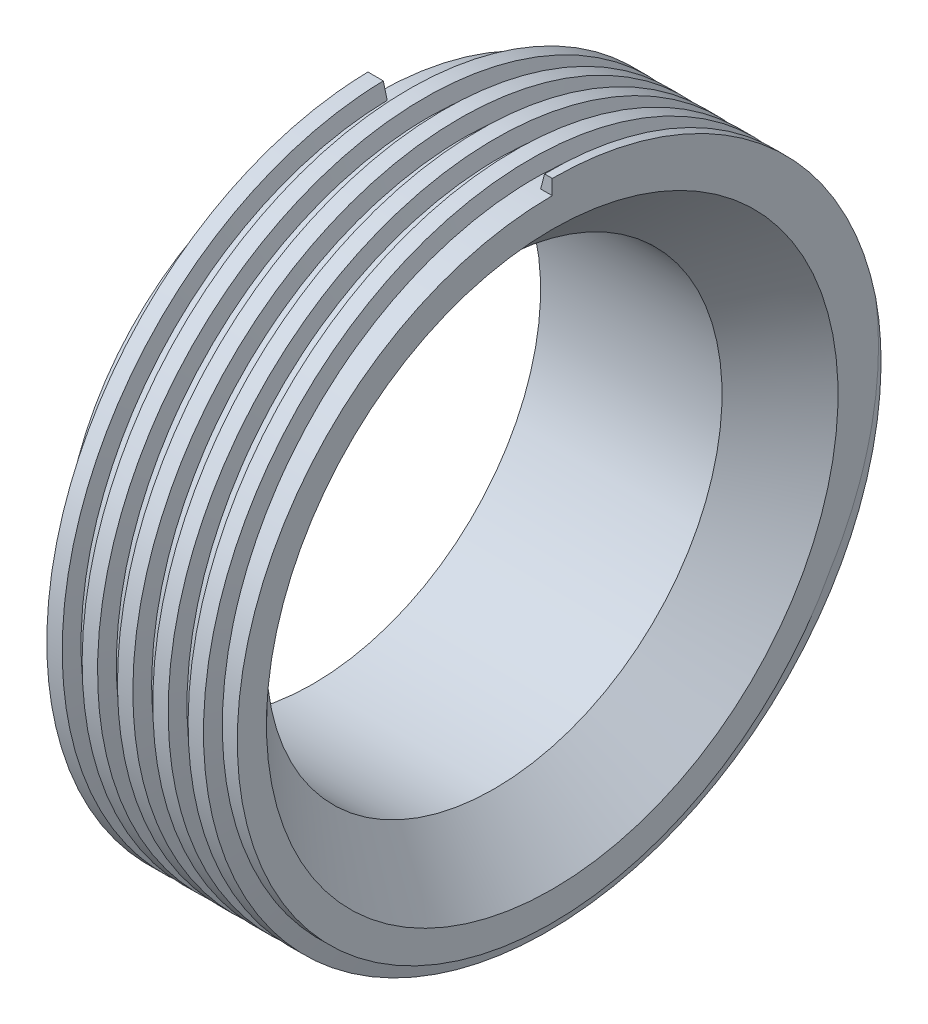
ISO-10303-21;
HEADER;
FILE_DESCRIPTION(('STEP AP214'),'2;1');
FILE_NAME('part.step','',(''),(''),'','','');
FILE_SCHEMA(('AUTOMOTIVE_DESIGN { 1 0 10303 214 1 1 1 1 }'));
ENDSEC;
DATA;
#1=APPLICATION_CONTEXT('core data for automotive mechanical design processes');
#2=APPLICATION_PROTOCOL_DEFINITION('international standard','automotive_design',2000,#1);
#3=PRODUCT_CONTEXT('',#1,'mechanical');
#4=PRODUCT('Part','Part','',(#3));
#5=PRODUCT_RELATED_PRODUCT_CATEGORY('part','',(#4));
#6=PRODUCT_DEFINITION_FORMATION('','',#4);
#7=PRODUCT_DEFINITION_CONTEXT('part definition',#1,'design');
#8=PRODUCT_DEFINITION('design','',#6,#7);
#9=PRODUCT_DEFINITION_SHAPE('','',#8);
#10=(LENGTH_UNIT() NAMED_UNIT(*) SI_UNIT(.MILLI.,.METRE.));
#11=(NAMED_UNIT(*) PLANE_ANGLE_UNIT() SI_UNIT($,.RADIAN.));
#12=(NAMED_UNIT(*) SI_UNIT($,.STERADIAN.) SOLID_ANGLE_UNIT());
#13=UNCERTAINTY_MEASURE_WITH_UNIT(LENGTH_MEASURE(1.E-05),#10,'distance_accuracy_value','');
#14=(GEOMETRIC_REPRESENTATION_CONTEXT(3) GLOBAL_UNCERTAINTY_ASSIGNED_CONTEXT((#13)) GLOBAL_UNIT_ASSIGNED_CONTEXT((#10,
#11,#12)) REPRESENTATION_CONTEXT('',''));
#15=CARTESIAN_POINT('',(0.,0.,0.));
#16=DIRECTION('',(0.,0.,1.));
#17=DIRECTION('',(1.,0.,0.));
#18=AXIS2_PLACEMENT_3D('',#15,#16,#17);
#19=CARTESIAN_POINT('',(4.80059999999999,22.225,0.));
#20=DIRECTION('',(-1.,0.,0.));
#21=DIRECTION('',(0.,-1.,0.));
#22=AXIS2_PLACEMENT_3D('',#19,#20,#21);
#23=PLANE('',#22);
#24=DIRECTION('',(0.,-0.999999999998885,1.49305677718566E-06));
#25=VECTOR('',#24,1.);
#26=CARTESIAN_POINT('',(4.80059999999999,22.2249999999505,-3.3183186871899E-05));
#27=LINE('',#26,#25);
#28=CARTESIAN_POINT('',(4.8006,24.0537999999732,-3.59136891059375E-05));
#29=VERTEX_POINT('',#28);
#30=CARTESIAN_POINT('',(4.80059999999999,23.3550587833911,-3.48704288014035E-05));
#31=VERTEX_POINT('',#30);
#32=EDGE_CURVE('E209',#29,#31,#27,.T.);
#33=ORIENTED_EDGE('',*,*,#32,.F.);
#34=CARTESIAN_POINT('',(4.8006,0.,0.));
#35=DIRECTION('',(1.,0.,0.));
#36=DIRECTION('',(0.,1.,0.));
#37=AXIS2_PLACEMENT_3D('',#34,#35,#36);
#38=CIRCLE('',#37,24.0538);
#39=CARTESIAN_POINT('',(4.8006,-11.3010533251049,21.2337346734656));
#40=VERTEX_POINT('',#39);
#41=EDGE_CURVE('E208',#40,#29,#38,.T.);
#42=ORIENTED_EDGE('',*,*,#41,.F.);
#43=CARTESIAN_POINT('',(4.80059999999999,-3.63975872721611,24.3424456));
#44=CARTESIAN_POINT('',(4.80059999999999,-3.96592036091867,24.2708366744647));
#45=CARTESIAN_POINT('',(4.80059999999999,-4.29062912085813,24.1926351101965));
#46=CARTESIAN_POINT('',(4.80059999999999,-4.93663207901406,24.0231889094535));
#47=CARTESIAN_POINT('',(4.80059999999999,-5.25792621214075,23.9319440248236));
#48=CARTESIAN_POINT('',(4.80059999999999,-5.89628336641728,23.7366464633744));
#49=CARTESIAN_POINT('',(4.80059999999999,-6.21335002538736,23.632605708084));
#50=CARTESIAN_POINT('',(4.80059999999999,-6.685589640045,23.4670200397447));
#51=CARTESIAN_POINT('',(4.80059999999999,-6.84244728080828,23.4102356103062));
#52=CARTESIAN_POINT('',(4.80059999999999,-7.15499196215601,23.2935251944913));
#53=CARTESIAN_POINT('',(4.8006,-7.31067900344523,23.2335992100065));
#54=CARTESIAN_POINT('',(4.8006,-7.6188575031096,23.1113479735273));
#55=CARTESIAN_POINT('',(4.80059999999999,-7.77136457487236,23.0490621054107));
#56=CARTESIAN_POINT('',(4.80059999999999,-8.07503949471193,22.9213138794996));
#57=CARTESIAN_POINT('',(4.80059999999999,-8.22620734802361,22.8558515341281));
#58=CARTESIAN_POINT('',(4.80059999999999,-8.67760495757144,22.6547876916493));
#59=CARTESIAN_POINT('',(4.80059999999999,-8.97576148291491,22.514496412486));
#60=CARTESIAN_POINT('',(4.80059999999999,-9.56629715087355,22.2214837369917));
#61=CARTESIAN_POINT('',(4.80059999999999,-9.85866974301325,22.0687491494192));
#62=CARTESIAN_POINT('',(4.80059999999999,-10.4368428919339,21.7512328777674));
#63=CARTESIAN_POINT('',(4.80059999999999,-10.7226422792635,21.5864490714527));
#64=CARTESIAN_POINT('',(4.80059999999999,-11.5764440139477,21.0701824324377));
#65=CARTESIAN_POINT('',(4.80059999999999,-12.133537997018,20.7004085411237));
#66=CARTESIAN_POINT('',(4.80059999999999,-13.2147864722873,19.9151058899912));
#67=CARTESIAN_POINT('',(4.80059999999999,-13.7389249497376,19.4995551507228));
#68=CARTESIAN_POINT('',(4.80059999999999,-14.7502791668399,18.6257982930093));
#69=CARTESIAN_POINT('',(4.80059999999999,-15.2374981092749,18.1675958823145));
#70=CARTESIAN_POINT('',(4.80059999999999,-16.1713498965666,17.2119852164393));
#71=CARTESIAN_POINT('',(4.80059999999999,-16.618006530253,16.7146002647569));
#72=CARTESIAN_POINT('',(4.80059999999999,-17.2832501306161,15.9078664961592));
#73=CARTESIAN_POINT('',(4.80059999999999,-17.5166693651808,15.6106252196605));
#74=CARTESIAN_POINT('',(4.80059999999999,-17.9685862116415,15.0060082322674));
#75=CARTESIAN_POINT('',(4.80059999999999,-18.1871149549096,14.6986557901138));
#76=CARTESIAN_POINT('',(4.80059999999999,-18.398229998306,14.3862400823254));
#77=B_SPLINE_CURVE_WITH_KNOTS('',3,(#43,#44,#45,#46,#47,#48,#49,#50,#51,#52,#53,#54,#55,#56,#57,
#58,#59,#60,#61,#62,#63,#64,#65,#66,#67,#68,#69,#70,#71,#72,#73,#74,#75,#76),.UNSPECIFIED.,.F.,
.F.,(4,2,2,2,2,2,2,2,2,2,2,2,2,2,2,2,4),(0.,1.00171156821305,2.00344219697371,3.00424651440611,
3.50467768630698,4.00510855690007,4.49928024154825,4.99344999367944,5.98168398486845,
6.97097959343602,7.96044986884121,9.96379609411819,11.9681084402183,13.9722467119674,
15.9752019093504,17.1086298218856,18.2396103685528),.UNSPECIFIED.);
#78=CARTESIAN_POINT('',(4.80059999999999,-18.3982299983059,14.3862400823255));
#79=VERTEX_POINT('',#78);
#80=EDGE_CURVE('E203',#40,#79,#77,.T.);
#81=ORIENTED_EDGE('',*,*,#80,.T.);
#82=CARTESIAN_POINT('',(4.80059999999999,-18.398229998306,14.3862400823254));
#83=CARTESIAN_POINT('',(4.80059999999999,-18.1786555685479,14.6670470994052));
#84=CARTESIAN_POINT('',(4.80059999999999,-17.9526859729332,14.9427846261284));
#85=CARTESIAN_POINT('',(4.80059999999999,-17.4883629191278,15.4836370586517));
#86=CARTESIAN_POINT('',(4.80059999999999,-17.2500092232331,15.748751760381));
#87=CARTESIAN_POINT('',(4.80059999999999,-16.5162619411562,16.5281986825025));
#88=CARTESIAN_POINT('',(4.80059999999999,-16.0028431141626,17.0257885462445));
#89=CARTESIAN_POINT('',(4.80059999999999,-14.9760691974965,17.9334073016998));
#90=CARTESIAN_POINT('',(4.80059999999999,-14.466078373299,18.3472640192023));
#91=CARTESIAN_POINT('',(4.80059999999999,-13.4128641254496,19.1307248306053));
#92=CARTESIAN_POINT('',(4.80059999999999,-12.8696301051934,19.500314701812));
#93=CARTESIAN_POINT('',(4.80059999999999,-11.7535888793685,20.1926591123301));
#94=CARTESIAN_POINT('',(4.80059999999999,-11.1807616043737,20.5153812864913));
#95=CARTESIAN_POINT('',(4.80059999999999,-10.0099918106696,21.111377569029));
#96=CARTESIAN_POINT('',(4.8006,-9.41205134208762,21.3846557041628));
#97=CARTESIAN_POINT('',(4.8006,-8.19545954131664,21.8797712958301));
#98=CARTESIAN_POINT('',(4.80059999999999,-7.57681477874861,22.1016248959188));
#99=CARTESIAN_POINT('',(4.80059999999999,-6.32302158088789,22.4924288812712));
#100=CARTESIAN_POINT('',(4.80059999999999,-5.68787281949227,22.661378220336));
#101=CARTESIAN_POINT('',(4.80059999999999,-4.40567893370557,22.9451486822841));
#102=CARTESIAN_POINT('',(4.80059999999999,-3.75863528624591,23.059976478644));
#103=CARTESIAN_POINT('',(4.80059999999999,-2.45717804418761,23.2347181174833));
#104=CARTESIAN_POINT('',(4.80059999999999,-1.80276448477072,23.2946322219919));
#105=CARTESIAN_POINT('',(4.80059999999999,-0.491173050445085,23.3591236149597));
#106=CARTESIAN_POINT('',(4.80059999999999,0.166005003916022,23.3636972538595));
#107=CARTESIAN_POINT('',(4.80059999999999,1.47841105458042,23.3174657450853));
#108=CARTESIAN_POINT('',(4.80059999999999,2.13363904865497,23.2666605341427));
#109=CARTESIAN_POINT('',(4.80059999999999,3.43747751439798,23.1100334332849));
#110=CARTESIAN_POINT('',(4.80059999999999,4.08608807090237,23.0042122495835));
#111=CARTESIAN_POINT('',(4.80059999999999,5.37208884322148,22.7383059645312));
#112=CARTESIAN_POINT('',(4.80059999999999,6.00947906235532,22.5782208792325));
#113=CARTESIAN_POINT('',(4.80059999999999,7.2684977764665,22.2049278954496));
#114=CARTESIAN_POINT('',(4.80059999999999,7.89012652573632,21.9917208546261));
#115=CARTESIAN_POINT('',(4.80059999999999,9.1132138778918,21.5136983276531));
#116=CARTESIAN_POINT('',(4.80059999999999,9.71467247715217,21.2488828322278));
#117=CARTESIAN_POINT('',(4.80059999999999,10.8931701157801,20.6695129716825));
#118=CARTESIAN_POINT('',(4.80059999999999,11.4702080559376,20.3549563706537));
#119=CARTESIAN_POINT('',(4.80059999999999,12.5957328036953,19.6783494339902));
#120=CARTESIAN_POINT('',(4.80059999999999,13.1442196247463,19.3162991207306));
#121=CARTESIAN_POINT('',(4.80059999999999,14.2087444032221,18.5472775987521));
#122=CARTESIAN_POINT('',(4.80059999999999,14.7247822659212,18.1403062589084));
#123=CARTESIAN_POINT('',(4.80059999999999,15.7207395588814,17.2843360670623));
#124=CARTESIAN_POINT('',(4.80059999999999,16.2006589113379,16.8353371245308));
#125=CARTESIAN_POINT('',(4.80059999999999,17.1209433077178,15.8985277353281));
#126=CARTESIAN_POINT('',(4.80059999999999,17.5613102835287,15.4107191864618));
#127=CARTESIAN_POINT('',(4.80059999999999,18.3993819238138,14.3997437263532));
#128=CARTESIAN_POINT('',(4.80059999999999,18.797086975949,13.8765771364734));
#129=CARTESIAN_POINT('',(4.80059999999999,19.5470508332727,12.7985457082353));
#130=CARTESIAN_POINT('',(4.80059999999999,19.8993049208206,12.2436775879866));
#131=CARTESIAN_POINT('',(4.80059999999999,20.5558264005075,11.1062139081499));
#132=CARTESIAN_POINT('',(4.80059999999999,20.8600920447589,10.5236173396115));
#133=CARTESIAN_POINT('',(4.80059999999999,21.4184187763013,9.33494771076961));
#134=CARTESIAN_POINT('',(4.80059999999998,21.6724863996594,8.72887771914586));
#135=CARTESIAN_POINT('',(4.80059999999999,22.1286371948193,7.49754070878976));
#136=CARTESIAN_POINT('',(4.8006,22.3307276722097,6.87227640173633));
#137=CARTESIAN_POINT('',(4.8006,22.6468178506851,5.73217847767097));
#138=CARTESIAN_POINT('',(4.80059999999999,22.7703347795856,5.2199588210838));
#139=CARTESIAN_POINT('',(4.80059999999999,22.9824571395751,4.18839463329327));
#140=CARTESIAN_POINT('',(4.80059999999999,23.0710675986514,3.66905113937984));
#141=CARTESIAN_POINT('',(4.80059999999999,23.2129202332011,2.62599086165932));
#142=CARTESIAN_POINT('',(4.80059999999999,23.2661909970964,2.10227796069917));
#143=CARTESIAN_POINT('',(4.80059999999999,23.3372777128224,1.0523674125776));
#144=CARTESIAN_POINT('',(4.80059999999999,23.355087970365,0.526169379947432));
#145=CARTESIAN_POINT('',(4.80059999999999,23.3550587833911,-3.48704288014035E-05));
#146=B_SPLINE_CURVE_WITH_KNOTS('',3,(#82,#83,#84,#85,#86,#87,#88,#89,#90,#91,#92,#93,#94,#95,
#96,#97,#98,#99,#100,#101,#102,#103,#104,#105,#106,#107,#108,#109,#110,#111,#112,#113,#114,#115,
#116,#117,#118,#119,#120,#121,#122,#123,#124,#125,#126,#127,#128,#129,#130,#131,#132,#133,#134,
#135,#136,#137,#138,#139,#140,#141,#142,#143,#144,#145),.UNSPECIFIED.,.F.,.F.,(4,2,2,2,2,2,2,2,
2,2,2,2,2,2,2,2,2,2,2,2,2,2,2,2,2,2,2,2,2,2,2,4),(0.,1.06918573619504,2.13839200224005,
4.28001121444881,6.24813640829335,8.21689226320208,10.1870012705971,12.1569497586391,
14.1262789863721,16.0956471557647,18.0647724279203,20.0338883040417,22.003134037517,
23.9723820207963,25.9416047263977,27.9108268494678,29.8800171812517,31.8492078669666,
33.818487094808,35.7877653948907,37.7570494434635,39.7263377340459,41.6955297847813,
43.6647039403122,45.6340823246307,47.6035324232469,49.5727259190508,51.5416424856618,
53.1211967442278,54.7005233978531,56.2785708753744,57.8568717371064),.UNSPECIFIED.);
#147=EDGE_CURVE('E130',#79,#31,#146,.T.);
#148=ORIENTED_EDGE('',*,*,#147,.T.);
#149=EDGE_LOOP('',(#33,#42,#81,#148));
#150=FACE_BOUND('',#149,.T.);
#151=CARTESIAN_POINT('',(4.80059999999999,0.,0.));
#152=DIRECTION('',(1.,0.,0.));
#153=DIRECTION('',(0.,1.,0.));
#154=AXIS2_PLACEMENT_3D('',#151,#152,#153);
#155=CIRCLE('',#154,22.225);
#156=CARTESIAN_POINT('',(4.80059999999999,22.225,0.));
#157=VERTEX_POINT('',#156);
#158=EDGE_CURVE('E214',#157,#157,#155,.T.);
#159=ORIENTED_EDGE('',*,*,#158,.T.);
#160=EDGE_LOOP('',(#159));
#161=FACE_BOUND('',#160,.T.);
#162=ADVANCED_FACE('F45',(#150,#161),#23,.T.);
#163=CARTESIAN_POINT('',(0.,0.,0.));
#164=DIRECTION('',(-1.,0.,0.));
#165=DIRECTION('',(0.,-1.,0.));
#166=AXIS2_PLACEMENT_3D('',#163,#164,#165);
#167=PLANE('',#166);
#168=CARTESIAN_POINT('',(0.,0.,0.));
#169=DIRECTION('',(-1.,0.,0.));
#170=DIRECTION('',(0.,-1.,0.));
#171=AXIS2_PLACEMENT_3D('',#168,#169,#170);
#172=CIRCLE('',#171,17.399);
#173=CARTESIAN_POINT('',(0.,-17.399,0.));
#174=VERTEX_POINT('',#173);
#175=EDGE_CURVE('E187',#174,#174,#172,.T.);
#176=ORIENTED_EDGE('',*,*,#175,.F.);
#177=EDGE_LOOP('',(#176));
#178=FACE_BOUND('',#177,.T.);
#179=CARTESIAN_POINT('',(0.,0.,0.));
#180=DIRECTION('',(1.,0.,0.));
#181=DIRECTION('',(0.,1.,0.));
#182=AXIS2_PLACEMENT_3D('',#179,#180,#181);
#183=CIRCLE('',#182,19.05);
#184=CARTESIAN_POINT('',(0.,19.05,0.));
#185=VERTEX_POINT('',#184);
#186=EDGE_CURVE('E220',#185,#185,#183,.T.);
#187=ORIENTED_EDGE('',*,*,#186,.F.);
#188=EDGE_LOOP('',(#187));
#189=FACE_BOUND('',#188,.T.);
#190=ADVANCED_FACE('F282',(#178,#189),#167,.T.);
#191=CARTESIAN_POINT('',(18.288,0.,0.));
#192=DIRECTION('',(1.,0.,0.));
#193=DIRECTION('',(0.,1.,0.));
#194=AXIS2_PLACEMENT_3D('',#191,#192,#193);
#195=CYLINDRICAL_SURFACE('',#194,19.05);
#196=ORIENTED_EDGE('',*,*,#186,.T.);
#197=EDGE_LOOP('',(#196));
#198=FACE_BOUND('',#197,.T.);
#199=CARTESIAN_POINT('',(1.62559999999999,0.,0.));
#200=DIRECTION('',(1.,0.,0.));
#201=DIRECTION('',(0.,1.,0.));
#202=AXIS2_PLACEMENT_3D('',#199,#200,#201);
#203=CIRCLE('',#202,19.05);
#204=CARTESIAN_POINT('',(1.62559999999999,19.05,0.));
#205=VERTEX_POINT('',#204);
#206=EDGE_CURVE('E217',#205,#205,#203,.T.);
#207=ORIENTED_EDGE('',*,*,#206,.F.);
#208=EDGE_LOOP('',(#207));
#209=FACE_BOUND('',#208,.T.);
#210=ADVANCED_FACE('F286',(#198,#209),#195,.T.);
#211=CARTESIAN_POINT('',(1.62559999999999,0.,0.));
#212=DIRECTION('',(1.,0.,0.));
#213=DIRECTION('',(0.,1.,0.));
#214=AXIS2_PLACEMENT_3D('',#211,#212,#213);
#215=TOROIDAL_SURFACE('',#214,22.225,3.175);
#216=ORIENTED_EDGE('',*,*,#206,.T.);
#217=EDGE_LOOP('',(#216));
#218=FACE_BOUND('',#217,.T.);
#219=ORIENTED_EDGE('',*,*,#158,.F.);
#220=EDGE_LOOP('',(#219));
#221=FACE_BOUND('',#220,.T.);
#222=ADVANCED_FACE('F291',(#218,#221),#215,.F.);
#223=CARTESIAN_POINT('',(4.8006,0.,0.));
#224=DIRECTION('',(1.,0.,0.));
#225=DIRECTION('',(0.,1.,0.));
#226=AXIS2_PLACEMENT_3D('',#223,#224,#225);
#227=CYLINDRICAL_SURFACE('',#226,24.0538);
#228=DIRECTION('',(1.,0.,0.));
#229=VECTOR('',#228,1.);
#230=CARTESIAN_POINT('',(4.8006,24.0537999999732,-3.59136891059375E-05));
#231=LINE('',#230,#229);
#232=CARTESIAN_POINT('',(5.68414751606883,24.0537999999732,-3.59136891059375E-05));
#233=VERTEX_POINT('',#232);
#234=EDGE_CURVE('E68',#233,#29,#231,.F.);
#235=ORIENTED_EDGE('',*,*,#234,.F.);
#236=CARTESIAN_POINT('',(19.1715475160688,24.0537999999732,-3.59136891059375E-05));
#237=CARTESIAN_POINT('',(19.0366735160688,24.0537883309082,-7.81558930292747));
#238=CARTESIAN_POINT('',(18.9017995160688,19.4599118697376,-14.1384979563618));
#239=CARTESIAN_POINT('',(18.7669255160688,14.866035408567,-20.461406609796));
#240=CARTESIAN_POINT('',(18.6320515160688,7.43299882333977,-22.8765343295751));
#241=CARTESIAN_POINT('',(18.4971775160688,-3.77618874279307E-05,-25.2916620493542));
#242=CARTESIAN_POINT('',(18.3623035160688,-7.43306713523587,-22.8765121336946));
#243=CARTESIAN_POINT('',(18.2274295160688,-14.8660965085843,-20.461362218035));
#244=CARTESIAN_POINT('',(18.0925555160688,-19.4599540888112,-14.1384398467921));
#245=CARTESIAN_POINT('',(17.9576815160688,-24.0538116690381,-7.81551747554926));
#246=CARTESIAN_POINT('',(17.8228075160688,-24.0537999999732,3.59136891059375E-05));
#247=CARTESIAN_POINT('',(17.6879335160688,-24.0537883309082,7.81558930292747));
#248=CARTESIAN_POINT('',(17.5530595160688,-19.4599118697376,14.1384979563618));
#249=CARTESIAN_POINT('',(17.4181855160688,-14.866035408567,20.461406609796));
#250=CARTESIAN_POINT('',(17.2833115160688,-7.43299882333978,22.8765343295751));
#251=CARTESIAN_POINT('',(17.1484375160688,3.77618874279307E-05,25.2916620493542));
#252=CARTESIAN_POINT('',(17.0135635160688,7.43306713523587,22.8765121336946));
#253=CARTESIAN_POINT('',(16.8786895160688,14.8660965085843,20.461362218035));
#254=CARTESIAN_POINT('',(16.7438155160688,19.4599540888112,14.1384398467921));
#255=CARTESIAN_POINT('',(16.6089415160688,24.0538116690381,7.81551747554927));
#256=CARTESIAN_POINT('',(16.4740675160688,24.0537999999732,-3.59136891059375E-05));
#257=CARTESIAN_POINT('',(16.3391935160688,24.0537883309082,-7.81558930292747));
#258=CARTESIAN_POINT('',(16.2043195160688,19.4599118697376,-14.1384979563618));
#259=CARTESIAN_POINT('',(16.0694455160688,14.866035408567,-20.461406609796));
#260=CARTESIAN_POINT('',(15.9345715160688,7.43299882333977,-22.8765343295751));
#261=CARTESIAN_POINT('',(15.7996975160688,-3.77618874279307E-05,-25.2916620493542));
#262=CARTESIAN_POINT('',(15.6648235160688,-7.43306713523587,-22.8765121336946));
#263=CARTESIAN_POINT('',(15.5299495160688,-14.8660965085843,-20.461362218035));
#264=CARTESIAN_POINT('',(15.3950755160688,-19.4599540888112,-14.1384398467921));
#265=CARTESIAN_POINT('',(15.2602015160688,-24.0538116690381,-7.81551747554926));
#266=CARTESIAN_POINT('',(15.1253275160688,-24.0537999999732,3.59136891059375E-05));
#267=CARTESIAN_POINT('',(14.9904535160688,-24.0537883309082,7.81558930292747));
#268=CARTESIAN_POINT('',(14.8555795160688,-19.4599118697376,14.1384979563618));
#269=CARTESIAN_POINT('',(14.7207055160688,-14.866035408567,20.461406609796));
#270=CARTESIAN_POINT('',(14.5858315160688,-7.43299882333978,22.8765343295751));
#271=CARTESIAN_POINT('',(14.4509575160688,3.77618874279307E-05,25.2916620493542));
#272=CARTESIAN_POINT('',(14.3160835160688,7.43306713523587,22.8765121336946));
#273=CARTESIAN_POINT('',(14.1812095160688,14.8660965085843,20.461362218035));
#274=CARTESIAN_POINT('',(14.0463355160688,19.4599540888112,14.1384398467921));
#275=CARTESIAN_POINT('',(13.9114615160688,24.0538116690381,7.81551747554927));
#276=CARTESIAN_POINT('',(13.7765875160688,24.0537999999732,-3.59136891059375E-05));
#277=CARTESIAN_POINT('',(13.6417135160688,24.0537883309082,-7.81558930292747));
#278=CARTESIAN_POINT('',(13.5068395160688,19.4599118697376,-14.1384979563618));
#279=CARTESIAN_POINT('',(13.3719655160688,14.866035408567,-20.461406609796));
#280=CARTESIAN_POINT('',(13.2370915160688,7.43299882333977,-22.8765343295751));
#281=CARTESIAN_POINT('',(13.1022175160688,-3.77618874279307E-05,-25.2916620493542));
#282=CARTESIAN_POINT('',(12.9673435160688,-7.43306713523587,-22.8765121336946));
#283=CARTESIAN_POINT('',(12.8324695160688,-14.8660965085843,-20.461362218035));
#284=CARTESIAN_POINT('',(12.6975955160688,-19.4599540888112,-14.1384398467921));
#285=CARTESIAN_POINT('',(12.5627215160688,-24.0538116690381,-7.81551747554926));
#286=CARTESIAN_POINT('',(12.4278475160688,-24.0537999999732,3.59136891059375E-05));
#287=CARTESIAN_POINT('',(12.2929735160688,-24.0537883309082,7.81558930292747));
#288=CARTESIAN_POINT('',(12.1580995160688,-19.4599118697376,14.1384979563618));
#289=CARTESIAN_POINT('',(12.0232255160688,-14.866035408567,20.461406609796));
#290=CARTESIAN_POINT('',(11.8883515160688,-7.43299882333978,22.8765343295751));
#291=CARTESIAN_POINT('',(11.7534775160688,3.77618874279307E-05,25.2916620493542));
#292=CARTESIAN_POINT('',(11.6186035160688,7.43306713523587,22.8765121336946));
#293=CARTESIAN_POINT('',(11.4837295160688,14.8660965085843,20.461362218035));
#294=CARTESIAN_POINT('',(11.3488555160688,19.4599540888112,14.1384398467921));
#295=CARTESIAN_POINT('',(11.2139815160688,24.0538116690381,7.81551747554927));
#296=CARTESIAN_POINT('',(11.0791075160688,24.0537999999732,-3.59136891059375E-05));
#297=CARTESIAN_POINT('',(10.9442335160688,24.0537883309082,-7.81558930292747));
#298=CARTESIAN_POINT('',(10.8093595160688,19.4599118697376,-14.1384979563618));
#299=CARTESIAN_POINT('',(10.6744855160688,14.866035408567,-20.461406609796));
#300=CARTESIAN_POINT('',(10.5396115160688,7.43299882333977,-22.8765343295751));
#301=CARTESIAN_POINT('',(10.4047375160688,-3.77618874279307E-05,-25.2916620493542));
#302=CARTESIAN_POINT('',(10.2698635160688,-7.43306713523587,-22.8765121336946));
#303=CARTESIAN_POINT('',(10.1349895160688,-14.8660965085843,-20.461362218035));
#304=CARTESIAN_POINT('',(10.0001155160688,-19.4599540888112,-14.1384398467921));
#305=CARTESIAN_POINT('',(9.86524151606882,-24.0538116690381,-7.81551747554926));
#306=CARTESIAN_POINT('',(9.73036751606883,-24.0537999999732,3.59136891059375E-05));
#307=CARTESIAN_POINT('',(9.59549351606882,-24.0537883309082,7.81558930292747));
#308=CARTESIAN_POINT('',(9.46061951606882,-19.4599118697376,14.1384979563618));
#309=CARTESIAN_POINT('',(9.32574551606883,-14.866035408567,20.461406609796));
#310=CARTESIAN_POINT('',(9.19087151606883,-7.43299882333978,22.8765343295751));
#311=CARTESIAN_POINT('',(9.05599751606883,3.77618874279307E-05,25.2916620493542));
#312=CARTESIAN_POINT('',(8.92112351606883,7.43306713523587,22.8765121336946));
#313=CARTESIAN_POINT('',(8.78624951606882,14.8660965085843,20.461362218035));
#314=CARTESIAN_POINT('',(8.65137551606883,19.4599540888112,14.1384398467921));
#315=CARTESIAN_POINT('',(8.51650151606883,24.0538116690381,7.81551747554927));
#316=CARTESIAN_POINT('',(8.38162751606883,24.0537999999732,-3.59136891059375E-05));
#317=CARTESIAN_POINT('',(8.24675351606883,24.0537883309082,-7.81558930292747));
#318=CARTESIAN_POINT('',(8.11187951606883,19.4599118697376,-14.1384979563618));
#319=CARTESIAN_POINT('',(7.97700551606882,14.866035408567,-20.461406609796));
#320=CARTESIAN_POINT('',(7.84213151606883,7.43299882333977,-22.8765343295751));
#321=CARTESIAN_POINT('',(7.70725751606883,-3.77618874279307E-05,-25.2916620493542));
#322=CARTESIAN_POINT('',(7.57238351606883,-7.43306713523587,-22.8765121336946));
#323=CARTESIAN_POINT('',(7.43750951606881,-14.8660965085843,-20.461362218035));
#324=CARTESIAN_POINT('',(7.30263551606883,-19.4599540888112,-14.1384398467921));
#325=CARTESIAN_POINT('',(7.16776151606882,-24.0538116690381,-7.81551747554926));
#326=CARTESIAN_POINT('',(7.03288751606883,-24.0537999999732,3.59136891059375E-05));
#327=CARTESIAN_POINT('',(6.89801351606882,-24.0537883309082,7.81558930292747));
#328=CARTESIAN_POINT('',(6.76313951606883,-19.4599118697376,14.1384979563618));
#329=CARTESIAN_POINT('',(6.62826551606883,-14.866035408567,20.461406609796));
#330=CARTESIAN_POINT('',(6.49339151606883,-7.43299882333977,22.8765343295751));
#331=CARTESIAN_POINT('',(6.35851751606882,3.77618874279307E-05,25.2916620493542));
#332=CARTESIAN_POINT('',(6.22364351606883,7.43306713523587,22.8765121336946));
#333=CARTESIAN_POINT('',(6.08876951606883,14.8660965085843,20.461362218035));
#334=CARTESIAN_POINT('',(5.95389551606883,19.4599540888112,14.1384398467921));
#335=CARTESIAN_POINT('',(5.81902151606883,24.0538116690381,7.81551747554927));
#336=CARTESIAN_POINT('',(5.68414751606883,24.0537999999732,-3.59136891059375E-05));
#337=(BOUNDED_CURVE() B_SPLINE_CURVE(2,(#236,#237,#238,#239,#240,#241,#242,#243,#244,#245,#246,
#247,#248,#249,#250,#251,#252,#253,#254,#255,#256,#257,#258,#259,#260,#261,#262,#263,#264,#265,
#266,#267,#268,#269,#270,#271,#272,#273,#274,#275,#276,#277,#278,#279,#280,#281,#282,#283,#284,
#285,#286,#287,#288,#289,#290,#291,#292,#293,#294,#295,#296,#297,#298,#299,#300,#301,#302,#303,
#304,#305,#306,#307,#308,#309,#310,#311,#312,#313,#314,#315,#316,#317,#318,#319,#320,#321,#322,
#323,#324,#325,#326,#327,#328,#329,#330,#331,#332,#333,#334,#335,#336),.UNSPECIFIED.,.F.,
.F.) B_SPLINE_CURVE_WITH_KNOTS((3,2,2,2,2,2,2,2,2,2,2,2,2,2,2,2,2,2,2,2,2,2,2,2,2,2,2,2,2,2,2,2,
2,2,2,2,2,2,2,2,2,2,2,2,2,2,2,2,2,2,3),(0.,0.02,0.04,0.06,0.08,0.1,0.12,0.14,0.16,0.18,0.2,0.22,
0.24,0.26,0.28,0.3,0.32,0.34,0.36,0.38,0.4,0.42,0.44,0.46,0.48,0.5,0.52,0.54,0.56,0.58,0.6,0.62,
0.64,0.66,0.68,0.7,0.72,0.74,0.76,0.78,0.8,0.82,0.84,0.86,0.88,0.9,0.92,0.94,0.96,0.98,1.),
.UNSPECIFIED.) CURVE() GEOMETRIC_REPRESENTATION_ITEM() RATIONAL_B_SPLINE_CURVE((1.,
0.951056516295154,1.,0.951056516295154,1.,0.951056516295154,1.,0.951056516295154,1.,
0.951056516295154,1.,0.951056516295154,1.,0.951056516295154,1.,0.951056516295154,1.,
0.951056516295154,1.,0.951056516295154,1.,0.951056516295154,1.,0.951056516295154,1.,
0.951056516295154,1.,0.951056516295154,1.,0.951056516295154,1.,0.951056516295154,1.,
0.951056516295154,1.,0.951056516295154,1.,0.951056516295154,1.,0.951056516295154,1.,
0.951056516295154,1.,0.951056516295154,1.,0.951056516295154,1.,0.951056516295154,1.,
0.951056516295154,1.,0.951056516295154,1.,0.951056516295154,1.,0.951056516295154,1.,
0.951056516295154,1.,0.951056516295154,1.,0.951056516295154,1.,0.951056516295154,1.,
0.951056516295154,1.,0.951056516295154,1.,0.951056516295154,1.,0.951056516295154,1.,
0.951056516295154,1.,0.951056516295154,1.,0.951056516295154,1.,0.951056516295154,1.,
0.951056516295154,1.,0.951056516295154,1.,0.951056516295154,1.,0.951056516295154,1.,
0.951056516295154,1.,0.951056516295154,1.,0.951056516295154,1.,0.951056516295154,1.,
0.951056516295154,1.,0.951056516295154,1.)) REPRESENTATION_ITEM(''));
#338=CARTESIAN_POINT('',(18.288,-11.3011167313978,-21.2337009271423));
#339=VERTEX_POINT('',#338);
#340=EDGE_CURVE('E138',#233,#339,#337,.F.);
#341=ORIENTED_EDGE('',*,*,#340,.T.);
#342=CARTESIAN_POINT('',(18.288,0.,0.));
#343=DIRECTION('',(1.,0.,0.));
#344=DIRECTION('',(0.,1.,0.));
#345=AXIS2_PLACEMENT_3D('',#342,#343,#344);
#346=CIRCLE('',#345,24.0538);
#347=CARTESIAN_POINT('',(18.288,24.0537999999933,-1.79568445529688E-05));
#348=VERTEX_POINT('',#347);
#349=EDGE_CURVE('E206',#348,#339,#346,.T.);
#350=ORIENTED_EDGE('',*,*,#349,.F.);
#351=DIRECTION('',(1.,0.,0.));
#352=VECTOR('',#351,1.);
#353=CARTESIAN_POINT('',(4.8006,24.0537999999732,-3.59136891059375E-05));
#354=LINE('',#353,#352);
#355=CARTESIAN_POINT('',(17.4044524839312,24.0537999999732,-3.59136891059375E-05));
#356=VERTEX_POINT('',#355);
#357=EDGE_CURVE('E118',#356,#348,#354,.T.);
#358=ORIENTED_EDGE('',*,*,#357,.F.);
#359=CARTESIAN_POINT('',(17.4044524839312,24.0537999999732,-3.59136891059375E-05));
#360=CARTESIAN_POINT('',(17.2695784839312,24.0537883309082,-7.81558930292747));
#361=CARTESIAN_POINT('',(17.1347044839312,19.4599118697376,-14.1384979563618));
#362=CARTESIAN_POINT('',(16.9998304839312,14.866035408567,-20.461406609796));
#363=CARTESIAN_POINT('',(16.8649564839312,7.43299882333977,-22.8765343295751));
#364=CARTESIAN_POINT('',(16.7300824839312,-3.77618874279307E-05,-25.2916620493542));
#365=CARTESIAN_POINT('',(16.5952084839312,-7.43306713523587,-22.8765121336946));
#366=CARTESIAN_POINT('',(16.4603344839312,-14.8660965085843,-20.461362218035));
#367=CARTESIAN_POINT('',(16.3254604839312,-19.4599540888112,-14.1384398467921));
#368=CARTESIAN_POINT('',(16.1905864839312,-24.0538116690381,-7.81551747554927));
#369=CARTESIAN_POINT('',(16.0557124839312,-24.0537999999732,3.59136891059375E-05));
#370=CARTESIAN_POINT('',(15.9208384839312,-24.0537883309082,7.81558930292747));
#371=CARTESIAN_POINT('',(15.7859644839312,-19.4599118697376,14.1384979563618));
#372=CARTESIAN_POINT('',(15.6510904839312,-14.866035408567,20.461406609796));
#373=CARTESIAN_POINT('',(15.5162164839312,-7.43299882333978,22.8765343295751));
#374=CARTESIAN_POINT('',(15.3813424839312,3.77618874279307E-05,25.2916620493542));
#375=CARTESIAN_POINT('',(15.2464684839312,7.43306713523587,22.8765121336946));
#376=CARTESIAN_POINT('',(15.1115944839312,14.8660965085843,20.461362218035));
#377=CARTESIAN_POINT('',(14.9767204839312,19.4599540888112,14.1384398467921));
#378=CARTESIAN_POINT('',(14.8418464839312,24.0538116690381,7.81551747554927));
#379=CARTESIAN_POINT('',(14.7069724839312,24.0537999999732,-3.59136891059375E-05));
#380=CARTESIAN_POINT('',(14.5720984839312,24.0537883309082,-7.81558930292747));
#381=CARTESIAN_POINT('',(14.4372244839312,19.4599118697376,-14.1384979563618));
#382=CARTESIAN_POINT('',(14.3023504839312,14.866035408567,-20.461406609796));
#383=CARTESIAN_POINT('',(14.1674764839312,7.43299882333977,-22.8765343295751));
#384=CARTESIAN_POINT('',(14.0326024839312,-3.77618874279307E-05,-25.2916620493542));
#385=CARTESIAN_POINT('',(13.8977284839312,-7.43306713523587,-22.8765121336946));
#386=CARTESIAN_POINT('',(13.7628544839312,-14.8660965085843,-20.461362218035));
#387=CARTESIAN_POINT('',(13.6279804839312,-19.4599540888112,-14.1384398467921));
#388=CARTESIAN_POINT('',(13.4931064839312,-24.0538116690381,-7.81551747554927));
#389=CARTESIAN_POINT('',(13.3582324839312,-24.0537999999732,3.59136891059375E-05));
#390=CARTESIAN_POINT('',(13.2233584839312,-24.0537883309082,7.81558930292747));
#391=CARTESIAN_POINT('',(13.0884844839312,-19.4599118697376,14.1384979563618));
#392=CARTESIAN_POINT('',(12.9536104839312,-14.866035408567,20.461406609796));
#393=CARTESIAN_POINT('',(12.8187364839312,-7.43299882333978,22.8765343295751));
#394=CARTESIAN_POINT('',(12.6838624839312,3.77618874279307E-05,25.2916620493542));
#395=CARTESIAN_POINT('',(12.5489884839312,7.43306713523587,22.8765121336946));
#396=CARTESIAN_POINT('',(12.4141144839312,14.8660965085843,20.461362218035));
#397=CARTESIAN_POINT('',(12.2792404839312,19.4599540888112,14.1384398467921));
#398=CARTESIAN_POINT('',(12.1443664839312,24.0538116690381,7.81551747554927));
#399=CARTESIAN_POINT('',(12.0094924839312,24.0537999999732,-3.59136891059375E-05));
#400=CARTESIAN_POINT('',(11.8746184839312,24.0537883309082,-7.81558930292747));
#401=CARTESIAN_POINT('',(11.7397444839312,19.4599118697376,-14.1384979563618));
#402=CARTESIAN_POINT('',(11.6048704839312,14.866035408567,-20.461406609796));
#403=CARTESIAN_POINT('',(11.4699964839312,7.43299882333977,-22.8765343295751));
#404=CARTESIAN_POINT('',(11.3351224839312,-3.77618874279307E-05,-25.2916620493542));
#405=CARTESIAN_POINT('',(11.2002484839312,-7.43306713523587,-22.8765121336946));
#406=CARTESIAN_POINT('',(11.0653744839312,-14.8660965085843,-20.461362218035));
#407=CARTESIAN_POINT('',(10.9305004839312,-19.4599540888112,-14.1384398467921));
#408=CARTESIAN_POINT('',(10.7956264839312,-24.0538116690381,-7.81551747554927));
#409=CARTESIAN_POINT('',(10.6607524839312,-24.0537999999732,3.59136891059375E-05));
#410=CARTESIAN_POINT('',(10.5258784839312,-24.0537883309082,7.81558930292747));
#411=CARTESIAN_POINT('',(10.3910044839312,-19.4599118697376,14.1384979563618));
#412=CARTESIAN_POINT('',(10.2561304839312,-14.866035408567,20.461406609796));
#413=CARTESIAN_POINT('',(10.1212564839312,-7.43299882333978,22.8765343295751));
#414=CARTESIAN_POINT('',(9.98638248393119,3.77618874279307E-05,25.2916620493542));
#415=CARTESIAN_POINT('',(9.85150848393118,7.43306713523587,22.8765121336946));
#416=CARTESIAN_POINT('',(9.71663448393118,14.8660965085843,20.461362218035));
#417=CARTESIAN_POINT('',(9.58176048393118,19.4599540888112,14.1384398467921));
#418=CARTESIAN_POINT('',(9.44688648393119,24.0538116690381,7.81551747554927));
#419=CARTESIAN_POINT('',(9.31201248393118,24.0537999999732,-3.59136891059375E-05));
#420=CARTESIAN_POINT('',(9.17713848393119,24.0537883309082,-7.81558930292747));
#421=CARTESIAN_POINT('',(9.04226448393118,19.4599118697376,-14.1384979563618));
#422=CARTESIAN_POINT('',(8.90739048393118,14.866035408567,-20.461406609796));
#423=CARTESIAN_POINT('',(8.77251648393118,7.43299882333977,-22.8765343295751));
#424=CARTESIAN_POINT('',(8.63764248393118,-3.77618874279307E-05,-25.2916620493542));
#425=CARTESIAN_POINT('',(8.50276848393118,-7.43306713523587,-22.8765121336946));
#426=CARTESIAN_POINT('',(8.36789448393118,-14.8660965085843,-20.461362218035));
#427=CARTESIAN_POINT('',(8.23302048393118,-19.4599540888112,-14.1384398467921));
#428=CARTESIAN_POINT('',(8.09814648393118,-24.0538116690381,-7.81551747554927));
#429=CARTESIAN_POINT('',(7.96327248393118,-24.0537999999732,3.59136891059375E-05));
#430=CARTESIAN_POINT('',(7.82839848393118,-24.0537883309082,7.81558930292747));
#431=CARTESIAN_POINT('',(7.69352448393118,-19.4599118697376,14.1384979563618));
#432=CARTESIAN_POINT('',(7.55865048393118,-14.866035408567,20.461406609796));
#433=CARTESIAN_POINT('',(7.42377648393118,-7.43299882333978,22.8765343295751));
#434=CARTESIAN_POINT('',(7.28890248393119,3.77618874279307E-05,25.2916620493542));
#435=CARTESIAN_POINT('',(7.15402848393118,7.43306713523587,22.8765121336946));
#436=CARTESIAN_POINT('',(7.01915448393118,14.8660965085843,20.461362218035));
#437=CARTESIAN_POINT('',(6.88428048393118,19.4599540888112,14.1384398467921));
#438=CARTESIAN_POINT('',(6.74940648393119,24.0538116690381,7.81551747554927));
#439=CARTESIAN_POINT('',(6.61453248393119,24.0537999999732,-3.59136891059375E-05));
#440=CARTESIAN_POINT('',(6.47965848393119,24.0537883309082,-7.81558930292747));
#441=CARTESIAN_POINT('',(6.34478448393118,19.4599118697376,-14.1384979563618));
#442=CARTESIAN_POINT('',(6.20991048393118,14.866035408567,-20.461406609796));
#443=CARTESIAN_POINT('',(6.07503648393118,7.43299882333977,-22.8765343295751));
#444=CARTESIAN_POINT('',(5.94016248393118,-3.77618874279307E-05,-25.2916620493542));
#445=CARTESIAN_POINT('',(5.80528848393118,-7.43306713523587,-22.8765121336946));
#446=CARTESIAN_POINT('',(5.67041448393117,-14.8660965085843,-20.461362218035));
#447=CARTESIAN_POINT('',(5.53554048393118,-19.4599540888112,-14.1384398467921));
#448=CARTESIAN_POINT('',(5.40066648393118,-24.0538116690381,-7.81551747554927));
#449=CARTESIAN_POINT('',(5.26579248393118,-24.0537999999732,3.59136891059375E-05));
#450=CARTESIAN_POINT('',(5.13091848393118,-24.0537883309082,7.81558930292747));
#451=CARTESIAN_POINT('',(4.99604448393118,-19.4599118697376,14.1384979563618));
#452=CARTESIAN_POINT('',(4.86117048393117,-14.866035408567,20.461406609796));
#453=CARTESIAN_POINT('',(4.72629648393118,-7.43299882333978,22.8765343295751));
#454=CARTESIAN_POINT('',(4.59142248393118,3.77618874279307E-05,25.2916620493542));
#455=CARTESIAN_POINT('',(4.45654848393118,7.43306713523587,22.8765121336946));
#456=CARTESIAN_POINT('',(4.32167448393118,14.8660965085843,20.461362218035));
#457=CARTESIAN_POINT('',(4.18680048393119,19.4599540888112,14.1384398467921));
#458=CARTESIAN_POINT('',(4.05192648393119,24.0538116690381,7.81551747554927));
#459=CARTESIAN_POINT('',(3.91705248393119,24.0537999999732,-3.59136891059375E-05));
#460=(BOUNDED_CURVE() B_SPLINE_CURVE(2,(#359,#360,#361,#362,#363,#364,#365,#366,#367,#368,#369,
#370,#371,#372,#373,#374,#375,#376,#377,#378,#379,#380,#381,#382,#383,#384,#385,#386,#387,#388,
#389,#390,#391,#392,#393,#394,#395,#396,#397,#398,#399,#400,#401,#402,#403,#404,#405,#406,#407,
#408,#409,#410,#411,#412,#413,#414,#415,#416,#417,#418,#419,#420,#421,#422,#423,#424,#425,#426,
#427,#428,#429,#430,#431,#432,#433,#434,#435,#436,#437,#438,#439,#440,#441,#442,#443,#444,#445,
#446,#447,#448,#449,#450,#451,#452,#453,#454,#455,#456,#457,#458,#459),.UNSPECIFIED.,.F.,
.F.) B_SPLINE_CURVE_WITH_KNOTS((3,2,2,2,2,2,2,2,2,2,2,2,2,2,2,2,2,2,2,2,2,2,2,2,2,2,2,2,2,2,2,2,
2,2,2,2,2,2,2,2,2,2,2,2,2,2,2,2,2,2,3),(0.,0.02,0.04,0.06,0.08,0.1,0.12,0.14,0.16,0.18,0.2,0.22,
0.24,0.26,0.28,0.3,0.32,0.34,0.36,0.38,0.4,0.42,0.44,0.46,0.48,0.5,0.52,0.54,0.56,0.58,0.6,0.62,
0.64,0.66,0.68,0.7,0.72,0.74,0.76,0.78,0.8,0.82,0.84,0.86,0.88,0.9,0.92,0.94,0.96,0.98,1.),
.UNSPECIFIED.) CURVE() GEOMETRIC_REPRESENTATION_ITEM() RATIONAL_B_SPLINE_CURVE((1.,
0.951056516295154,1.,0.951056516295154,1.,0.951056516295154,1.,0.951056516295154,1.,
0.951056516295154,1.,0.951056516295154,1.,0.951056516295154,1.,0.951056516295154,1.,
0.951056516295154,1.,0.951056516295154,1.,0.951056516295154,1.,0.951056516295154,1.,
0.951056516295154,1.,0.951056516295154,1.,0.951056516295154,1.,0.951056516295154,1.,
0.951056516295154,1.,0.951056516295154,1.,0.951056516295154,1.,0.951056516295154,1.,
0.951056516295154,1.,0.951056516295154,1.,0.951056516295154,1.,0.951056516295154,1.,
0.951056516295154,1.,0.951056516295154,1.,0.951056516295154,1.,0.951056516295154,1.,
0.951056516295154,1.,0.951056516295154,1.,0.951056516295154,1.,0.951056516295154,1.,
0.951056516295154,1.,0.951056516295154,1.,0.951056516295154,1.,0.951056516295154,1.,
0.951056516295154,1.,0.951056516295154,1.,0.951056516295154,1.,0.951056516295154,1.,
0.951056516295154,1.,0.951056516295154,1.,0.951056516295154,1.,0.951056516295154,1.,
0.951056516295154,1.,0.951056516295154,1.,0.951056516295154,1.,0.951056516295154,1.,
0.951056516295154,1.,0.951056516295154,1.)) REPRESENTATION_ITEM(''));
#461=EDGE_CURVE('E222',#356,#40,#460,.T.);
#462=ORIENTED_EDGE('',*,*,#461,.T.);
#463=ORIENTED_EDGE('',*,*,#41,.T.);
#464=EDGE_LOOP('',(#235,#341,#350,#358,#462,#463));
#465=FACE_BOUND('',#464,.T.);
#466=ADVANCED_FACE('F233',(#465),#227,.T.);
#467=CARTESIAN_POINT('',(18.288,25.1968,0.));
#468=DIRECTION('',(1.,0.,0.));
#469=DIRECTION('',(0.,1.,0.));
#470=AXIS2_PLACEMENT_3D('',#467,#468,#469);
#471=PLANE('',#470);
#472=CARTESIAN_POINT('',(18.288,0.,0.));
#473=DIRECTION('',(1.,0.,0.));
#474=DIRECTION('',(0.,1.,0.));
#475=AXIS2_PLACEMENT_3D('',#472,#473,#474);
#476=CIRCLE('',#475,21.8287600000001);
#477=CARTESIAN_POINT('',(18.288,21.8287600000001,0.));
#478=VERTEX_POINT('',#477);
#479=EDGE_CURVE('E14',#478,#478,#476,.F.);
#480=ORIENTED_EDGE('',*,*,#479,.T.);
#481=EDGE_LOOP('',(#480));
#482=FACE_BOUND('',#481,.T.);
#483=DIRECTION('',(0.,-0.999999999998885,1.49305677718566E-06));
#484=VECTOR('',#483,1.);
#485=CARTESIAN_POINT('',(18.288,24.2758087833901,-3.62451608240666E-05));
#486=LINE('',#485,#484);
#487=CARTESIAN_POINT('',(18.288,25.1965587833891,-3.76198928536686E-05));
#488=VERTEX_POINT('',#487);
#489=EDGE_CURVE('E105',#488,#348,#486,.T.);
#490=ORIENTED_EDGE('',*,*,#489,.T.);
#491=ORIENTED_EDGE('',*,*,#349,.T.);
#492=CARTESIAN_POINT('',(18.288,4.98545475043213,-24.6984172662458));
#493=CARTESIAN_POINT('',(18.288,4.65445274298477,-24.742909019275));
#494=CARTESIAN_POINT('',(18.288,4.32258901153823,-24.7807134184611));
#495=CARTESIAN_POINT('',(18.288,3.65761245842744,-24.8428985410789));
#496=CARTESIAN_POINT('',(18.288,3.32449965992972,-24.867279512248));
#497=CARTESIAN_POINT('',(18.288,2.32480577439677,-24.9201722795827));
#498=CARTESIAN_POINT('',(18.288,1.65704810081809,-24.9285441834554));
#499=CARTESIAN_POINT('',(18.288,0.323092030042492,-24.8914342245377));
#500=CARTESIAN_POINT('',(18.288,-0.343106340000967,-24.8459514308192));
#501=CARTESIAN_POINT('',(18.288,-1.67033897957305,-24.7013693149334));
#502=CARTESIAN_POINT('',(18.288,-2.33136733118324,-24.6022157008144));
#503=CARTESIAN_POINT('',(18.288,-3.65163582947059,-24.3492761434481));
#504=CARTESIAN_POINT('',(18.288,-4.31074800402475,-24.1948161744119));
#505=CARTESIAN_POINT('',(18.288,-5.28826702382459,-23.9231560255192));
#506=CARTESIAN_POINT('',(18.288,-5.61234813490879,-23.8259042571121));
#507=CARTESIAN_POINT('',(18.288,-6.25626705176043,-23.6182268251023));
#508=CARTESIAN_POINT('',(18.288,-6.57610519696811,-23.5078022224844));
#509=CARTESIAN_POINT('',(18.288,-7.05246595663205,-23.3323623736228));
#510=CARTESIAN_POINT('',(18.288,-7.21079578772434,-23.2722033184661));
#511=CARTESIAN_POINT('',(18.288,-7.52618004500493,-23.1486499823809));
#512=CARTESIAN_POINT('',(18.288,-7.68323453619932,-23.0852558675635));
#513=CARTESIAN_POINT('',(18.288,-8.15230095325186,-22.8900392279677));
#514=CARTESIAN_POINT('',(18.288,-8.46223194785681,-22.7531764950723));
#515=CARTESIAN_POINT('',(18.288,-9.07591343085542,-22.4663765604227));
#516=CARTESIAN_POINT('',(18.288,-9.37966496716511,-22.3164415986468));
#517=CARTESIAN_POINT('',(18.288,-9.98047194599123,-22.0037372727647));
#518=CARTESIAN_POINT('',(18.288,-10.2775272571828,-21.8409676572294));
#519=CARTESIAN_POINT('',(18.288,-11.1657457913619,-21.3292795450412));
#520=CARTESIAN_POINT('',(18.288,-11.7457983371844,-20.9607920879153));
#521=CARTESIAN_POINT('',(18.288,-12.8718754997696,-20.1749530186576));
#522=CARTESIAN_POINT('',(18.288,-13.4178925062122,-19.7575905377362));
#523=CARTESIAN_POINT('',(18.288,-14.4709769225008,-18.8778037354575));
#524=CARTESIAN_POINT('',(18.288,-14.9781002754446,-18.4154463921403));
#525=CARTESIAN_POINT('',(18.288,-15.9502403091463,-17.4488281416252));
#526=CARTESIAN_POINT('',(18.288,-16.4152799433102,-16.9445903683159));
#527=CARTESIAN_POINT('',(18.288,-17.132610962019,-16.0959376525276));
#528=CARTESIAN_POINT('',(18.288,-17.3988457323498,-15.7632029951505));
#529=CARTESIAN_POINT('',(18.288,-17.9126031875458,-15.0845043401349));
#530=CARTESIAN_POINT('',(18.288,-18.160157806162,-14.7385645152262));
#531=CARTESIAN_POINT('',(18.288,-18.3982729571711,-14.3861851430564));
#532=B_SPLINE_CURVE_WITH_KNOTS('',3,(#492,#493,#494,#495,#496,#497,#498,#499,#500,#501,#502,
#503,#504,#505,#506,#507,#508,#509,#510,#511,#512,#513,#514,#515,#516,#517,#518,#519,#520,#521,
#522,#523,#524,#525,#526,#527,#528,#529,#530,#531),.UNSPECIFIED.,.F.,.F.,(4,2,2,2,2,2,2,2,2,2,2,
2,2,2,2,2,2,2,2,4),(0.,1.00179478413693,2.00357107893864,4.0046455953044,6.0057547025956,
8.00889187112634,10.0373223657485,11.0521728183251,12.0669415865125,12.5750335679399,
13.0830994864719,14.0991798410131,15.1150864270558,16.1310129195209,18.1898027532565,
20.2490512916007,22.3052800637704,24.3603804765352,25.6382279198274,26.9138389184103),.UNSPECIFIED.);
#533=CARTESIAN_POINT('',(18.2879999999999,4.9854547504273,-24.6984172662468));
#534=VERTEX_POINT('',#533);
#535=EDGE_CURVE('E60',#534,#339,#532,.T.);
#536=ORIENTED_EDGE('',*,*,#535,.F.);
#537=CARTESIAN_POINT('',(18.288,25.1965587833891,-3.76198928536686E-05));
#538=CARTESIAN_POINT('',(18.288,25.1965569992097,-0.392357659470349));
#539=CARTESIAN_POINT('',(18.288,25.1873928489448,-0.784612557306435));
#540=CARTESIAN_POINT('',(18.288,25.1507380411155,-1.56886936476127));
#541=CARTESIAN_POINT('',(18.288,25.123219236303,-1.96086995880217));
#542=CARTESIAN_POINT('',(18.288,25.0204825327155,-3.05651360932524));
#543=CARTESIAN_POINT('',(18.288,24.9247149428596,-3.75837821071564));
#544=CARTESIAN_POINT('',(18.288,24.7370543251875,-4.80314243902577));
#545=CARTESIAN_POINT('',(18.288,24.6671372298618,-5.15016540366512));
#546=CARTESIAN_POINT('',(18.288,24.512731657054,-5.84104901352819));
#547=CARTESIAN_POINT('',(18.288,24.4282397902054,-6.18490890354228));
#548=CARTESIAN_POINT('',(18.288,24.15289791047,-7.21155010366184));
#549=CARTESIAN_POINT('',(18.288,23.94031970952,-7.88862444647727));
#550=CARTESIAN_POINT('',(18.288,23.4588136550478,-9.22243789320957));
#551=CARTESIAN_POINT('',(18.288,23.1898853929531,-9.87917684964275));
#552=CARTESIAN_POINT('',(18.288,22.7458454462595,-10.8452163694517));
#553=CARTESIAN_POINT('',(18.288,22.5910855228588,-11.1640019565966));
#554=CARTESIAN_POINT('',(18.288,22.2683070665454,-11.7946825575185));
#555=CARTESIAN_POINT('',(18.288,22.1002919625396,-12.1065793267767));
#556=CARTESIAN_POINT('',(18.288,21.5766891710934,-13.0312975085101));
#557=CARTESIAN_POINT('',(18.288,21.2015264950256,-13.6331848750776));
#558=CARTESIAN_POINT('',(18.288,20.4020309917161,-14.8028890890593));
#559=CARTESIAN_POINT('',(18.288,19.977718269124,-15.3707197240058));
#560=CARTESIAN_POINT('',(18.288,19.0827689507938,-16.4686369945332));
#561=CARTESIAN_POINT('',(18.288,18.6121331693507,-16.9987242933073));
#562=CARTESIAN_POINT('',(18.288,17.6277650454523,-18.0175015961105));
#563=CARTESIAN_POINT('',(18.288,17.1140215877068,-18.5061808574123));
#564=CARTESIAN_POINT('',(18.288,16.0471628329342,-19.4385440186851));
#565=CARTESIAN_POINT('',(18.288,15.4940459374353,-19.8822260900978));
#566=CARTESIAN_POINT('',(18.288,14.3524708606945,-20.721366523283));
#567=CARTESIAN_POINT('',(18.288,13.7640157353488,-21.1168290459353));
#568=CARTESIAN_POINT('',(18.288,12.5558878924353,-21.8567555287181));
#569=CARTESIAN_POINT('',(18.288,11.9362198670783,-22.2012271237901));
#570=CARTESIAN_POINT('',(18.288,10.9702799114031,-22.6860864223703));
#571=CARTESIAN_POINT('',(18.288,10.6335878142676,-22.8458368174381));
#572=CARTESIAN_POINT('',(18.288,9.9534746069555,-23.1502408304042));
#573=CARTESIAN_POINT('',(18.288,9.61005442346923,-23.2948965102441));
#574=CARTESIAN_POINT('',(18.288,8.91716613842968,-23.5688250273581));
#575=CARTESIAN_POINT('',(18.288,8.56769843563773,-23.6980988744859));
#576=CARTESIAN_POINT('',(18.288,7.86369329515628,-23.9409152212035));
#577=CARTESIAN_POINT('',(18.288,7.50916075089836,-24.0544719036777));
#578=CARTESIAN_POINT('',(18.288,6.79538760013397,-24.2657743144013));
#579=CARTESIAN_POINT('',(18.288,6.43614665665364,-24.3635189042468));
#580=CARTESIAN_POINT('',(18.288,5.7136342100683,-24.5430156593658));
#581=CARTESIAN_POINT('',(18.288,5.35036211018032,-24.6247654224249));
#582=CARTESIAN_POINT('',(18.288,4.98545475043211,-24.6984172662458));
#583=B_SPLINE_CURVE_WITH_KNOTS('',3,(#537,#538,#539,#540,#541,#542,#543,#544,#545,#546,#547,
#548,#549,#550,#551,#552,#553,#554,#555,#556,#557,#558,#559,#560,#561,#562,#563,#564,#565,#566,
#567,#568,#569,#570,#571,#572,#573,#574,#575,#576,#577,#578,#579,#580,#581,#582),.UNSPECIFIED.,
.F.,.F.,(4,2,2,2,2,2,2,2,2,2,2,2,2,2,2,2,2,2,2,2,2,2,4),(0.,1.17672310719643,2.35525490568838,
4.47740341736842,5.53914030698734,6.60112443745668,8.72742747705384,10.8537459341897,
11.9165654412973,12.9791109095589,15.1040765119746,17.2281759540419,19.3522380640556,
21.4768495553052,23.6015473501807,25.7260616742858,27.850257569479,28.9679564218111,
30.0855023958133,31.2029749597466,32.3194324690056,33.4359703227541,34.5526757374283),.UNSPECIFIED.);
#584=EDGE_CURVE('E102',#488,#534,#583,.T.);
#585=ORIENTED_EDGE('',*,*,#584,.F.);
#586=EDGE_LOOP('',(#490,#491,#536,#585));
#587=FACE_BOUND('',#586,.T.);
#588=ADVANCED_FACE('F104',(#482,#587),#471,.T.);
#589=CARTESIAN_POINT('',(17.2237457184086,23.3550587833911,-3.48704288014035E-05));
#590=CARTESIAN_POINT('',(17.0888717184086,23.355047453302,-7.58855347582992));
#591=CARTESIAN_POINT('',(16.9539977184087,18.8946189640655,-13.7277873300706));
#592=CARTESIAN_POINT('',(16.8191237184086,14.434190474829,-19.8670211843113));
#593=CARTESIAN_POINT('',(16.6842497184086,7.21707690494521,-22.2119916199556));
#594=CARTESIAN_POINT('',(16.5493757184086,-3.66649386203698E-05,-24.5569620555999));
#595=CARTESIAN_POINT('',(16.4145017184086,-7.21714323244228,-22.2119700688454));
#596=CARTESIAN_POINT('',(16.2796277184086,-14.4342497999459,-19.8669780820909));
#597=CARTESIAN_POINT('',(16.1447537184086,-18.8946599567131,-13.7277309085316));
#598=CARTESIAN_POINT('',(16.0098797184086,-23.3550701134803,-7.58848373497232));
#599=CARTESIAN_POINT('',(15.8750057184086,-23.3550587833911,3.48704287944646E-05));
#600=CARTESIAN_POINT('',(15.7401317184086,-23.355047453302,7.58855347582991));
#601=CARTESIAN_POINT('',(15.6052577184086,-18.8946189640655,13.7277873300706));
#602=CARTESIAN_POINT('',(15.4703837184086,-14.434190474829,19.8670211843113));
#603=CARTESIAN_POINT('',(15.3355097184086,-7.21707690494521,22.2119916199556));
#604=CARTESIAN_POINT('',(15.2006357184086,3.66649386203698E-05,24.5569620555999));
#605=CARTESIAN_POINT('',(15.0657617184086,7.21714323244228,22.2119700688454));
#606=CARTESIAN_POINT('',(14.9308877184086,14.4342497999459,19.8669780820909));
#607=CARTESIAN_POINT('',(14.7960137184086,18.8946599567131,13.7277309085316));
#608=CARTESIAN_POINT('',(14.6611397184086,23.3550701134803,7.58848373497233));
#609=CARTESIAN_POINT('',(14.5262657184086,23.3550587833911,-3.48704288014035E-05));
#610=CARTESIAN_POINT('',(14.3913917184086,23.355047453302,-7.58855347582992));
#611=CARTESIAN_POINT('',(14.2565177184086,18.8946189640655,-13.7277873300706));
#612=CARTESIAN_POINT('',(14.1216437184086,14.434190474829,-19.8670211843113));
#613=CARTESIAN_POINT('',(13.9867697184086,7.21707690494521,-22.2119916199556));
#614=CARTESIAN_POINT('',(13.8518957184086,-3.66649386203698E-05,-24.5569620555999));
#615=CARTESIAN_POINT('',(13.7170217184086,-7.21714323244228,-22.2119700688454));
#616=CARTESIAN_POINT('',(13.5821477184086,-14.4342497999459,-19.8669780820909));
#617=CARTESIAN_POINT('',(13.4472737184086,-18.8946599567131,-13.7277309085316));
#618=CARTESIAN_POINT('',(13.3123997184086,-23.3550701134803,-7.58848373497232));
#619=CARTESIAN_POINT('',(13.1775257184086,-23.3550587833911,3.48704287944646E-05));
#620=CARTESIAN_POINT('',(13.0426517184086,-23.355047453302,7.58855347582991));
#621=CARTESIAN_POINT('',(12.9077777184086,-18.8946189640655,13.7277873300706));
#622=CARTESIAN_POINT('',(12.7729037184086,-14.434190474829,19.8670211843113));
#623=CARTESIAN_POINT('',(12.6380297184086,-7.21707690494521,22.2119916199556));
#624=CARTESIAN_POINT('',(12.5031557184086,3.66649386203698E-05,24.5569620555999));
#625=CARTESIAN_POINT('',(12.3682817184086,7.21714323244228,22.2119700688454));
#626=CARTESIAN_POINT('',(12.2334077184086,14.4342497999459,19.8669780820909));
#627=CARTESIAN_POINT('',(12.0985337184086,18.8946599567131,13.7277309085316));
#628=CARTESIAN_POINT('',(11.9636597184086,23.3550701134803,7.58848373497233));
#629=CARTESIAN_POINT('',(11.8287857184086,23.3550587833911,-3.48704288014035E-05));
#630=CARTESIAN_POINT('',(11.6939117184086,23.355047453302,-7.58855347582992));
#631=CARTESIAN_POINT('',(11.5590377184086,18.8946189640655,-13.7277873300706));
#632=CARTESIAN_POINT('',(11.4241637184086,14.434190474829,-19.8670211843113));
#633=CARTESIAN_POINT('',(11.2892897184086,7.21707690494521,-22.2119916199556));
#634=CARTESIAN_POINT('',(11.1544157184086,-3.66649386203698E-05,-24.5569620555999));
#635=CARTESIAN_POINT('',(11.0195417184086,-7.21714323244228,-22.2119700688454));
#636=CARTESIAN_POINT('',(10.8846677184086,-14.4342497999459,-19.8669780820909));
#637=CARTESIAN_POINT('',(10.7497937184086,-18.8946599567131,-13.7277309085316));
#638=CARTESIAN_POINT('',(10.6149197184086,-23.3550701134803,-7.58848373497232));
#639=CARTESIAN_POINT('',(10.4800457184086,-23.3550587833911,3.48704287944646E-05));
#640=CARTESIAN_POINT('',(10.3451717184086,-23.355047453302,7.58855347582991));
#641=CARTESIAN_POINT('',(10.2102977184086,-18.8946189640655,13.7277873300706));
#642=CARTESIAN_POINT('',(10.0754237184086,-14.434190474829,19.8670211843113));
#643=CARTESIAN_POINT('',(9.94054971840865,-7.21707690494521,22.2119916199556));
#644=CARTESIAN_POINT('',(9.80567571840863,3.66649386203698E-05,24.5569620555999));
#645=CARTESIAN_POINT('',(9.67080171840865,7.21714323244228,22.2119700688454));
#646=CARTESIAN_POINT('',(9.53592771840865,14.4342497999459,19.8669780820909));
#647=CARTESIAN_POINT('',(9.40105371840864,18.8946599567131,13.7277309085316));
#648=CARTESIAN_POINT('',(9.26617971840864,23.3550701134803,7.58848373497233));
#649=CARTESIAN_POINT('',(9.13130571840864,23.3550587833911,-3.48704288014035E-05));
#650=CARTESIAN_POINT('',(8.99643171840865,23.355047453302,-7.58855347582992));
#651=CARTESIAN_POINT('',(8.86155771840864,18.8946189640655,-13.7277873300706));
#652=CARTESIAN_POINT('',(8.72668371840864,14.434190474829,-19.8670211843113));
#653=CARTESIAN_POINT('',(8.59180971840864,7.21707690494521,-22.2119916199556));
#654=CARTESIAN_POINT('',(8.45693571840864,-3.66649386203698E-05,-24.5569620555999));
#655=CARTESIAN_POINT('',(8.32206171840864,-7.21714323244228,-22.2119700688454));
#656=CARTESIAN_POINT('',(8.18718771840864,-14.4342497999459,-19.8669780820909));
#657=CARTESIAN_POINT('',(8.05231371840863,-18.8946599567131,-13.7277309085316));
#658=CARTESIAN_POINT('',(7.91743971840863,-23.3550701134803,-7.58848373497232));
#659=CARTESIAN_POINT('',(7.78256571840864,-23.3550587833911,3.48704287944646E-05));
#660=CARTESIAN_POINT('',(7.64769171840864,-23.355047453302,7.58855347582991));
#661=CARTESIAN_POINT('',(7.51281771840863,-18.8946189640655,13.7277873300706));
#662=CARTESIAN_POINT('',(7.37794371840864,-14.434190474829,19.8670211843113));
#663=CARTESIAN_POINT('',(7.24306971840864,-7.21707690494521,22.2119916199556));
#664=CARTESIAN_POINT('',(7.10819571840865,3.66649386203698E-05,24.5569620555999));
#665=CARTESIAN_POINT('',(6.97332171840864,7.21714323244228,22.2119700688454));
#666=CARTESIAN_POINT('',(6.83844771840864,14.4342497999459,19.8669780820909));
#667=CARTESIAN_POINT('',(6.70357371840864,18.8946599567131,13.7277309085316));
#668=CARTESIAN_POINT('',(6.56869971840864,23.3550701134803,7.58848373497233));
#669=CARTESIAN_POINT('',(6.43382571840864,23.3550587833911,-3.48704288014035E-05));
#670=CARTESIAN_POINT('',(6.29895171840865,23.355047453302,-7.58855347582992));
#671=CARTESIAN_POINT('',(6.16407771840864,18.8946189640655,-13.7277873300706));
#672=CARTESIAN_POINT('',(6.02920371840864,14.434190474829,-19.8670211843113));
#673=CARTESIAN_POINT('',(5.89432971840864,7.21707690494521,-22.2119916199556));
#674=CARTESIAN_POINT('',(5.75945571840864,-3.66649386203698E-05,-24.5569620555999));
#675=CARTESIAN_POINT('',(5.62458171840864,-7.21714323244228,-22.2119700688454));
#676=CARTESIAN_POINT('',(5.48970771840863,-14.4342497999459,-19.8669780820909));
#677=CARTESIAN_POINT('',(5.35483371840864,-18.8946599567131,-13.7277309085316));
#678=CARTESIAN_POINT('',(5.21995971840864,-23.3550701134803,-7.58848373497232));
#679=CARTESIAN_POINT('',(5.08508571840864,-23.3550587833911,3.48704287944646E-05));
#680=CARTESIAN_POINT('',(4.95021171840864,-23.355047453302,7.58855347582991));
#681=CARTESIAN_POINT('',(4.81533771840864,-18.8946189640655,13.7277873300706));
#682=CARTESIAN_POINT('',(4.68046371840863,-14.434190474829,19.8670211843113));
#683=CARTESIAN_POINT('',(4.54558971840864,-7.21707690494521,22.2119916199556));
#684=CARTESIAN_POINT('',(4.41071571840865,3.66649386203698E-05,24.5569620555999));
#685=CARTESIAN_POINT('',(4.27584171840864,7.21714323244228,22.2119700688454));
#686=CARTESIAN_POINT('',(4.14096771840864,14.4342497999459,19.8669780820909));
#687=CARTESIAN_POINT('',(4.00609371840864,18.8946599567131,13.7277309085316));
#688=CARTESIAN_POINT('',(3.87121971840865,23.3550701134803,7.58848373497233));
#689=CARTESIAN_POINT('',(3.73634571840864,23.3550587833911,-3.48704288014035E-05));
#690=CARTESIAN_POINT('',(19.3522542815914,23.3550587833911,-3.48704288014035E-05));
#691=CARTESIAN_POINT('',(19.2173802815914,23.355047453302,-7.58855347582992));
#692=CARTESIAN_POINT('',(19.0825062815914,18.8946189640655,-13.7277873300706));
#693=CARTESIAN_POINT('',(18.9476322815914,14.434190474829,-19.8670211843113));
#694=CARTESIAN_POINT('',(18.8127582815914,7.21707690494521,-22.2119916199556));
#695=CARTESIAN_POINT('',(18.6778842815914,-3.66649386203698E-05,-24.5569620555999));
#696=CARTESIAN_POINT('',(18.5430102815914,-7.21714323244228,-22.2119700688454));
#697=CARTESIAN_POINT('',(18.4081362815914,-14.4342497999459,-19.8669780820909));
#698=CARTESIAN_POINT('',(18.2732622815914,-18.8946599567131,-13.7277309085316));
#699=CARTESIAN_POINT('',(18.1383882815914,-23.3550701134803,-7.58848373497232));
#700=CARTESIAN_POINT('',(18.0035142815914,-23.3550587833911,3.48704287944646E-05));
#701=CARTESIAN_POINT('',(17.8686402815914,-23.355047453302,7.58855347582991));
#702=CARTESIAN_POINT('',(17.7337662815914,-18.8946189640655,13.7277873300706));
#703=CARTESIAN_POINT('',(17.5988922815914,-14.434190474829,19.8670211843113));
#704=CARTESIAN_POINT('',(17.4640182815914,-7.21707690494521,22.2119916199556));
#705=CARTESIAN_POINT('',(17.3291442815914,3.66649386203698E-05,24.5569620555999));
#706=CARTESIAN_POINT('',(17.1942702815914,7.21714323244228,22.2119700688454));
#707=CARTESIAN_POINT('',(17.0593962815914,14.4342497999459,19.8669780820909));
#708=CARTESIAN_POINT('',(16.9245222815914,18.8946599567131,13.7277309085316));
#709=CARTESIAN_POINT('',(16.7896482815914,23.3550701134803,7.58848373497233));
#710=CARTESIAN_POINT('',(16.6547742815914,23.3550587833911,-3.48704288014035E-05));
#711=CARTESIAN_POINT('',(16.5199002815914,23.355047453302,-7.58855347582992));
#712=CARTESIAN_POINT('',(16.3850262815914,18.8946189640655,-13.7277873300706));
#713=CARTESIAN_POINT('',(16.2501522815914,14.434190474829,-19.8670211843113));
#714=CARTESIAN_POINT('',(16.1152782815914,7.21707690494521,-22.2119916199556));
#715=CARTESIAN_POINT('',(15.9804042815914,-3.66649386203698E-05,-24.5569620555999));
#716=CARTESIAN_POINT('',(15.8455302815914,-7.21714323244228,-22.2119700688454));
#717=CARTESIAN_POINT('',(15.7106562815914,-14.4342497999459,-19.8669780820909));
#718=CARTESIAN_POINT('',(15.5757822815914,-18.8946599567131,-13.7277309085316));
#719=CARTESIAN_POINT('',(15.4409082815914,-23.3550701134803,-7.58848373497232));
#720=CARTESIAN_POINT('',(15.3060342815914,-23.3550587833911,3.48704287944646E-05));
#721=CARTESIAN_POINT('',(15.1711602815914,-23.355047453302,7.58855347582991));
#722=CARTESIAN_POINT('',(15.0362862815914,-18.8946189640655,13.7277873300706));
#723=CARTESIAN_POINT('',(14.9014122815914,-14.434190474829,19.8670211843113));
#724=CARTESIAN_POINT('',(14.7665382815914,-7.21707690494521,22.2119916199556));
#725=CARTESIAN_POINT('',(14.6316642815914,3.66649386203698E-05,24.5569620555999));
#726=CARTESIAN_POINT('',(14.4967902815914,7.21714323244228,22.2119700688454));
#727=CARTESIAN_POINT('',(14.3619162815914,14.4342497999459,19.8669780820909));
#728=CARTESIAN_POINT('',(14.2270422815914,18.8946599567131,13.7277309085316));
#729=CARTESIAN_POINT('',(14.0921682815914,23.3550701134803,7.58848373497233));
#730=CARTESIAN_POINT('',(13.9572942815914,23.3550587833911,-3.48704288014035E-05));
#731=CARTESIAN_POINT('',(13.8224202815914,23.355047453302,-7.58855347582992));
#732=CARTESIAN_POINT('',(13.6875462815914,18.8946189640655,-13.7277873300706));
#733=CARTESIAN_POINT('',(13.5526722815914,14.434190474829,-19.8670211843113));
#734=CARTESIAN_POINT('',(13.4177982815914,7.21707690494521,-22.2119916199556));
#735=CARTESIAN_POINT('',(13.2829242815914,-3.66649386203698E-05,-24.5569620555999));
#736=CARTESIAN_POINT('',(13.1480502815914,-7.21714323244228,-22.2119700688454));
#737=CARTESIAN_POINT('',(13.0131762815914,-14.4342497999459,-19.8669780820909));
#738=CARTESIAN_POINT('',(12.8783022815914,-18.8946599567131,-13.7277309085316));
#739=CARTESIAN_POINT('',(12.7434282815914,-23.3550701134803,-7.58848373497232));
#740=CARTESIAN_POINT('',(12.6085542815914,-23.3550587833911,3.48704287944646E-05));
#741=CARTESIAN_POINT('',(12.4736802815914,-23.355047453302,7.58855347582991));
#742=CARTESIAN_POINT('',(12.3388062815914,-18.8946189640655,13.7277873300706));
#743=CARTESIAN_POINT('',(12.2039322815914,-14.434190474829,19.8670211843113));
#744=CARTESIAN_POINT('',(12.0690582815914,-7.21707690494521,22.2119916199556));
#745=CARTESIAN_POINT('',(11.9341842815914,3.66649386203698E-05,24.5569620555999));
#746=CARTESIAN_POINT('',(11.7993102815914,7.21714323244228,22.2119700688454));
#747=CARTESIAN_POINT('',(11.6644362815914,14.4342497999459,19.8669780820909));
#748=CARTESIAN_POINT('',(11.5295622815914,18.8946599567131,13.7277309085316));
#749=CARTESIAN_POINT('',(11.3946882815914,23.3550701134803,7.58848373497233));
#750=CARTESIAN_POINT('',(11.2598142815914,23.3550587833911,-3.48704288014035E-05));
#751=CARTESIAN_POINT('',(11.1249402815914,23.355047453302,-7.58855347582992));
#752=CARTESIAN_POINT('',(10.9900662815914,18.8946189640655,-13.7277873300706));
#753=CARTESIAN_POINT('',(10.8551922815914,14.434190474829,-19.8670211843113));
#754=CARTESIAN_POINT('',(10.7203182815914,7.21707690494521,-22.2119916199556));
#755=CARTESIAN_POINT('',(10.5854442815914,-3.66649386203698E-05,-24.5569620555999));
#756=CARTESIAN_POINT('',(10.4505702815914,-7.21714323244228,-22.2119700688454));
#757=CARTESIAN_POINT('',(10.3156962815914,-14.4342497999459,-19.8669780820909));
#758=CARTESIAN_POINT('',(10.1808222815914,-18.8946599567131,-13.7277309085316));
#759=CARTESIAN_POINT('',(10.0459482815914,-23.3550701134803,-7.58848373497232));
#760=CARTESIAN_POINT('',(9.91107428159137,-23.3550587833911,3.48704287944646E-05));
#761=CARTESIAN_POINT('',(9.77620028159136,-23.355047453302,7.58855347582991));
#762=CARTESIAN_POINT('',(9.64132628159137,-18.8946189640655,13.7277873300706));
#763=CARTESIAN_POINT('',(9.50645228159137,-14.434190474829,19.8670211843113));
#764=CARTESIAN_POINT('',(9.37157828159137,-7.21707690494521,22.2119916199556));
#765=CARTESIAN_POINT('',(9.23670428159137,3.66649386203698E-05,24.5569620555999));
#766=CARTESIAN_POINT('',(9.10183028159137,7.21714323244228,22.2119700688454));
#767=CARTESIAN_POINT('',(8.96695628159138,14.4342497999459,19.8669780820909));
#768=CARTESIAN_POINT('',(8.83208228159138,18.8946599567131,13.7277309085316));
#769=CARTESIAN_POINT('',(8.69720828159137,23.3550701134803,7.58848373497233));
#770=CARTESIAN_POINT('',(8.56233428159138,23.3550587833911,-3.48704288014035E-05));
#771=CARTESIAN_POINT('',(8.42746028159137,23.355047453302,-7.58855347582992));
#772=CARTESIAN_POINT('',(8.29258628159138,18.8946189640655,-13.7277873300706));
#773=CARTESIAN_POINT('',(8.15771228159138,14.434190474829,-19.8670211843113));
#774=CARTESIAN_POINT('',(8.02283828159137,7.21707690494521,-22.2119916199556));
#775=CARTESIAN_POINT('',(7.88796428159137,-3.66649386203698E-05,-24.5569620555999));
#776=CARTESIAN_POINT('',(7.75309028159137,-7.21714323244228,-22.2119700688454));
#777=CARTESIAN_POINT('',(7.61821628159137,-14.4342497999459,-19.8669780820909));
#778=CARTESIAN_POINT('',(7.48334228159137,-18.8946599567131,-13.7277309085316));
#779=CARTESIAN_POINT('',(7.34846828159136,-23.3550701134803,-7.58848373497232));
#780=CARTESIAN_POINT('',(7.21359428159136,-23.3550587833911,3.48704287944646E-05));
#781=CARTESIAN_POINT('',(7.07872028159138,-23.355047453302,7.58855347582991));
#782=CARTESIAN_POINT('',(6.94384628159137,-18.8946189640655,13.7277873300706));
#783=CARTESIAN_POINT('',(6.80897228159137,-14.434190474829,19.8670211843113));
#784=CARTESIAN_POINT('',(6.67409828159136,-7.21707690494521,22.2119916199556));
#785=CARTESIAN_POINT('',(6.53922428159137,3.66649386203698E-05,24.5569620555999));
#786=CARTESIAN_POINT('',(6.40435028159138,7.21714323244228,22.2119700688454));
#787=CARTESIAN_POINT('',(6.26947628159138,14.4342497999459,19.8669780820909));
#788=CARTESIAN_POINT('',(6.13460228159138,18.8946599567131,13.7277309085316));
#789=CARTESIAN_POINT('',(5.99972828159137,23.3550701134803,7.58848373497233));
#790=CARTESIAN_POINT('',(5.86485428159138,23.3550587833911,-3.48704288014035E-05));
#791=(BOUNDED_SURFACE() B_SPLINE_SURFACE(1,2,((#589,#590,#591,#592,#593,#594,#595,#596,#597,
#598,#599,#600,#601,#602,#603,#604,#605,#606,#607,#608,#609,#610,#611,#612,#613,#614,#615,#616,
#617,#618,#619,#620,#621,#622,#623,#624,#625,#626,#627,#628,#629,#630,#631,#632,#633,#634,#635,
#636,#637,#638,#639,#640,#641,#642,#643,#644,#645,#646,#647,#648,#649,#650,#651,#652,#653,#654,
#655,#656,#657,#658,#659,#660,#661,#662,#663,#664,#665,#666,#667,#668,#669,#670,#671,#672,#673,
#674,#675,#676,#677,#678,#679,#680,#681,#682,#683,#684,#685,#686,#687,#688,#689),(#690,#691,
#692,#693,#694,#695,#696,#697,#698,#699,#700,#701,#702,#703,#704,#705,#706,#707,#708,#709,#710,
#711,#712,#713,#714,#715,#716,#717,#718,#719,#720,#721,#722,#723,#724,#725,#726,#727,#728,#729,
#730,#731,#732,#733,#734,#735,#736,#737,#738,#739,#740,#741,#742,#743,#744,#745,#746,#747,#748,
#749,#750,#751,#752,#753,#754,#755,#756,#757,#758,#759,#760,#761,#762,#763,#764,#765,#766,#767,
#768,#769,#770,#771,#772,#773,#774,#775,#776,#777,#778,#779,#780,#781,#782,#783,#784,#785,#786,
#787,#788,#789,#790)),.UNSPECIFIED.,.F.,.F.,.F.) B_SPLINE_SURFACE_WITH_KNOTS((2,2),(3,2,2,2,2,2,
2,2,2,2,2,2,2,2,2,2,2,2,2,2,2,2,2,2,2,2,2,2,2,2,2,2,2,2,2,2,2,2,2,2,2,2,2,2,2,2,2,2,2,2,3),(0.,
1.),(0.,0.02,0.04,0.06,0.08,0.1,0.12,0.14,0.16,0.18,0.2,0.22,0.24,0.26,0.28,0.3,0.32,0.34,0.36,
0.38,0.4,0.42,0.44,0.46,0.48,0.5,0.52,0.54,0.56,0.58,0.6,0.62,0.64,0.66,0.68,0.7,0.72,0.74,0.76,
0.78,0.8,0.82,0.84,0.86,0.88,0.9,0.92,0.94,0.96,0.98,1.),
.UNSPECIFIED.) GEOMETRIC_REPRESENTATION_ITEM() RATIONAL_B_SPLINE_SURFACE(((1.,0.951056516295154,
1.,0.951056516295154,1.,0.951056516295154,1.,0.951056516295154,1.,0.951056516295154,1.,
0.951056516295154,1.,0.951056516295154,1.,0.951056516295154,1.,0.951056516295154,1.,
0.951056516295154,1.,0.951056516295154,1.,0.951056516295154,1.,0.951056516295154,1.,
0.951056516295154,1.,0.951056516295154,1.,0.951056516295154,1.,0.951056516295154,1.,
0.951056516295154,1.,0.951056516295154,1.,0.951056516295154,1.,0.951056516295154,1.,
0.951056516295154,1.,0.951056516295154,1.,0.951056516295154,1.,0.951056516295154,1.,
0.951056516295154,1.,0.951056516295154,1.,0.951056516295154,1.,0.951056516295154,1.,
0.951056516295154,1.,0.951056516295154,1.,0.951056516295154,1.,0.951056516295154,1.,
0.951056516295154,1.,0.951056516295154,1.,0.951056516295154,1.,0.951056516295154,1.,
0.951056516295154,1.,0.951056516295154,1.,0.951056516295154,1.,0.951056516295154,1.,
0.951056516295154,1.,0.951056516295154,1.,0.951056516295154,1.,0.951056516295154,1.,
0.951056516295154,1.,0.951056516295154,1.,0.951056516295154,1.,0.951056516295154,1.,
0.951056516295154,1.),(1.,0.951056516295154,1.,0.951056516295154,1.,0.951056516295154,1.,
0.951056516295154,1.,0.951056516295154,1.,0.951056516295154,1.,0.951056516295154,1.,
0.951056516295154,1.,0.951056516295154,1.,0.951056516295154,1.,0.951056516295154,1.,
0.951056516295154,1.,0.951056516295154,1.,0.951056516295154,1.,0.951056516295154,1.,
0.951056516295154,1.,0.951056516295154,1.,0.951056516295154,1.,0.951056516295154,1.,
0.951056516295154,1.,0.951056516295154,1.,0.951056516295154,1.,0.951056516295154,1.,
0.951056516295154,1.,0.951056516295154,1.,0.951056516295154,1.,0.951056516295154,1.,
0.951056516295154,1.,0.951056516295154,1.,0.951056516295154,1.,0.951056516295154,1.,
0.951056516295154,1.,0.951056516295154,1.,0.951056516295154,1.,0.951056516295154,1.,
0.951056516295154,1.,0.951056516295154,1.,0.951056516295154,1.,0.951056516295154,1.,
0.951056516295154,1.,0.951056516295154,1.,0.951056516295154,1.,0.951056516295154,1.,
0.951056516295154,1.,0.951056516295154,1.,0.951056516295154,1.,0.951056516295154,1.,
0.951056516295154,1.,0.951056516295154,1.,0.951056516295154,1.))) REPRESENTATION_ITEM('') SURFACE());
#792=CARTESIAN_POINT('',(17.2237457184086,23.3550587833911,-3.48704288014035E-05));
#793=CARTESIAN_POINT('',(17.0888717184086,23.355047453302,-7.58855347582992));
#794=CARTESIAN_POINT('',(16.9539977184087,18.8946189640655,-13.7277873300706));
#795=CARTESIAN_POINT('',(16.8191237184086,14.434190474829,-19.8670211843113));
#796=CARTESIAN_POINT('',(16.6842497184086,7.21707690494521,-22.2119916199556));
#797=CARTESIAN_POINT('',(16.5493757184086,-3.66649386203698E-05,-24.5569620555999));
#798=CARTESIAN_POINT('',(16.4145017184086,-7.21714323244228,-22.2119700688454));
#799=CARTESIAN_POINT('',(16.2796277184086,-14.4342497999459,-19.8669780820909));
#800=CARTESIAN_POINT('',(16.1447537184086,-18.8946599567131,-13.7277309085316));
#801=CARTESIAN_POINT('',(16.0098797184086,-23.3550701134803,-7.58848373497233));
#802=CARTESIAN_POINT('',(15.8750057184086,-23.3550587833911,3.48704287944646E-05));
#803=CARTESIAN_POINT('',(15.7401317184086,-23.355047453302,7.58855347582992));
#804=CARTESIAN_POINT('',(15.6052577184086,-18.8946189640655,13.7277873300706));
#805=CARTESIAN_POINT('',(15.4703837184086,-14.434190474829,19.8670211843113));
#806=CARTESIAN_POINT('',(15.3355097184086,-7.21707690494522,22.2119916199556));
#807=CARTESIAN_POINT('',(15.2006357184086,3.66649386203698E-05,24.5569620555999));
#808=CARTESIAN_POINT('',(15.0657617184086,7.21714323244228,22.2119700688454));
#809=CARTESIAN_POINT('',(14.9308877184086,14.4342497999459,19.8669780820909));
#810=CARTESIAN_POINT('',(14.7960137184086,18.8946599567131,13.7277309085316));
#811=CARTESIAN_POINT('',(14.6611397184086,23.3550701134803,7.58848373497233));
#812=CARTESIAN_POINT('',(14.5262657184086,23.3550587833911,-3.48704288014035E-05));
#813=CARTESIAN_POINT('',(14.3913917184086,23.355047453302,-7.58855347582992));
#814=CARTESIAN_POINT('',(14.2565177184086,18.8946189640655,-13.7277873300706));
#815=CARTESIAN_POINT('',(14.1216437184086,14.434190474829,-19.8670211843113));
#816=CARTESIAN_POINT('',(13.9867697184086,7.21707690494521,-22.2119916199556));
#817=CARTESIAN_POINT('',(13.8518957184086,-3.66649386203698E-05,-24.5569620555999));
#818=CARTESIAN_POINT('',(13.7170217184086,-7.21714323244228,-22.2119700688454));
#819=CARTESIAN_POINT('',(13.5821477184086,-14.4342497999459,-19.8669780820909));
#820=CARTESIAN_POINT('',(13.4472737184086,-18.8946599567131,-13.7277309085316));
#821=CARTESIAN_POINT('',(13.3123997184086,-23.3550701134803,-7.58848373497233));
#822=CARTESIAN_POINT('',(13.1775257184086,-23.3550587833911,3.48704287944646E-05));
#823=CARTESIAN_POINT('',(13.0426517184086,-23.355047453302,7.58855347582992));
#824=CARTESIAN_POINT('',(12.9077777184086,-18.8946189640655,13.7277873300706));
#825=CARTESIAN_POINT('',(12.7729037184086,-14.434190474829,19.8670211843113));
#826=CARTESIAN_POINT('',(12.6380297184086,-7.21707690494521,22.2119916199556));
#827=CARTESIAN_POINT('',(12.5031557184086,3.66649386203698E-05,24.5569620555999));
#828=CARTESIAN_POINT('',(12.3682817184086,7.21714323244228,22.2119700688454));
#829=CARTESIAN_POINT('',(12.2334077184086,14.4342497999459,19.8669780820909));
#830=CARTESIAN_POINT('',(12.0985337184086,18.8946599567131,13.7277309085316));
#831=CARTESIAN_POINT('',(11.9636597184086,23.3550701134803,7.58848373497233));
#832=CARTESIAN_POINT('',(11.8287857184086,23.3550587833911,-3.48704288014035E-05));
#833=CARTESIAN_POINT('',(11.6939117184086,23.355047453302,-7.58855347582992));
#834=CARTESIAN_POINT('',(11.5590377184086,18.8946189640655,-13.7277873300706));
#835=CARTESIAN_POINT('',(11.4241637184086,14.434190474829,-19.8670211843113));
#836=CARTESIAN_POINT('',(11.2892897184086,7.21707690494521,-22.2119916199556));
#837=CARTESIAN_POINT('',(11.1544157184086,-3.66649386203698E-05,-24.5569620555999));
#838=CARTESIAN_POINT('',(11.0195417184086,-7.21714323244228,-22.2119700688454));
#839=CARTESIAN_POINT('',(10.8846677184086,-14.4342497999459,-19.8669780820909));
#840=CARTESIAN_POINT('',(10.7497937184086,-18.8946599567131,-13.7277309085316));
#841=CARTESIAN_POINT('',(10.6149197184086,-23.3550701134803,-7.58848373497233));
#842=CARTESIAN_POINT('',(10.4800457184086,-23.3550587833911,3.48704287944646E-05));
#843=CARTESIAN_POINT('',(10.3451717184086,-23.355047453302,7.58855347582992));
#844=CARTESIAN_POINT('',(10.2102977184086,-18.8946189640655,13.7277873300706));
#845=CARTESIAN_POINT('',(10.0754237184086,-14.434190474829,19.8670211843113));
#846=CARTESIAN_POINT('',(9.94054971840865,-7.21707690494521,22.2119916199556));
#847=CARTESIAN_POINT('',(9.80567571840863,3.66649386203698E-05,24.5569620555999));
#848=CARTESIAN_POINT('',(9.67080171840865,7.21714323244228,22.2119700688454));
#849=CARTESIAN_POINT('',(9.53592771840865,14.4342497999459,19.8669780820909));
#850=CARTESIAN_POINT('',(9.40105371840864,18.8946599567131,13.7277309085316));
#851=CARTESIAN_POINT('',(9.26617971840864,23.3550701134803,7.58848373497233));
#852=CARTESIAN_POINT('',(9.13130571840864,23.3550587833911,-3.48704288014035E-05));
#853=CARTESIAN_POINT('',(8.99643171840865,23.355047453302,-7.58855347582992));
#854=CARTESIAN_POINT('',(8.86155771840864,18.8946189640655,-13.7277873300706));
#855=CARTESIAN_POINT('',(8.72668371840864,14.434190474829,-19.8670211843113));
#856=CARTESIAN_POINT('',(8.59180971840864,7.21707690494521,-22.2119916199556));
#857=CARTESIAN_POINT('',(8.45693571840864,-3.66649386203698E-05,-24.5569620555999));
#858=CARTESIAN_POINT('',(8.32206171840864,-7.21714323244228,-22.2119700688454));
#859=CARTESIAN_POINT('',(8.18718771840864,-14.4342497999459,-19.8669780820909));
#860=CARTESIAN_POINT('',(8.05231371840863,-18.8946599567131,-13.7277309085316));
#861=CARTESIAN_POINT('',(7.91743971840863,-23.3550701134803,-7.58848373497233));
#862=CARTESIAN_POINT('',(7.78256571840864,-23.3550587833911,3.48704287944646E-05));
#863=CARTESIAN_POINT('',(7.64769171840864,-23.355047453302,7.58855347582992));
#864=CARTESIAN_POINT('',(7.51281771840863,-18.8946189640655,13.7277873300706));
#865=CARTESIAN_POINT('',(7.37794371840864,-14.434190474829,19.8670211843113));
#866=CARTESIAN_POINT('',(7.24306971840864,-7.21707690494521,22.2119916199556));
#867=CARTESIAN_POINT('',(7.10819571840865,3.66649386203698E-05,24.5569620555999));
#868=CARTESIAN_POINT('',(6.97332171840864,7.21714323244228,22.2119700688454));
#869=CARTESIAN_POINT('',(6.83844771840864,14.4342497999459,19.8669780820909));
#870=CARTESIAN_POINT('',(6.70357371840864,18.8946599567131,13.7277309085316));
#871=CARTESIAN_POINT('',(6.56869971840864,23.3550701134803,7.58848373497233));
#872=CARTESIAN_POINT('',(6.43382571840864,23.3550587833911,-3.48704288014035E-05));
#873=CARTESIAN_POINT('',(6.29895171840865,23.355047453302,-7.58855347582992));
#874=CARTESIAN_POINT('',(6.16407771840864,18.8946189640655,-13.7277873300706));
#875=CARTESIAN_POINT('',(6.02920371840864,14.434190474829,-19.8670211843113));
#876=CARTESIAN_POINT('',(5.89432971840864,7.21707690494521,-22.2119916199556));
#877=CARTESIAN_POINT('',(5.75945571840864,-3.66649386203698E-05,-24.5569620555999));
#878=CARTESIAN_POINT('',(5.62458171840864,-7.21714323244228,-22.2119700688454));
#879=CARTESIAN_POINT('',(5.48970771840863,-14.4342497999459,-19.8669780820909));
#880=CARTESIAN_POINT('',(5.35483371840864,-18.8946599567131,-13.7277309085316));
#881=CARTESIAN_POINT('',(5.21995971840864,-23.3550701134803,-7.58848373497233));
#882=CARTESIAN_POINT('',(5.08508571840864,-23.3550587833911,3.48704287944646E-05));
#883=CARTESIAN_POINT('',(4.95021171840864,-23.355047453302,7.58855347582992));
#884=CARTESIAN_POINT('',(4.81533771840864,-18.8946189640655,13.7277873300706));
#885=CARTESIAN_POINT('',(4.68046371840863,-14.434190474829,19.8670211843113));
#886=CARTESIAN_POINT('',(4.54558971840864,-7.21707690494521,22.2119916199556));
#887=CARTESIAN_POINT('',(4.41071571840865,3.66649386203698E-05,24.5569620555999));
#888=CARTESIAN_POINT('',(4.27584171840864,7.21714323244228,22.2119700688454));
#889=CARTESIAN_POINT('',(4.14096771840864,14.4342497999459,19.8669780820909));
#890=CARTESIAN_POINT('',(4.00609371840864,18.8946599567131,13.7277309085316));
#891=CARTESIAN_POINT('',(3.87121971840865,23.3550701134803,7.58848373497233));
#892=CARTESIAN_POINT('',(3.73634571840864,23.3550587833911,-3.48704288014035E-05));
#893=(BOUNDED_CURVE() B_SPLINE_CURVE(2,(#792,#793,#794,#795,#796,#797,#798,#799,#800,#801,#802,
#803,#804,#805,#806,#807,#808,#809,#810,#811,#812,#813,#814,#815,#816,#817,#818,#819,#820,#821,
#822,#823,#824,#825,#826,#827,#828,#829,#830,#831,#832,#833,#834,#835,#836,#837,#838,#839,#840,
#841,#842,#843,#844,#845,#846,#847,#848,#849,#850,#851,#852,#853,#854,#855,#856,#857,#858,#859,
#860,#861,#862,#863,#864,#865,#866,#867,#868,#869,#870,#871,#872,#873,#874,#875,#876,#877,#878,
#879,#880,#881,#882,#883,#884,#885,#886,#887,#888,#889,#890,#891,#892),.UNSPECIFIED.,.F.,
.F.) B_SPLINE_CURVE_WITH_KNOTS((3,2,2,2,2,2,2,2,2,2,2,2,2,2,2,2,2,2,2,2,2,2,2,2,2,2,2,2,2,2,2,2,
2,2,2,2,2,2,2,2,2,2,2,2,2,2,2,2,2,2,3),(0.,0.02,0.04,0.06,0.08,0.1,0.12,0.14,0.16,0.18,0.2,0.22,
0.24,0.26,0.28,0.3,0.32,0.34,0.36,0.38,0.4,0.42,0.44,0.46,0.48,0.5,0.52,0.54,0.56,0.58,0.6,0.62,
0.64,0.66,0.68,0.7,0.72,0.74,0.76,0.78,0.8,0.82,0.84,0.86,0.88,0.9,0.92,0.94,0.96,0.98,1.),
.UNSPECIFIED.) CURVE() GEOMETRIC_REPRESENTATION_ITEM() RATIONAL_B_SPLINE_CURVE((1.,
0.951056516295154,1.,0.951056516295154,1.,0.951056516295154,1.,0.951056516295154,1.,
0.951056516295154,1.,0.951056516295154,1.,0.951056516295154,1.,0.951056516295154,1.,
0.951056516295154,1.,0.951056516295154,1.,0.951056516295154,1.,0.951056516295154,1.,
0.951056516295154,1.,0.951056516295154,1.,0.951056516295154,1.,0.951056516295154,1.,
0.951056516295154,1.,0.951056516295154,1.,0.951056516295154,1.,0.951056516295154,1.,
0.951056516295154,1.,0.951056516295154,1.,0.951056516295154,1.,0.951056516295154,1.,
0.951056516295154,1.,0.951056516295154,1.,0.951056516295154,1.,0.951056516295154,1.,
0.951056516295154,1.,0.951056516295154,1.,0.951056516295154,1.,0.951056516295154,1.,
0.951056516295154,1.,0.951056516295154,1.,0.951056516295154,1.,0.951056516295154,1.,
0.951056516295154,1.,0.951056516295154,1.,0.951056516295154,1.,0.951056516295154,1.,
0.951056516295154,1.,0.951056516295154,1.,0.951056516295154,1.,0.951056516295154,1.,
0.951056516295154,1.,0.951056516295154,1.,0.951056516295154,1.,0.951056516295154,1.,
0.951056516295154,1.,0.951056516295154,1.)) REPRESENTATION_ITEM(''));
#894=CARTESIAN_POINT('',(3.73634571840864,23.3550587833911,-3.48704288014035E-05));
#895=VERTEX_POINT('',#894);
#896=EDGE_CURVE('E246',#79,#895,#893,.T.);
#897=DIRECTION('',(-1.,0.,0.));
#898=VECTOR('',#897,1.);
#899=CARTESIAN_POINT('',(4.8006,23.3550587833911,-3.48704288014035E-05));
#900=LINE('',#899,#898);
#901=EDGE_CURVE('E243',#31,#895,#900,.T.);
#902=ORIENTED_EDGE('',*,*,#147,.F.);
#903=ORIENTED_EDGE('',*,*,#896,.T.);
#904=ORIENTED_EDGE('',*,*,#901,.F.);
#905=EDGE_LOOP('',(#902,#903,#904));
#906=FACE_BOUND('',#905,.T.);
#907=ADVANCED_FACE('F146',(#906),#791,.F.);
#908=CARTESIAN_POINT('',(19.1141321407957,24.2758087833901,-3.62451608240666E-05));
#909=DIRECTION('',(0.,1.49305677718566E-06,0.999999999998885));
#910=DIRECTION('',(0.,-0.999999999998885,1.49305677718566E-06));
#911=AXIS2_PLACEMENT_3D('',#908,#909,#910);
#912=PLANE('',#911);
#913=ORIENTED_EDGE('',*,*,#489,.F.);
#914=DIRECTION('',(-1.,0.,0.));
#915=VECTOR('',#914,1.);
#916=CARTESIAN_POINT('',(18.288,25.1965587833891,-3.76198928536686E-05));
#917=LINE('',#916,#915);
#918=CARTESIAN_POINT('',(17.69999,25.1965587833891,-3.76198928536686E-05));
#919=VERTEX_POINT('',#918);
#920=EDGE_CURVE('E115',#488,#919,#917,.T.);
#921=ORIENTED_EDGE('',*,*,#920,.T.);
#922=DIRECTION('',(-0.250380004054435,-0.96814764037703,1.44549939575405E-06));
#923=VECTOR('',#922,1.);
#924=CARTESIAN_POINT('',(17.4618678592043,24.2758087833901,-3.62451608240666E-05));
#925=LINE('',#924,#923);
#926=EDGE_CURVE('E253',#919,#356,#925,.T.);
#927=ORIENTED_EDGE('',*,*,#926,.T.);
#928=ORIENTED_EDGE('',*,*,#357,.T.);
#929=EDGE_LOOP('',(#913,#921,#927,#928));
#930=FACE_BOUND('',#929,.T.);
#931=ADVANCED_FACE('F113',(#930),#912,.T.);
#932=CARTESIAN_POINT('',(5.62673214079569,24.2758087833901,-3.62451608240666E-05));
#933=DIRECTION('',(0.,-1.49305677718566E-06,-0.999999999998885));
#934=DIRECTION('',(0.,0.999999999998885,-1.49305677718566E-06));
#935=AXIS2_PLACEMENT_3D('',#932,#933,#934);
#936=PLANE('',#935);
#937=ORIENTED_EDGE('',*,*,#234,.T.);
#938=ORIENTED_EDGE('',*,*,#32,.T.);
#939=ORIENTED_EDGE('',*,*,#901,.T.);
#940=DIRECTION('',(0.250380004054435,0.96814764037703,-1.44549939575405E-06));
#941=VECTOR('',#940,1.);
#942=CARTESIAN_POINT('',(3.97446785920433,24.2758087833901,-3.62451608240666E-05));
#943=LINE('',#942,#941);
#944=CARTESIAN_POINT('',(4.21259,25.1965587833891,-3.76198928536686E-05));
#945=VERTEX_POINT('',#944);
#946=EDGE_CURVE('E248',#895,#945,#943,.T.);
#947=ORIENTED_EDGE('',*,*,#946,.T.);
#948=DIRECTION('',(1.,0.,0.));
#949=VECTOR('',#948,1.);
#950=CARTESIAN_POINT('',(4.8006,25.1965587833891,-3.76198928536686E-05));
#951=LINE('',#950,#949);
#952=CARTESIAN_POINT('',(5.38861,25.1965587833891,-3.76198928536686E-05));
#953=VERTEX_POINT('',#952);
#954=EDGE_CURVE('E124',#945,#953,#951,.T.);
#955=ORIENTED_EDGE('',*,*,#954,.T.);
#956=DIRECTION('',(0.250380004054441,-0.968147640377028,1.44549939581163E-06));
#957=VECTOR('',#956,1.);
#958=CARTESIAN_POINT('',(5.62673214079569,24.2758087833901,-3.62451608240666E-05));
#959=LINE('',#958,#957);
#960=EDGE_CURVE('E139',#953,#233,#959,.T.);
#961=ORIENTED_EDGE('',*,*,#960,.T.);
#962=EDGE_LOOP('',(#937,#938,#939,#947,#955,#961));
#963=FACE_BOUND('',#962,.T.);
#964=ADVANCED_FACE('F171',(#963),#936,.T.);
#965=CARTESIAN_POINT('',(19.3522542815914,23.3550587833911,-3.48704288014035E-05));
#966=CARTESIAN_POINT('',(19.2173802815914,23.355047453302,-7.58855347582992));
#967=CARTESIAN_POINT('',(19.0825062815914,18.8946189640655,-13.7277873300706));
#968=CARTESIAN_POINT('',(18.9476322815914,14.434190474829,-19.8670211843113));
#969=CARTESIAN_POINT('',(18.8127582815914,7.21707690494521,-22.2119916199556));
#970=CARTESIAN_POINT('',(18.6778842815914,-3.66649386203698E-05,-24.5569620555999));
#971=CARTESIAN_POINT('',(18.5430102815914,-7.21714323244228,-22.2119700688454));
#972=CARTESIAN_POINT('',(18.4081362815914,-14.4342497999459,-19.8669780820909));
#973=CARTESIAN_POINT('',(18.2732622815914,-18.8946599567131,-13.7277309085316));
#974=CARTESIAN_POINT('',(18.1383882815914,-23.3550701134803,-7.58848373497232));
#975=CARTESIAN_POINT('',(18.0035142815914,-23.3550587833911,3.48704287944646E-05));
#976=CARTESIAN_POINT('',(17.8686402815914,-23.355047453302,7.58855347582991));
#977=CARTESIAN_POINT('',(17.7337662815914,-18.8946189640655,13.7277873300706));
#978=CARTESIAN_POINT('',(17.5988922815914,-14.434190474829,19.8670211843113));
#979=CARTESIAN_POINT('',(17.4640182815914,-7.21707690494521,22.2119916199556));
#980=CARTESIAN_POINT('',(17.3291442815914,3.66649386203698E-05,24.5569620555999));
#981=CARTESIAN_POINT('',(17.1942702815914,7.21714323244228,22.2119700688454));
#982=CARTESIAN_POINT('',(17.0593962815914,14.4342497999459,19.8669780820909));
#983=CARTESIAN_POINT('',(16.9245222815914,18.8946599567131,13.7277309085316));
#984=CARTESIAN_POINT('',(16.7896482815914,23.3550701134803,7.58848373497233));
#985=CARTESIAN_POINT('',(16.6547742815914,23.3550587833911,-3.48704288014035E-05));
#986=CARTESIAN_POINT('',(16.5199002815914,23.355047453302,-7.58855347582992));
#987=CARTESIAN_POINT('',(16.3850262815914,18.8946189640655,-13.7277873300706));
#988=CARTESIAN_POINT('',(16.2501522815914,14.434190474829,-19.8670211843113));
#989=CARTESIAN_POINT('',(16.1152782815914,7.21707690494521,-22.2119916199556));
#990=CARTESIAN_POINT('',(15.9804042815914,-3.66649386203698E-05,-24.5569620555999));
#991=CARTESIAN_POINT('',(15.8455302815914,-7.21714323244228,-22.2119700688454));
#992=CARTESIAN_POINT('',(15.7106562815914,-14.4342497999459,-19.8669780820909));
#993=CARTESIAN_POINT('',(15.5757822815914,-18.8946599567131,-13.7277309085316));
#994=CARTESIAN_POINT('',(15.4409082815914,-23.3550701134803,-7.58848373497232));
#995=CARTESIAN_POINT('',(15.3060342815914,-23.3550587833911,3.48704287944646E-05));
#996=CARTESIAN_POINT('',(15.1711602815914,-23.355047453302,7.58855347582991));
#997=CARTESIAN_POINT('',(15.0362862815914,-18.8946189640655,13.7277873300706));
#998=CARTESIAN_POINT('',(14.9014122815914,-14.434190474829,19.8670211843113));
#999=CARTESIAN_POINT('',(14.7665382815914,-7.21707690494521,22.2119916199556));
#1000=CARTESIAN_POINT('',(14.6316642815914,3.66649386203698E-05,24.5569620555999));
#1001=CARTESIAN_POINT('',(14.4967902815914,7.21714323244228,22.2119700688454));
#1002=CARTESIAN_POINT('',(14.3619162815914,14.4342497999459,19.8669780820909));
#1003=CARTESIAN_POINT('',(14.2270422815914,18.8946599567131,13.7277309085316));
#1004=CARTESIAN_POINT('',(14.0921682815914,23.3550701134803,7.58848373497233));
#1005=CARTESIAN_POINT('',(13.9572942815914,23.3550587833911,-3.48704288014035E-05));
#1006=CARTESIAN_POINT('',(13.8224202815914,23.355047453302,-7.58855347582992));
#1007=CARTESIAN_POINT('',(13.6875462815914,18.8946189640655,-13.7277873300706));
#1008=CARTESIAN_POINT('',(13.5526722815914,14.434190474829,-19.8670211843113));
#1009=CARTESIAN_POINT('',(13.4177982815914,7.21707690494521,-22.2119916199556));
#1010=CARTESIAN_POINT('',(13.2829242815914,-3.66649386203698E-05,-24.5569620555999));
#1011=CARTESIAN_POINT('',(13.1480502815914,-7.21714323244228,-22.2119700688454));
#1012=CARTESIAN_POINT('',(13.0131762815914,-14.4342497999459,-19.8669780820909));
#1013=CARTESIAN_POINT('',(12.8783022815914,-18.8946599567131,-13.7277309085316));
#1014=CARTESIAN_POINT('',(12.7434282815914,-23.3550701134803,-7.58848373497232));
#1015=CARTESIAN_POINT('',(12.6085542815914,-23.3550587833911,3.48704287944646E-05));
#1016=CARTESIAN_POINT('',(12.4736802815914,-23.355047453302,7.58855347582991));
#1017=CARTESIAN_POINT('',(12.3388062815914,-18.8946189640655,13.7277873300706));
#1018=CARTESIAN_POINT('',(12.2039322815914,-14.434190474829,19.8670211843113));
#1019=CARTESIAN_POINT('',(12.0690582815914,-7.21707690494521,22.2119916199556));
#1020=CARTESIAN_POINT('',(11.9341842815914,3.66649386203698E-05,24.5569620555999));
#1021=CARTESIAN_POINT('',(11.7993102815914,7.21714323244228,22.2119700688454));
#1022=CARTESIAN_POINT('',(11.6644362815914,14.4342497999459,19.8669780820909));
#1023=CARTESIAN_POINT('',(11.5295622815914,18.8946599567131,13.7277309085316));
#1024=CARTESIAN_POINT('',(11.3946882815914,23.3550701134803,7.58848373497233));
#1025=CARTESIAN_POINT('',(11.2598142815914,23.3550587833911,-3.48704288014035E-05));
#1026=CARTESIAN_POINT('',(11.1249402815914,23.355047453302,-7.58855347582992));
#1027=CARTESIAN_POINT('',(10.9900662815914,18.8946189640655,-13.7277873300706));
#1028=CARTESIAN_POINT('',(10.8551922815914,14.434190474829,-19.8670211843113));
#1029=CARTESIAN_POINT('',(10.7203182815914,7.21707690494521,-22.2119916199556));
#1030=CARTESIAN_POINT('',(10.5854442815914,-3.66649386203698E-05,-24.5569620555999));
#1031=CARTESIAN_POINT('',(10.4505702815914,-7.21714323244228,-22.2119700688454));
#1032=CARTESIAN_POINT('',(10.3156962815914,-14.4342497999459,-19.8669780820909));
#1033=CARTESIAN_POINT('',(10.1808222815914,-18.8946599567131,-13.7277309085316));
#1034=CARTESIAN_POINT('',(10.0459482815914,-23.3550701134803,-7.58848373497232));
#1035=CARTESIAN_POINT('',(9.91107428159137,-23.3550587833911,3.48704287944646E-05));
#1036=CARTESIAN_POINT('',(9.77620028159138,-23.355047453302,7.58855347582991));
#1037=CARTESIAN_POINT('',(9.64132628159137,-18.8946189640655,13.7277873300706));
#1038=CARTESIAN_POINT('',(9.50645228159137,-14.434190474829,19.8670211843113));
#1039=CARTESIAN_POINT('',(9.37157828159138,-7.21707690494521,22.2119916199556));
#1040=CARTESIAN_POINT('',(9.23670428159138,3.66649386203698E-05,24.5569620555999));
#1041=CARTESIAN_POINT('',(9.10183028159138,7.21714323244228,22.2119700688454));
#1042=CARTESIAN_POINT('',(8.96695628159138,14.4342497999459,19.8669780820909));
#1043=CARTESIAN_POINT('',(8.83208228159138,18.8946599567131,13.7277309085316));
#1044=CARTESIAN_POINT('',(8.69720828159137,23.3550701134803,7.58848373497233));
#1045=CARTESIAN_POINT('',(8.56233428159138,23.3550587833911,-3.48704288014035E-05));
#1046=CARTESIAN_POINT('',(8.42746028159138,23.355047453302,-7.58855347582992));
#1047=CARTESIAN_POINT('',(8.29258628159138,18.8946189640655,-13.7277873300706));
#1048=CARTESIAN_POINT('',(8.15771228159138,14.434190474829,-19.8670211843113));
#1049=CARTESIAN_POINT('',(8.02283828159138,7.21707690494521,-22.2119916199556));
#1050=CARTESIAN_POINT('',(7.88796428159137,-3.66649386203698E-05,-24.5569620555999));
#1051=CARTESIAN_POINT('',(7.75309028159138,-7.21714323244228,-22.2119700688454));
#1052=CARTESIAN_POINT('',(7.61821628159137,-14.4342497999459,-19.8669780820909));
#1053=CARTESIAN_POINT('',(7.48334228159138,-18.8946599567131,-13.7277309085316));
#1054=CARTESIAN_POINT('',(7.34846828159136,-23.3550701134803,-7.58848373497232));
#1055=CARTESIAN_POINT('',(7.21359428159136,-23.3550587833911,3.48704287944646E-05));
#1056=CARTESIAN_POINT('',(7.07872028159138,-23.355047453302,7.58855347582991));
#1057=CARTESIAN_POINT('',(6.94384628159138,-18.8946189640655,13.7277873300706));
#1058=CARTESIAN_POINT('',(6.80897228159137,-14.434190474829,19.8670211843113));
#1059=CARTESIAN_POINT('',(6.67409828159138,-7.21707690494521,22.2119916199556));
#1060=CARTESIAN_POINT('',(6.53922428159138,3.66649386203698E-05,24.5569620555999));
#1061=CARTESIAN_POINT('',(6.40435028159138,7.21714323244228,22.2119700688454));
#1062=CARTESIAN_POINT('',(6.26947628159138,14.4342497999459,19.8669780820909));
#1063=CARTESIAN_POINT('',(6.13460228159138,18.8946599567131,13.7277309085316));
#1064=CARTESIAN_POINT('',(5.99972828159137,23.3550701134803,7.58848373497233));
#1065=CARTESIAN_POINT('',(5.86485428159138,23.3550587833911,-3.48704288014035E-05));
#1066=CARTESIAN_POINT('',(18.87601,25.1965587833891,-3.76198928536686E-05));
#1067=CARTESIAN_POINT('',(18.741136,25.1965465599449,-8.18689584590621));
#1068=CARTESIAN_POINT('',(18.606262,20.3844221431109,-14.8101960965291));
#1069=CARTESIAN_POINT('',(18.471388,15.5722977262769,-21.4334963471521));
#1070=CARTESIAN_POINT('',(18.336514,7.78612908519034,-23.9633630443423));
#1071=CARTESIAN_POINT('',(18.20164,-3.95558962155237E-05,-26.4932297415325));
#1072=CARTESIAN_POINT('',(18.066766,-7.78620064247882,-23.9633397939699));
#1073=CARTESIAN_POINT('',(17.931892,-15.5723617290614,-21.4334498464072));
#1074=CARTESIAN_POINT('',(17.797018,-20.3844663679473,-14.8101352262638));
#1075=CARTESIAN_POINT('',(17.662144,-25.1965710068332,-8.1868206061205));
#1076=CARTESIAN_POINT('',(17.52727,-25.1965587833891,3.76198928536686E-05));
#1077=CARTESIAN_POINT('',(17.392396,-25.1965465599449,8.1868958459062));
#1078=CARTESIAN_POINT('',(17.257522,-20.3844221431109,14.8101960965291));
#1079=CARTESIAN_POINT('',(17.122648,-15.5722977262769,21.4334963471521));
#1080=CARTESIAN_POINT('',(16.987774,-7.78612908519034,23.9633630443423));
#1081=CARTESIAN_POINT('',(16.8529,3.95558962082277E-05,26.4932297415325));
#1082=CARTESIAN_POINT('',(16.718026,7.78620064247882,23.9633397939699));
#1083=CARTESIAN_POINT('',(16.583152,15.5723617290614,21.4334498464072));
#1084=CARTESIAN_POINT('',(16.448278,20.3844663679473,14.8101352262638));
#1085=CARTESIAN_POINT('',(16.313404,25.1965710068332,8.1868206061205));
#1086=CARTESIAN_POINT('',(16.17853,25.1965587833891,-3.76198928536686E-05));
#1087=CARTESIAN_POINT('',(16.043656,25.1965465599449,-8.18689584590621));
#1088=CARTESIAN_POINT('',(15.908782,20.3844221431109,-14.8101960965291));
#1089=CARTESIAN_POINT('',(15.773908,15.5722977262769,-21.4334963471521));
#1090=CARTESIAN_POINT('',(15.639034,7.78612908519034,-23.9633630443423));
#1091=CARTESIAN_POINT('',(15.50416,-3.95558962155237E-05,-26.4932297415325));
#1092=CARTESIAN_POINT('',(15.369286,-7.78620064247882,-23.9633397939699));
#1093=CARTESIAN_POINT('',(15.234412,-15.5723617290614,-21.4334498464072));
#1094=CARTESIAN_POINT('',(15.099538,-20.3844663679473,-14.8101352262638));
#1095=CARTESIAN_POINT('',(14.964664,-25.1965710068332,-8.1868206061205));
#1096=CARTESIAN_POINT('',(14.82979,-25.1965587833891,3.76198928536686E-05));
#1097=CARTESIAN_POINT('',(14.694916,-25.1965465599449,8.1868958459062));
#1098=CARTESIAN_POINT('',(14.560042,-20.3844221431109,14.8101960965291));
#1099=CARTESIAN_POINT('',(14.425168,-15.5722977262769,21.4334963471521));
#1100=CARTESIAN_POINT('',(14.290294,-7.78612908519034,23.9633630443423));
#1101=CARTESIAN_POINT('',(14.15542,3.95558962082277E-05,26.4932297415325));
#1102=CARTESIAN_POINT('',(14.020546,7.78620064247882,23.9633397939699));
#1103=CARTESIAN_POINT('',(13.885672,15.5723617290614,21.4334498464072));
#1104=CARTESIAN_POINT('',(13.750798,20.3844663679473,14.8101352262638));
#1105=CARTESIAN_POINT('',(13.615924,25.1965710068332,8.1868206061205));
#1106=CARTESIAN_POINT('',(13.48105,25.1965587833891,-3.76198928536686E-05));
#1107=CARTESIAN_POINT('',(13.346176,25.1965465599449,-8.18689584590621));
#1108=CARTESIAN_POINT('',(13.211302,20.3844221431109,-14.8101960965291));
#1109=CARTESIAN_POINT('',(13.076428,15.5722977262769,-21.4334963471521));
#1110=CARTESIAN_POINT('',(12.941554,7.78612908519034,-23.9633630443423));
#1111=CARTESIAN_POINT('',(12.80668,-3.95558962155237E-05,-26.4932297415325));
#1112=CARTESIAN_POINT('',(12.671806,-7.78620064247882,-23.9633397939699));
#1113=CARTESIAN_POINT('',(12.536932,-15.5723617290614,-21.4334498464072));
#1114=CARTESIAN_POINT('',(12.402058,-20.3844663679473,-14.8101352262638));
#1115=CARTESIAN_POINT('',(12.267184,-25.1965710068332,-8.1868206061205));
#1116=CARTESIAN_POINT('',(12.13231,-25.1965587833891,3.76198928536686E-05));
#1117=CARTESIAN_POINT('',(11.997436,-25.1965465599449,8.1868958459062));
#1118=CARTESIAN_POINT('',(11.862562,-20.3844221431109,14.8101960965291));
#1119=CARTESIAN_POINT('',(11.727688,-15.5722977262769,21.4334963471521));
#1120=CARTESIAN_POINT('',(11.592814,-7.78612908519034,23.9633630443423));
#1121=CARTESIAN_POINT('',(11.45794,3.95558962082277E-05,26.4932297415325));
#1122=CARTESIAN_POINT('',(11.323066,7.78620064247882,23.9633397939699));
#1123=CARTESIAN_POINT('',(11.188192,15.5723617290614,21.4334498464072));
#1124=CARTESIAN_POINT('',(11.053318,20.3844663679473,14.8101352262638));
#1125=CARTESIAN_POINT('',(10.918444,25.1965710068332,8.1868206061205));
#1126=CARTESIAN_POINT('',(10.78357,25.1965587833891,-3.76198928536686E-05));
#1127=CARTESIAN_POINT('',(10.648696,25.1965465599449,-8.18689584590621));
#1128=CARTESIAN_POINT('',(10.513822,20.3844221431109,-14.8101960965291));
#1129=CARTESIAN_POINT('',(10.378948,15.5722977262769,-21.4334963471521));
#1130=CARTESIAN_POINT('',(10.244074,7.78612908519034,-23.9633630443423));
#1131=CARTESIAN_POINT('',(10.1092,-3.95558962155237E-05,-26.4932297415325));
#1132=CARTESIAN_POINT('',(9.974326,-7.78620064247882,-23.9633397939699));
#1133=CARTESIAN_POINT('',(9.839452,-15.5723617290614,-21.4334498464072));
#1134=CARTESIAN_POINT('',(9.70457800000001,-20.3844663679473,-14.8101352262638));
#1135=CARTESIAN_POINT('',(9.569704,-25.1965710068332,-8.1868206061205));
#1136=CARTESIAN_POINT('',(9.43482999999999,-25.1965587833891,3.76198928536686E-05));
#1137=CARTESIAN_POINT('',(9.29995599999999,-25.1965465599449,8.1868958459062));
#1138=CARTESIAN_POINT('',(9.16508200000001,-20.3844221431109,14.8101960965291));
#1139=CARTESIAN_POINT('',(9.03020800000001,-15.5722977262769,21.4334963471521));
#1140=CARTESIAN_POINT('',(8.89533400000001,-7.78612908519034,23.9633630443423));
#1141=CARTESIAN_POINT('',(8.76046,3.95558962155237E-05,26.4932297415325));
#1142=CARTESIAN_POINT('',(8.625586,7.78620064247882,23.9633397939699));
#1143=CARTESIAN_POINT('',(8.49071200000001,15.5723617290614,21.4334498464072));
#1144=CARTESIAN_POINT('',(8.355838,20.3844663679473,14.8101352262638));
#1145=CARTESIAN_POINT('',(8.22096400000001,25.1965710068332,8.1868206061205));
#1146=CARTESIAN_POINT('',(8.08609,25.1965587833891,-3.76198928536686E-05));
#1147=CARTESIAN_POINT('',(7.951216,25.1965465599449,-8.18689584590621));
#1148=CARTESIAN_POINT('',(7.816342,20.3844221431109,-14.8101960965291));
#1149=CARTESIAN_POINT('',(7.68146800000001,15.5722977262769,-21.4334963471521));
#1150=CARTESIAN_POINT('',(7.546594,7.78612908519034,-23.9633630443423));
#1151=CARTESIAN_POINT('',(7.41172000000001,-3.95558962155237E-05,-26.4932297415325));
#1152=CARTESIAN_POINT('',(7.276846,-7.78620064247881,-23.9633397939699));
#1153=CARTESIAN_POINT('',(7.141972,-15.5723617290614,-21.4334498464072));
#1154=CARTESIAN_POINT('',(7.007098,-20.3844663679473,-14.8101352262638));
#1155=CARTESIAN_POINT('',(6.872224,-25.1965710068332,-8.1868206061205));
#1156=CARTESIAN_POINT('',(6.73735,-25.1965587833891,3.76198928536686E-05));
#1157=CARTESIAN_POINT('',(6.60247599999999,-25.1965465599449,8.1868958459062));
#1158=CARTESIAN_POINT('',(6.467602,-20.3844221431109,14.8101960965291));
#1159=CARTESIAN_POINT('',(6.332728,-15.5722977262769,21.4334963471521));
#1160=CARTESIAN_POINT('',(6.197854,-7.78612908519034,23.9633630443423));
#1161=CARTESIAN_POINT('',(6.06298,3.95558962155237E-05,26.4932297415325));
#1162=CARTESIAN_POINT('',(5.928106,7.78620064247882,23.9633397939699));
#1163=CARTESIAN_POINT('',(5.79323200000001,15.5723617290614,21.4334498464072));
#1164=CARTESIAN_POINT('',(5.658358,20.3844663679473,14.8101352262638));
#1165=CARTESIAN_POINT('',(5.523484,25.1965710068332,8.1868206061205));
#1166=CARTESIAN_POINT('',(5.38861,25.1965587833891,-3.76198928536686E-05));
#1167=(BOUNDED_SURFACE() B_SPLINE_SURFACE(1,2,((#965,#966,#967,#968,#969,#970,#971,#972,#973,
#974,#975,#976,#977,#978,#979,#980,#981,#982,#983,#984,#985,#986,#987,#988,#989,#990,#991,#992,
#993,#994,#995,#996,#997,#998,#999,#1000,#1001,#1002,#1003,#1004,#1005,#1006,#1007,#1008,#1009,
#1010,#1011,#1012,#1013,#1014,#1015,#1016,#1017,#1018,#1019,#1020,#1021,#1022,#1023,#1024,#1025,
#1026,#1027,#1028,#1029,#1030,#1031,#1032,#1033,#1034,#1035,#1036,#1037,#1038,#1039,#1040,#1041,
#1042,#1043,#1044,#1045,#1046,#1047,#1048,#1049,#1050,#1051,#1052,#1053,#1054,#1055,#1056,#1057,
#1058,#1059,#1060,#1061,#1062,#1063,#1064,#1065),(#1066,#1067,#1068,#1069,#1070,#1071,#1072,
#1073,#1074,#1075,#1076,#1077,#1078,#1079,#1080,#1081,#1082,#1083,#1084,#1085,#1086,#1087,#1088,
#1089,#1090,#1091,#1092,#1093,#1094,#1095,#1096,#1097,#1098,#1099,#1100,#1101,#1102,#1103,#1104,
#1105,#1106,#1107,#1108,#1109,#1110,#1111,#1112,#1113,#1114,#1115,#1116,#1117,#1118,#1119,#1120,
#1121,#1122,#1123,#1124,#1125,#1126,#1127,#1128,#1129,#1130,#1131,#1132,#1133,#1134,#1135,#1136,
#1137,#1138,#1139,#1140,#1141,#1142,#1143,#1144,#1145,#1146,#1147,#1148,#1149,#1150,#1151,#1152,
#1153,#1154,#1155,#1156,#1157,#1158,#1159,#1160,#1161,#1162,#1163,#1164,#1165,#1166)),
.UNSPECIFIED.,.F.,.F.,.F.) B_SPLINE_SURFACE_WITH_KNOTS((2,2),(3,2,2,2,2,2,2,2,2,2,2,2,2,2,2,2,2,
2,2,2,2,2,2,2,2,2,2,2,2,2,2,2,2,2,2,2,2,2,2,2,2,2,2,2,2,2,2,2,2,2,3),(0.,1.),(0.,0.02,0.04,0.06,
0.08,0.1,0.12,0.14,0.16,0.18,0.2,0.22,0.24,0.26,0.28,0.3,0.32,0.34,0.36,0.38,0.4,0.42,0.44,0.46,
0.48,0.5,0.52,0.54,0.56,0.58,0.6,0.62,0.64,0.66,0.68,0.7,0.72,0.74,0.76,0.78,0.8,0.82,0.84,0.86,
0.88,0.9,0.92,0.94,0.96,0.98,1.),
.UNSPECIFIED.) GEOMETRIC_REPRESENTATION_ITEM() RATIONAL_B_SPLINE_SURFACE(((1.,0.951056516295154,
1.,0.951056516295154,1.,0.951056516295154,1.,0.951056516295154,1.,0.951056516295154,1.,
0.951056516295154,1.,0.951056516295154,1.,0.951056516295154,1.,0.951056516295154,1.,
0.951056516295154,1.,0.951056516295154,1.,0.951056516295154,1.,0.951056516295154,1.,
0.951056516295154,1.,0.951056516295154,1.,0.951056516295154,1.,0.951056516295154,1.,
0.951056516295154,1.,0.951056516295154,1.,0.951056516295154,1.,0.951056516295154,1.,
0.951056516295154,1.,0.951056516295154,1.,0.951056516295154,1.,0.951056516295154,1.,
0.951056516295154,1.,0.951056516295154,1.,0.951056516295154,1.,0.951056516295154,1.,
0.951056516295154,1.,0.951056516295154,1.,0.951056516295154,1.,0.951056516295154,1.,
0.951056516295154,1.,0.951056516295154,1.,0.951056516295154,1.,0.951056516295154,1.,
0.951056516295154,1.,0.951056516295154,1.,0.951056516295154,1.,0.951056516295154,1.,
0.951056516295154,1.,0.951056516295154,1.,0.951056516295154,1.,0.951056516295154,1.,
0.951056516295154,1.,0.951056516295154,1.,0.951056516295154,1.,0.951056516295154,1.,
0.951056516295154,1.),(1.,0.951056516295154,1.,0.951056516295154,1.,0.951056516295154,1.,
0.951056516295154,1.,0.951056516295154,1.,0.951056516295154,1.,0.951056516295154,1.,
0.951056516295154,1.,0.951056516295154,1.,0.951056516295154,1.,0.951056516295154,1.,
0.951056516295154,1.,0.951056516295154,1.,0.951056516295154,1.,0.951056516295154,1.,
0.951056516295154,1.,0.951056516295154,1.,0.951056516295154,1.,0.951056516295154,1.,
0.951056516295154,1.,0.951056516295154,1.,0.951056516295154,1.,0.951056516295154,1.,
0.951056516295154,1.,0.951056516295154,1.,0.951056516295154,1.,0.951056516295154,1.,
0.951056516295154,1.,0.951056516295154,1.,0.951056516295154,1.,0.951056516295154,1.,
0.951056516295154,1.,0.951056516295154,1.,0.951056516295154,1.,0.951056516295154,1.,
0.951056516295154,1.,0.951056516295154,1.,0.951056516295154,1.,0.951056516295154,1.,
0.951056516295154,1.,0.951056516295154,1.,0.951056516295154,1.,0.951056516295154,1.,
0.951056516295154,1.,0.951056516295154,1.,0.951056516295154,1.,0.951056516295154,1.,
0.951056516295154,1.,0.951056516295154,1.,0.951056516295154,1.))) REPRESENTATION_ITEM('') SURFACE());
#1168=CARTESIAN_POINT('',(18.87601,25.1965587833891,-3.76198928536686E-05));
#1169=CARTESIAN_POINT('',(18.741136,25.1965465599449,-8.18689584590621));
#1170=CARTESIAN_POINT('',(18.606262,20.3844221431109,-14.8101960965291));
#1171=CARTESIAN_POINT('',(18.471388,15.5722977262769,-21.4334963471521));
#1172=CARTESIAN_POINT('',(18.336514,7.78612908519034,-23.9633630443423));
#1173=CARTESIAN_POINT('',(18.20164,-3.95558962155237E-05,-26.4932297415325));
#1174=CARTESIAN_POINT('',(18.066766,-7.78620064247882,-23.9633397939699));
#1175=CARTESIAN_POINT('',(17.931892,-15.5723617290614,-21.4334498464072));
#1176=CARTESIAN_POINT('',(17.797018,-20.3844663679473,-14.8101352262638));
#1177=CARTESIAN_POINT('',(17.662144,-25.1965710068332,-8.1868206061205));
#1178=CARTESIAN_POINT('',(17.52727,-25.1965587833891,3.76198928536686E-05));
#1179=CARTESIAN_POINT('',(17.392396,-25.1965465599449,8.1868958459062));
#1180=CARTESIAN_POINT('',(17.257522,-20.3844221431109,14.8101960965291));
#1181=CARTESIAN_POINT('',(17.122648,-15.5722977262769,21.4334963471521));
#1182=CARTESIAN_POINT('',(16.987774,-7.78612908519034,23.9633630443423));
#1183=CARTESIAN_POINT('',(16.8529,3.95558962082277E-05,26.4932297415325));
#1184=CARTESIAN_POINT('',(16.718026,7.78620064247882,23.9633397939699));
#1185=CARTESIAN_POINT('',(16.583152,15.5723617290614,21.4334498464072));
#1186=CARTESIAN_POINT('',(16.448278,20.3844663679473,14.8101352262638));
#1187=CARTESIAN_POINT('',(16.313404,25.1965710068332,8.1868206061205));
#1188=CARTESIAN_POINT('',(16.17853,25.1965587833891,-3.76198928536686E-05));
#1189=CARTESIAN_POINT('',(16.043656,25.1965465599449,-8.18689584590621));
#1190=CARTESIAN_POINT('',(15.908782,20.3844221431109,-14.8101960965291));
#1191=CARTESIAN_POINT('',(15.773908,15.5722977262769,-21.4334963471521));
#1192=CARTESIAN_POINT('',(15.639034,7.78612908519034,-23.9633630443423));
#1193=CARTESIAN_POINT('',(15.50416,-3.95558962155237E-05,-26.4932297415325));
#1194=CARTESIAN_POINT('',(15.369286,-7.78620064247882,-23.9633397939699));
#1195=CARTESIAN_POINT('',(15.234412,-15.5723617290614,-21.4334498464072));
#1196=CARTESIAN_POINT('',(15.099538,-20.3844663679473,-14.8101352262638));
#1197=CARTESIAN_POINT('',(14.964664,-25.1965710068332,-8.1868206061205));
#1198=CARTESIAN_POINT('',(14.82979,-25.1965587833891,3.76198928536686E-05));
#1199=CARTESIAN_POINT('',(14.694916,-25.1965465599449,8.1868958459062));
#1200=CARTESIAN_POINT('',(14.560042,-20.3844221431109,14.8101960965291));
#1201=CARTESIAN_POINT('',(14.425168,-15.5722977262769,21.4334963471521));
#1202=CARTESIAN_POINT('',(14.290294,-7.78612908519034,23.9633630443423));
#1203=CARTESIAN_POINT('',(14.15542,3.95558962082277E-05,26.4932297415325));
#1204=CARTESIAN_POINT('',(14.020546,7.78620064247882,23.9633397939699));
#1205=CARTESIAN_POINT('',(13.885672,15.5723617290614,21.4334498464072));
#1206=CARTESIAN_POINT('',(13.750798,20.3844663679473,14.8101352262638));
#1207=CARTESIAN_POINT('',(13.615924,25.1965710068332,8.1868206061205));
#1208=CARTESIAN_POINT('',(13.48105,25.1965587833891,-3.76198928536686E-05));
#1209=CARTESIAN_POINT('',(13.346176,25.1965465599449,-8.18689584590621));
#1210=CARTESIAN_POINT('',(13.211302,20.3844221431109,-14.8101960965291));
#1211=CARTESIAN_POINT('',(13.076428,15.5722977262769,-21.4334963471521));
#1212=CARTESIAN_POINT('',(12.941554,7.78612908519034,-23.9633630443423));
#1213=CARTESIAN_POINT('',(12.80668,-3.95558962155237E-05,-26.4932297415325));
#1214=CARTESIAN_POINT('',(12.671806,-7.78620064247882,-23.9633397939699));
#1215=CARTESIAN_POINT('',(12.536932,-15.5723617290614,-21.4334498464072));
#1216=CARTESIAN_POINT('',(12.402058,-20.3844663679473,-14.8101352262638));
#1217=CARTESIAN_POINT('',(12.267184,-25.1965710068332,-8.1868206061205));
#1218=CARTESIAN_POINT('',(12.13231,-25.1965587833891,3.76198928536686E-05));
#1219=CARTESIAN_POINT('',(11.997436,-25.1965465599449,8.1868958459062));
#1220=CARTESIAN_POINT('',(11.862562,-20.3844221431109,14.8101960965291));
#1221=CARTESIAN_POINT('',(11.727688,-15.5722977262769,21.4334963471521));
#1222=CARTESIAN_POINT('',(11.592814,-7.78612908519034,23.9633630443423));
#1223=CARTESIAN_POINT('',(11.45794,3.95558962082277E-05,26.4932297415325));
#1224=CARTESIAN_POINT('',(11.323066,7.78620064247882,23.9633397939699));
#1225=CARTESIAN_POINT('',(11.188192,15.5723617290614,21.4334498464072));
#1226=CARTESIAN_POINT('',(11.053318,20.3844663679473,14.8101352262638));
#1227=CARTESIAN_POINT('',(10.918444,25.1965710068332,8.1868206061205));
#1228=CARTESIAN_POINT('',(10.78357,25.1965587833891,-3.76198928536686E-05));
#1229=CARTESIAN_POINT('',(10.648696,25.1965465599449,-8.18689584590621));
#1230=CARTESIAN_POINT('',(10.513822,20.3844221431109,-14.8101960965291));
#1231=CARTESIAN_POINT('',(10.378948,15.5722977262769,-21.4334963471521));
#1232=CARTESIAN_POINT('',(10.244074,7.78612908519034,-23.9633630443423));
#1233=CARTESIAN_POINT('',(10.1092,-3.95558962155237E-05,-26.4932297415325));
#1234=CARTESIAN_POINT('',(9.974326,-7.78620064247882,-23.9633397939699));
#1235=CARTESIAN_POINT('',(9.839452,-15.5723617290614,-21.4334498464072));
#1236=CARTESIAN_POINT('',(9.70457800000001,-20.3844663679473,-14.8101352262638));
#1237=CARTESIAN_POINT('',(9.569704,-25.1965710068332,-8.1868206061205));
#1238=CARTESIAN_POINT('',(9.43482999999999,-25.1965587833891,3.76198928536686E-05));
#1239=CARTESIAN_POINT('',(9.29995599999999,-25.1965465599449,8.1868958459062));
#1240=CARTESIAN_POINT('',(9.16508200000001,-20.3844221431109,14.8101960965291));
#1241=CARTESIAN_POINT('',(9.03020800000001,-15.5722977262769,21.4334963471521));
#1242=CARTESIAN_POINT('',(8.89533400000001,-7.78612908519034,23.9633630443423));
#1243=CARTESIAN_POINT('',(8.76046,3.95558962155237E-05,26.4932297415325));
#1244=CARTESIAN_POINT('',(8.625586,7.78620064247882,23.9633397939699));
#1245=CARTESIAN_POINT('',(8.49071200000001,15.5723617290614,21.4334498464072));
#1246=CARTESIAN_POINT('',(8.355838,20.3844663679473,14.8101352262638));
#1247=CARTESIAN_POINT('',(8.22096400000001,25.1965710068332,8.1868206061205));
#1248=CARTESIAN_POINT('',(8.08609,25.1965587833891,-3.76198928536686E-05));
#1249=CARTESIAN_POINT('',(7.951216,25.1965465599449,-8.18689584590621));
#1250=CARTESIAN_POINT('',(7.816342,20.3844221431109,-14.8101960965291));
#1251=CARTESIAN_POINT('',(7.68146800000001,15.5722977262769,-21.4334963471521));
#1252=CARTESIAN_POINT('',(7.546594,7.78612908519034,-23.9633630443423));
#1253=CARTESIAN_POINT('',(7.41172000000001,-3.95558962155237E-05,-26.4932297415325));
#1254=CARTESIAN_POINT('',(7.276846,-7.78620064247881,-23.9633397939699));
#1255=CARTESIAN_POINT('',(7.141972,-15.5723617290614,-21.4334498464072));
#1256=CARTESIAN_POINT('',(7.007098,-20.3844663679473,-14.8101352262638));
#1257=CARTESIAN_POINT('',(6.872224,-25.1965710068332,-8.1868206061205));
#1258=CARTESIAN_POINT('',(6.73735,-25.1965587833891,3.76198928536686E-05));
#1259=CARTESIAN_POINT('',(6.60247599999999,-25.1965465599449,8.1868958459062));
#1260=CARTESIAN_POINT('',(6.467602,-20.3844221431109,14.8101960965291));
#1261=CARTESIAN_POINT('',(6.332728,-15.5722977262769,21.4334963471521));
#1262=CARTESIAN_POINT('',(6.197854,-7.78612908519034,23.9633630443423));
#1263=CARTESIAN_POINT('',(6.06298,3.95558962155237E-05,26.4932297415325));
#1264=CARTESIAN_POINT('',(5.928106,7.78620064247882,23.9633397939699));
#1265=CARTESIAN_POINT('',(5.79323200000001,15.5723617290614,21.4334498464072));
#1266=CARTESIAN_POINT('',(5.658358,20.3844663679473,14.8101352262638));
#1267=CARTESIAN_POINT('',(5.523484,25.1965710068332,8.1868206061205));
#1268=CARTESIAN_POINT('',(5.38861,25.1965587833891,-3.76198928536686E-05));
#1269=(BOUNDED_CURVE() B_SPLINE_CURVE(2,(#1168,#1169,#1170,#1171,#1172,#1173,#1174,#1175,#1176,
#1177,#1178,#1179,#1180,#1181,#1182,#1183,#1184,#1185,#1186,#1187,#1188,#1189,#1190,#1191,#1192,
#1193,#1194,#1195,#1196,#1197,#1198,#1199,#1200,#1201,#1202,#1203,#1204,#1205,#1206,#1207,#1208,
#1209,#1210,#1211,#1212,#1213,#1214,#1215,#1216,#1217,#1218,#1219,#1220,#1221,#1222,#1223,#1224,
#1225,#1226,#1227,#1228,#1229,#1230,#1231,#1232,#1233,#1234,#1235,#1236,#1237,#1238,#1239,#1240,
#1241,#1242,#1243,#1244,#1245,#1246,#1247,#1248,#1249,#1250,#1251,#1252,#1253,#1254,#1255,#1256,
#1257,#1258,#1259,#1260,#1261,#1262,#1263,#1264,#1265,#1266,#1267,#1268),.UNSPECIFIED.,.F.,
.F.) B_SPLINE_CURVE_WITH_KNOTS((3,2,2,2,2,2,2,2,2,2,2,2,2,2,2,2,2,2,2,2,2,2,2,2,2,2,2,2,2,2,2,2,
2,2,2,2,2,2,2,2,2,2,2,2,2,2,2,2,2,2,3),(0.,0.02,0.04,0.06,0.08,0.1,0.12,0.14,0.16,0.18,0.2,0.22,
0.24,0.26,0.28,0.3,0.32,0.34,0.36,0.38,0.4,0.42,0.44,0.46,0.48,0.5,0.52,0.54,0.56,0.58,0.6,0.62,
0.64,0.66,0.68,0.7,0.72,0.74,0.76,0.78,0.8,0.82,0.84,0.86,0.88,0.9,0.92,0.94,0.96,0.98,1.),
.UNSPECIFIED.) CURVE() GEOMETRIC_REPRESENTATION_ITEM() RATIONAL_B_SPLINE_CURVE((1.,
0.951056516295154,1.,0.951056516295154,1.,0.951056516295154,1.,0.951056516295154,1.,
0.951056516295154,1.,0.951056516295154,1.,0.951056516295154,1.,0.951056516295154,1.,
0.951056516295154,1.,0.951056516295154,1.,0.951056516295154,1.,0.951056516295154,1.,
0.951056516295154,1.,0.951056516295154,1.,0.951056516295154,1.,0.951056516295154,1.,
0.951056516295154,1.,0.951056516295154,1.,0.951056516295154,1.,0.951056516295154,1.,
0.951056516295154,1.,0.951056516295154,1.,0.951056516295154,1.,0.951056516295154,1.,
0.951056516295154,1.,0.951056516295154,1.,0.951056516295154,1.,0.951056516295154,1.,
0.951056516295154,1.,0.951056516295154,1.,0.951056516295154,1.,0.951056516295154,1.,
0.951056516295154,1.,0.951056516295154,1.,0.951056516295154,1.,0.951056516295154,1.,
0.951056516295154,1.,0.951056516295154,1.,0.951056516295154,1.,0.951056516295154,1.,
0.951056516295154,1.,0.951056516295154,1.,0.951056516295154,1.,0.951056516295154,1.,
0.951056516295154,1.,0.951056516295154,1.,0.951056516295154,1.,0.951056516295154,1.,
0.951056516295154,1.,0.951056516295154,1.)) REPRESENTATION_ITEM(''));
#1270=EDGE_CURVE('E254',#534,#953,#1269,.T.);
#1271=ORIENTED_EDGE('',*,*,#1270,.F.);
#1272=ORIENTED_EDGE('',*,*,#535,.T.);
#1273=ORIENTED_EDGE('',*,*,#340,.F.);
#1274=ORIENTED_EDGE('',*,*,#960,.F.);
#1275=EDGE_LOOP('',(#1271,#1272,#1273,#1274));
#1276=FACE_BOUND('',#1275,.T.);
#1277=ADVANCED_FACE('F159',(#1276),#1167,.F.);
#1278=CARTESIAN_POINT('',(17.69999,25.1965587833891,-3.76198928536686E-05));
#1279=CARTESIAN_POINT('',(17.565116,25.1965465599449,-8.18689584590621));
#1280=CARTESIAN_POINT('',(17.430242,20.3844221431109,-14.8101960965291));
#1281=CARTESIAN_POINT('',(17.295368,15.5722977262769,-21.4334963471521));
#1282=CARTESIAN_POINT('',(17.160494,7.78612908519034,-23.9633630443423));
#1283=CARTESIAN_POINT('',(17.02562,-3.95558962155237E-05,-26.4932297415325));
#1284=CARTESIAN_POINT('',(16.890746,-7.78620064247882,-23.9633397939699));
#1285=CARTESIAN_POINT('',(16.755872,-15.5723617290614,-21.4334498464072));
#1286=CARTESIAN_POINT('',(16.620998,-20.3844663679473,-14.8101352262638));
#1287=CARTESIAN_POINT('',(16.486124,-25.1965710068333,-8.1868206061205));
#1288=CARTESIAN_POINT('',(16.35125,-25.1965587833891,3.76198928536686E-05));
#1289=CARTESIAN_POINT('',(16.216376,-25.1965465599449,8.1868958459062));
#1290=CARTESIAN_POINT('',(16.081502,-20.3844221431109,14.8101960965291));
#1291=CARTESIAN_POINT('',(15.946628,-15.5722977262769,21.4334963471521));
#1292=CARTESIAN_POINT('',(15.811754,-7.78612908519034,23.9633630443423));
#1293=CARTESIAN_POINT('',(15.67688,3.95558962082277E-05,26.4932297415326));
#1294=CARTESIAN_POINT('',(15.542006,7.78620064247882,23.9633397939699));
#1295=CARTESIAN_POINT('',(15.407132,15.5723617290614,21.4334498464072));
#1296=CARTESIAN_POINT('',(15.272258,20.3844663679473,14.8101352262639));
#1297=CARTESIAN_POINT('',(15.137384,25.1965710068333,8.1868206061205));
#1298=CARTESIAN_POINT('',(15.00251,25.1965587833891,-3.76198928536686E-05));
#1299=CARTESIAN_POINT('',(14.867636,25.1965465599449,-8.18689584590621));
#1300=CARTESIAN_POINT('',(14.732762,20.3844221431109,-14.8101960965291));
#1301=CARTESIAN_POINT('',(14.597888,15.5722977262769,-21.4334963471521));
#1302=CARTESIAN_POINT('',(14.463014,7.78612908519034,-23.9633630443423));
#1303=CARTESIAN_POINT('',(14.32814,-3.95558962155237E-05,-26.4932297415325));
#1304=CARTESIAN_POINT('',(14.193266,-7.78620064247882,-23.9633397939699));
#1305=CARTESIAN_POINT('',(14.058392,-15.5723617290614,-21.4334498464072));
#1306=CARTESIAN_POINT('',(13.923518,-20.3844663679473,-14.8101352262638));
#1307=CARTESIAN_POINT('',(13.788644,-25.1965710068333,-8.1868206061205));
#1308=CARTESIAN_POINT('',(13.65377,-25.1965587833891,3.76198928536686E-05));
#1309=CARTESIAN_POINT('',(13.518896,-25.1965465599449,8.1868958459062));
#1310=CARTESIAN_POINT('',(13.384022,-20.3844221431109,14.8101960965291));
#1311=CARTESIAN_POINT('',(13.249148,-15.5722977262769,21.4334963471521));
#1312=CARTESIAN_POINT('',(13.114274,-7.78612908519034,23.9633630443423));
#1313=CARTESIAN_POINT('',(12.9794,3.95558962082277E-05,26.4932297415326));
#1314=CARTESIAN_POINT('',(12.844526,7.78620064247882,23.9633397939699));
#1315=CARTESIAN_POINT('',(12.709652,15.5723617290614,21.4334498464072));
#1316=CARTESIAN_POINT('',(12.574778,20.3844663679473,14.8101352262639));
#1317=CARTESIAN_POINT('',(12.439904,25.1965710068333,8.1868206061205));
#1318=CARTESIAN_POINT('',(12.30503,25.1965587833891,-3.76198928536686E-05));
#1319=CARTESIAN_POINT('',(12.170156,25.1965465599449,-8.18689584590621));
#1320=CARTESIAN_POINT('',(12.035282,20.3844221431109,-14.8101960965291));
#1321=CARTESIAN_POINT('',(11.900408,15.5722977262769,-21.4334963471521));
#1322=CARTESIAN_POINT('',(11.765534,7.78612908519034,-23.9633630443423));
#1323=CARTESIAN_POINT('',(11.63066,-3.95558962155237E-05,-26.4932297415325));
#1324=CARTESIAN_POINT('',(11.495786,-7.78620064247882,-23.9633397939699));
#1325=CARTESIAN_POINT('',(11.360912,-15.5723617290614,-21.4334498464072));
#1326=CARTESIAN_POINT('',(11.226038,-20.3844663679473,-14.8101352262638));
#1327=CARTESIAN_POINT('',(11.091164,-25.1965710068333,-8.1868206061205));
#1328=CARTESIAN_POINT('',(10.95629,-25.1965587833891,3.76198928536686E-05));
#1329=CARTESIAN_POINT('',(10.821416,-25.1965465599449,8.1868958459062));
#1330=CARTESIAN_POINT('',(10.686542,-20.3844221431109,14.8101960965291));
#1331=CARTESIAN_POINT('',(10.551668,-15.5722977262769,21.4334963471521));
#1332=CARTESIAN_POINT('',(10.416794,-7.78612908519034,23.9633630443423));
#1333=CARTESIAN_POINT('',(10.28192,3.95558962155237E-05,26.4932297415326));
#1334=CARTESIAN_POINT('',(10.147046,7.78620064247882,23.9633397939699));
#1335=CARTESIAN_POINT('',(10.012172,15.5723617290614,21.4334498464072));
#1336=CARTESIAN_POINT('',(9.87729800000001,20.3844663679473,14.8101352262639));
#1337=CARTESIAN_POINT('',(9.74242400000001,25.1965710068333,8.1868206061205));
#1338=CARTESIAN_POINT('',(9.60755000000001,25.1965587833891,-3.76198928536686E-05));
#1339=CARTESIAN_POINT('',(9.472676,25.1965465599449,-8.18689584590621));
#1340=CARTESIAN_POINT('',(9.33780200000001,20.3844221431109,-14.8101960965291));
#1341=CARTESIAN_POINT('',(9.202928,15.5722977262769,-21.4334963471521));
#1342=CARTESIAN_POINT('',(9.06805400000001,7.78612908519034,-23.9633630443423));
#1343=CARTESIAN_POINT('',(8.93317999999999,-3.95558962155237E-05,-26.4932297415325));
#1344=CARTESIAN_POINT('',(8.79830599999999,-7.78620064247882,-23.9633397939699));
#1345=CARTESIAN_POINT('',(8.66343199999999,-15.5723617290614,-21.4334498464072));
#1346=CARTESIAN_POINT('',(8.52855799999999,-20.3844663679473,-14.8101352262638));
#1347=CARTESIAN_POINT('',(8.393684,-25.1965710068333,-8.1868206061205));
#1348=CARTESIAN_POINT('',(8.25880999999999,-25.1965587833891,3.76198928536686E-05));
#1349=CARTESIAN_POINT('',(8.123936,-25.1965465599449,8.1868958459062));
#1350=CARTESIAN_POINT('',(7.98906199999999,-20.3844221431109,14.8101960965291));
#1351=CARTESIAN_POINT('',(7.85418799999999,-15.5722977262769,21.4334963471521));
#1352=CARTESIAN_POINT('',(7.71931400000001,-7.78612908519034,23.9633630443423));
#1353=CARTESIAN_POINT('',(7.58444,3.95558962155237E-05,26.4932297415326));
#1354=CARTESIAN_POINT('',(7.449566,7.78620064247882,23.9633397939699));
#1355=CARTESIAN_POINT('',(7.31469200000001,15.5723617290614,21.4334498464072));
#1356=CARTESIAN_POINT('',(7.179818,20.3844663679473,14.8101352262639));
#1357=CARTESIAN_POINT('',(7.04494400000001,25.1965710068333,8.1868206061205));
#1358=CARTESIAN_POINT('',(6.91007,25.1965587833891,-3.76198928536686E-05));
#1359=CARTESIAN_POINT('',(6.775196,25.1965465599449,-8.18689584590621));
#1360=CARTESIAN_POINT('',(6.640322,20.3844221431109,-14.8101960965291));
#1361=CARTESIAN_POINT('',(6.505448,15.5722977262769,-21.4334963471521));
#1362=CARTESIAN_POINT('',(6.370574,7.78612908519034,-23.9633630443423));
#1363=CARTESIAN_POINT('',(6.23569999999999,-3.95558962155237E-05,-26.4932297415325));
#1364=CARTESIAN_POINT('',(6.100826,-7.78620064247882,-23.9633397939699));
#1365=CARTESIAN_POINT('',(5.965952,-15.5723617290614,-21.4334498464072));
#1366=CARTESIAN_POINT('',(5.831078,-20.3844663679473,-14.8101352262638));
#1367=CARTESIAN_POINT('',(5.696204,-25.1965710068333,-8.1868206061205));
#1368=CARTESIAN_POINT('',(5.56132999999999,-25.1965587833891,3.76198928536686E-05));
#1369=CARTESIAN_POINT('',(5.42645599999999,-25.1965465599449,8.1868958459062));
#1370=CARTESIAN_POINT('',(5.291582,-20.3844221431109,14.8101960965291));
#1371=CARTESIAN_POINT('',(5.156708,-15.5722977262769,21.4334963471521));
#1372=CARTESIAN_POINT('',(5.021834,-7.78612908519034,23.9633630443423));
#1373=CARTESIAN_POINT('',(4.88696,3.95558962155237E-05,26.4932297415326));
#1374=CARTESIAN_POINT('',(4.752086,7.78620064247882,23.9633397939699));
#1375=CARTESIAN_POINT('',(4.61721200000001,15.5723617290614,21.4334498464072));
#1376=CARTESIAN_POINT('',(4.482338,20.3844663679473,14.8101352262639));
#1377=CARTESIAN_POINT('',(4.347464,25.1965710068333,8.1868206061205));
#1378=CARTESIAN_POINT('',(4.21259,25.1965587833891,-3.76198928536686E-05));
#1379=CARTESIAN_POINT('',(17.2237457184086,23.3550587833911,-3.48704288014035E-05));
#1380=CARTESIAN_POINT('',(17.0888717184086,23.355047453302,-7.58855347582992));
#1381=CARTESIAN_POINT('',(16.9539977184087,18.8946189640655,-13.7277873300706));
#1382=CARTESIAN_POINT('',(16.8191237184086,14.434190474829,-19.8670211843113));
#1383=CARTESIAN_POINT('',(16.6842497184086,7.21707690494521,-22.2119916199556));
#1384=CARTESIAN_POINT('',(16.5493757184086,-3.66649386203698E-05,-24.5569620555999));
#1385=CARTESIAN_POINT('',(16.4145017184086,-7.21714323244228,-22.2119700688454));
#1386=CARTESIAN_POINT('',(16.2796277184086,-14.4342497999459,-19.8669780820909));
#1387=CARTESIAN_POINT('',(16.1447537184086,-18.8946599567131,-13.7277309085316));
#1388=CARTESIAN_POINT('',(16.0098797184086,-23.3550701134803,-7.58848373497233));
#1389=CARTESIAN_POINT('',(15.8750057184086,-23.3550587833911,3.48704287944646E-05));
#1390=CARTESIAN_POINT('',(15.7401317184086,-23.355047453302,7.58855347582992));
#1391=CARTESIAN_POINT('',(15.6052577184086,-18.8946189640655,13.7277873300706));
#1392=CARTESIAN_POINT('',(15.4703837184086,-14.434190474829,19.8670211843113));
#1393=CARTESIAN_POINT('',(15.3355097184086,-7.21707690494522,22.2119916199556));
#1394=CARTESIAN_POINT('',(15.2006357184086,3.66649386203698E-05,24.5569620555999));
#1395=CARTESIAN_POINT('',(15.0657617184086,7.21714323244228,22.2119700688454));
#1396=CARTESIAN_POINT('',(14.9308877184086,14.4342497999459,19.8669780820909));
#1397=CARTESIAN_POINT('',(14.7960137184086,18.8946599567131,13.7277309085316));
#1398=CARTESIAN_POINT('',(14.6611397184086,23.3550701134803,7.58848373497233));
#1399=CARTESIAN_POINT('',(14.5262657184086,23.3550587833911,-3.48704288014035E-05));
#1400=CARTESIAN_POINT('',(14.3913917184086,23.355047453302,-7.58855347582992));
#1401=CARTESIAN_POINT('',(14.2565177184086,18.8946189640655,-13.7277873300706));
#1402=CARTESIAN_POINT('',(14.1216437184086,14.434190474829,-19.8670211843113));
#1403=CARTESIAN_POINT('',(13.9867697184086,7.21707690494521,-22.2119916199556));
#1404=CARTESIAN_POINT('',(13.8518957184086,-3.66649386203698E-05,-24.5569620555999));
#1405=CARTESIAN_POINT('',(13.7170217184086,-7.21714323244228,-22.2119700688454));
#1406=CARTESIAN_POINT('',(13.5821477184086,-14.4342497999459,-19.8669780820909));
#1407=CARTESIAN_POINT('',(13.4472737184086,-18.8946599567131,-13.7277309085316));
#1408=CARTESIAN_POINT('',(13.3123997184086,-23.3550701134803,-7.58848373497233));
#1409=CARTESIAN_POINT('',(13.1775257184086,-23.3550587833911,3.48704287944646E-05));
#1410=CARTESIAN_POINT('',(13.0426517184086,-23.355047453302,7.58855347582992));
#1411=CARTESIAN_POINT('',(12.9077777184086,-18.8946189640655,13.7277873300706));
#1412=CARTESIAN_POINT('',(12.7729037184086,-14.434190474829,19.8670211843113));
#1413=CARTESIAN_POINT('',(12.6380297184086,-7.21707690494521,22.2119916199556));
#1414=CARTESIAN_POINT('',(12.5031557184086,3.66649386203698E-05,24.5569620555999));
#1415=CARTESIAN_POINT('',(12.3682817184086,7.21714323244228,22.2119700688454));
#1416=CARTESIAN_POINT('',(12.2334077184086,14.4342497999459,19.8669780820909));
#1417=CARTESIAN_POINT('',(12.0985337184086,18.8946599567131,13.7277309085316));
#1418=CARTESIAN_POINT('',(11.9636597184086,23.3550701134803,7.58848373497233));
#1419=CARTESIAN_POINT('',(11.8287857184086,23.3550587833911,-3.48704288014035E-05));
#1420=CARTESIAN_POINT('',(11.6939117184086,23.355047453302,-7.58855347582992));
#1421=CARTESIAN_POINT('',(11.5590377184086,18.8946189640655,-13.7277873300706));
#1422=CARTESIAN_POINT('',(11.4241637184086,14.434190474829,-19.8670211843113));
#1423=CARTESIAN_POINT('',(11.2892897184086,7.21707690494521,-22.2119916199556));
#1424=CARTESIAN_POINT('',(11.1544157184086,-3.66649386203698E-05,-24.5569620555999));
#1425=CARTESIAN_POINT('',(11.0195417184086,-7.21714323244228,-22.2119700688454));
#1426=CARTESIAN_POINT('',(10.8846677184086,-14.4342497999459,-19.8669780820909));
#1427=CARTESIAN_POINT('',(10.7497937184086,-18.8946599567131,-13.7277309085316));
#1428=CARTESIAN_POINT('',(10.6149197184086,-23.3550701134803,-7.58848373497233));
#1429=CARTESIAN_POINT('',(10.4800457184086,-23.3550587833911,3.48704287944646E-05));
#1430=CARTESIAN_POINT('',(10.3451717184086,-23.355047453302,7.58855347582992));
#1431=CARTESIAN_POINT('',(10.2102977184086,-18.8946189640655,13.7277873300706));
#1432=CARTESIAN_POINT('',(10.0754237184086,-14.434190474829,19.8670211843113));
#1433=CARTESIAN_POINT('',(9.94054971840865,-7.21707690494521,22.2119916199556));
#1434=CARTESIAN_POINT('',(9.80567571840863,3.66649386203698E-05,24.5569620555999));
#1435=CARTESIAN_POINT('',(9.67080171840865,7.21714323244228,22.2119700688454));
#1436=CARTESIAN_POINT('',(9.53592771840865,14.4342497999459,19.8669780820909));
#1437=CARTESIAN_POINT('',(9.40105371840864,18.8946599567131,13.7277309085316));
#1438=CARTESIAN_POINT('',(9.26617971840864,23.3550701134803,7.58848373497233));
#1439=CARTESIAN_POINT('',(9.13130571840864,23.3550587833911,-3.48704288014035E-05));
#1440=CARTESIAN_POINT('',(8.99643171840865,23.355047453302,-7.58855347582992));
#1441=CARTESIAN_POINT('',(8.86155771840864,18.8946189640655,-13.7277873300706));
#1442=CARTESIAN_POINT('',(8.72668371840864,14.434190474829,-19.8670211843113));
#1443=CARTESIAN_POINT('',(8.59180971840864,7.21707690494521,-22.2119916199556));
#1444=CARTESIAN_POINT('',(8.45693571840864,-3.66649386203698E-05,-24.5569620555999));
#1445=CARTESIAN_POINT('',(8.32206171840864,-7.21714323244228,-22.2119700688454));
#1446=CARTESIAN_POINT('',(8.18718771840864,-14.4342497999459,-19.8669780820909));
#1447=CARTESIAN_POINT('',(8.05231371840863,-18.8946599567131,-13.7277309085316));
#1448=CARTESIAN_POINT('',(7.91743971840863,-23.3550701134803,-7.58848373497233));
#1449=CARTESIAN_POINT('',(7.78256571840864,-23.3550587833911,3.48704287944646E-05));
#1450=CARTESIAN_POINT('',(7.64769171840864,-23.355047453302,7.58855347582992));
#1451=CARTESIAN_POINT('',(7.51281771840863,-18.8946189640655,13.7277873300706));
#1452=CARTESIAN_POINT('',(7.37794371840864,-14.434190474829,19.8670211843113));
#1453=CARTESIAN_POINT('',(7.24306971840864,-7.21707690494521,22.2119916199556));
#1454=CARTESIAN_POINT('',(7.10819571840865,3.66649386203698E-05,24.5569620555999));
#1455=CARTESIAN_POINT('',(6.97332171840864,7.21714323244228,22.2119700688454));
#1456=CARTESIAN_POINT('',(6.83844771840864,14.4342497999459,19.8669780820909));
#1457=CARTESIAN_POINT('',(6.70357371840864,18.8946599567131,13.7277309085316));
#1458=CARTESIAN_POINT('',(6.56869971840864,23.3550701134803,7.58848373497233));
#1459=CARTESIAN_POINT('',(6.43382571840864,23.3550587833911,-3.48704288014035E-05));
#1460=CARTESIAN_POINT('',(6.29895171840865,23.355047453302,-7.58855347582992));
#1461=CARTESIAN_POINT('',(6.16407771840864,18.8946189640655,-13.7277873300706));
#1462=CARTESIAN_POINT('',(6.02920371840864,14.434190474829,-19.8670211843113));
#1463=CARTESIAN_POINT('',(5.89432971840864,7.21707690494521,-22.2119916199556));
#1464=CARTESIAN_POINT('',(5.75945571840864,-3.66649386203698E-05,-24.5569620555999));
#1465=CARTESIAN_POINT('',(5.62458171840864,-7.21714323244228,-22.2119700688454));
#1466=CARTESIAN_POINT('',(5.48970771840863,-14.4342497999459,-19.8669780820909));
#1467=CARTESIAN_POINT('',(5.35483371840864,-18.8946599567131,-13.7277309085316));
#1468=CARTESIAN_POINT('',(5.21995971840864,-23.3550701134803,-7.58848373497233));
#1469=CARTESIAN_POINT('',(5.08508571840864,-23.3550587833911,3.48704287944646E-05));
#1470=CARTESIAN_POINT('',(4.95021171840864,-23.355047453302,7.58855347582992));
#1471=CARTESIAN_POINT('',(4.81533771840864,-18.8946189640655,13.7277873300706));
#1472=CARTESIAN_POINT('',(4.68046371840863,-14.434190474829,19.8670211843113));
#1473=CARTESIAN_POINT('',(4.54558971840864,-7.21707690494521,22.2119916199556));
#1474=CARTESIAN_POINT('',(4.41071571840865,3.66649386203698E-05,24.5569620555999));
#1475=CARTESIAN_POINT('',(4.27584171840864,7.21714323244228,22.2119700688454));
#1476=CARTESIAN_POINT('',(4.14096771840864,14.4342497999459,19.8669780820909));
#1477=CARTESIAN_POINT('',(4.00609371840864,18.8946599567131,13.7277309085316));
#1478=CARTESIAN_POINT('',(3.87121971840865,23.3550701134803,7.58848373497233));
#1479=CARTESIAN_POINT('',(3.73634571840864,23.3550587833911,-3.48704288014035E-05));
#1480=(BOUNDED_SURFACE() B_SPLINE_SURFACE(1,2,((#1278,#1279,#1280,#1281,#1282,#1283,#1284,#1285,
#1286,#1287,#1288,#1289,#1290,#1291,#1292,#1293,#1294,#1295,#1296,#1297,#1298,#1299,#1300,#1301,
#1302,#1303,#1304,#1305,#1306,#1307,#1308,#1309,#1310,#1311,#1312,#1313,#1314,#1315,#1316,#1317,
#1318,#1319,#1320,#1321,#1322,#1323,#1324,#1325,#1326,#1327,#1328,#1329,#1330,#1331,#1332,#1333,
#1334,#1335,#1336,#1337,#1338,#1339,#1340,#1341,#1342,#1343,#1344,#1345,#1346,#1347,#1348,#1349,
#1350,#1351,#1352,#1353,#1354,#1355,#1356,#1357,#1358,#1359,#1360,#1361,#1362,#1363,#1364,#1365,
#1366,#1367,#1368,#1369,#1370,#1371,#1372,#1373,#1374,#1375,#1376,#1377,#1378),(#1379,#1380,
#1381,#1382,#1383,#1384,#1385,#1386,#1387,#1388,#1389,#1390,#1391,#1392,#1393,#1394,#1395,#1396,
#1397,#1398,#1399,#1400,#1401,#1402,#1403,#1404,#1405,#1406,#1407,#1408,#1409,#1410,#1411,#1412,
#1413,#1414,#1415,#1416,#1417,#1418,#1419,#1420,#1421,#1422,#1423,#1424,#1425,#1426,#1427,#1428,
#1429,#1430,#1431,#1432,#1433,#1434,#1435,#1436,#1437,#1438,#1439,#1440,#1441,#1442,#1443,#1444,
#1445,#1446,#1447,#1448,#1449,#1450,#1451,#1452,#1453,#1454,#1455,#1456,#1457,#1458,#1459,#1460,
#1461,#1462,#1463,#1464,#1465,#1466,#1467,#1468,#1469,#1470,#1471,#1472,#1473,#1474,#1475,#1476,
#1477,#1478,#1479)),.UNSPECIFIED.,.F.,.F.,.F.) B_SPLINE_SURFACE_WITH_KNOTS((2,2),(3,2,2,2,2,2,2,
2,2,2,2,2,2,2,2,2,2,2,2,2,2,2,2,2,2,2,2,2,2,2,2,2,2,2,2,2,2,2,2,2,2,2,2,2,2,2,2,2,2,2,3),(0.,
1.),(0.,0.02,0.04,0.06,0.08,0.1,0.12,0.14,0.16,0.18,0.2,0.22,0.24,0.26,0.28,0.3,0.32,0.34,0.36,
0.38,0.4,0.42,0.44,0.46,0.48,0.5,0.52,0.54,0.56,0.58,0.6,0.62,0.64,0.66,0.68,0.7,0.72,0.74,0.76,
0.78,0.8,0.82,0.84,0.86,0.88,0.9,0.92,0.94,0.96,0.98,1.),
.UNSPECIFIED.) GEOMETRIC_REPRESENTATION_ITEM() RATIONAL_B_SPLINE_SURFACE(((1.,0.951056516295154,
1.,0.951056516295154,1.,0.951056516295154,1.,0.951056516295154,1.,0.951056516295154,1.,
0.951056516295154,1.,0.951056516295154,1.,0.951056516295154,1.,0.951056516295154,1.,
0.951056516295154,1.,0.951056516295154,1.,0.951056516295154,1.,0.951056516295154,1.,
0.951056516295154,1.,0.951056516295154,1.,0.951056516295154,1.,0.951056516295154,1.,
0.951056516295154,1.,0.951056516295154,1.,0.951056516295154,1.,0.951056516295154,1.,
0.951056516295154,1.,0.951056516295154,1.,0.951056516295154,1.,0.951056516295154,1.,
0.951056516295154,1.,0.951056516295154,1.,0.951056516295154,1.,0.951056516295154,1.,
0.951056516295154,1.,0.951056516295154,1.,0.951056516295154,1.,0.951056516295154,1.,
0.951056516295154,1.,0.951056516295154,1.,0.951056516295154,1.,0.951056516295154,1.,
0.951056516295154,1.,0.951056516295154,1.,0.951056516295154,1.,0.951056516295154,1.,
0.951056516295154,1.,0.951056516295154,1.,0.951056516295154,1.,0.951056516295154,1.,
0.951056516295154,1.,0.951056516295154,1.,0.951056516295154,1.,0.951056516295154,1.,
0.951056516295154,1.),(1.,0.951056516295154,1.,0.951056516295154,1.,0.951056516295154,1.,
0.951056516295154,1.,0.951056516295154,1.,0.951056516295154,1.,0.951056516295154,1.,
0.951056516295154,1.,0.951056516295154,1.,0.951056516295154,1.,0.951056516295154,1.,
0.951056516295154,1.,0.951056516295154,1.,0.951056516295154,1.,0.951056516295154,1.,
0.951056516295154,1.,0.951056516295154,1.,0.951056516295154,1.,0.951056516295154,1.,
0.951056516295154,1.,0.951056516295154,1.,0.951056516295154,1.,0.951056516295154,1.,
0.951056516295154,1.,0.951056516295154,1.,0.951056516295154,1.,0.951056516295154,1.,
0.951056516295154,1.,0.951056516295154,1.,0.951056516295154,1.,0.951056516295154,1.,
0.951056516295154,1.,0.951056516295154,1.,0.951056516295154,1.,0.951056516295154,1.,
0.951056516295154,1.,0.951056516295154,1.,0.951056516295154,1.,0.951056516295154,1.,
0.951056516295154,1.,0.951056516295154,1.,0.951056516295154,1.,0.951056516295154,1.,
0.951056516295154,1.,0.951056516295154,1.,0.951056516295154,1.,0.951056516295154,1.,
0.951056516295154,1.,0.951056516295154,1.,0.951056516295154,1.))) REPRESENTATION_ITEM('') SURFACE());
#1481=CARTESIAN_POINT('',(17.69999,25.1965587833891,-3.76198928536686E-05));
#1482=CARTESIAN_POINT('',(17.565116,25.1965465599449,-8.18689584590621));
#1483=CARTESIAN_POINT('',(17.430242,20.3844221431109,-14.8101960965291));
#1484=CARTESIAN_POINT('',(17.295368,15.5722977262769,-21.4334963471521));
#1485=CARTESIAN_POINT('',(17.160494,7.78612908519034,-23.9633630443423));
#1486=CARTESIAN_POINT('',(17.02562,-3.95558962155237E-05,-26.4932297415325));
#1487=CARTESIAN_POINT('',(16.890746,-7.78620064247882,-23.9633397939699));
#1488=CARTESIAN_POINT('',(16.755872,-15.5723617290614,-21.4334498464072));
#1489=CARTESIAN_POINT('',(16.620998,-20.3844663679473,-14.8101352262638));
#1490=CARTESIAN_POINT('',(16.486124,-25.1965710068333,-8.1868206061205));
#1491=CARTESIAN_POINT('',(16.35125,-25.1965587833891,3.76198928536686E-05));
#1492=CARTESIAN_POINT('',(16.216376,-25.1965465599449,8.1868958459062));
#1493=CARTESIAN_POINT('',(16.081502,-20.3844221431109,14.8101960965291));
#1494=CARTESIAN_POINT('',(15.946628,-15.5722977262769,21.4334963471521));
#1495=CARTESIAN_POINT('',(15.811754,-7.78612908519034,23.9633630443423));
#1496=CARTESIAN_POINT('',(15.67688,3.95558962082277E-05,26.4932297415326));
#1497=CARTESIAN_POINT('',(15.542006,7.78620064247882,23.9633397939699));
#1498=CARTESIAN_POINT('',(15.407132,15.5723617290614,21.4334498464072));
#1499=CARTESIAN_POINT('',(15.272258,20.3844663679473,14.8101352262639));
#1500=CARTESIAN_POINT('',(15.137384,25.1965710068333,8.1868206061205));
#1501=CARTESIAN_POINT('',(15.00251,25.1965587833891,-3.76198928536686E-05));
#1502=CARTESIAN_POINT('',(14.867636,25.1965465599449,-8.18689584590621));
#1503=CARTESIAN_POINT('',(14.732762,20.3844221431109,-14.8101960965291));
#1504=CARTESIAN_POINT('',(14.597888,15.5722977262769,-21.4334963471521));
#1505=CARTESIAN_POINT('',(14.463014,7.78612908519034,-23.9633630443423));
#1506=CARTESIAN_POINT('',(14.32814,-3.95558962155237E-05,-26.4932297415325));
#1507=CARTESIAN_POINT('',(14.193266,-7.78620064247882,-23.9633397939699));
#1508=CARTESIAN_POINT('',(14.058392,-15.5723617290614,-21.4334498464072));
#1509=CARTESIAN_POINT('',(13.923518,-20.3844663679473,-14.8101352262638));
#1510=CARTESIAN_POINT('',(13.788644,-25.1965710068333,-8.1868206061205));
#1511=CARTESIAN_POINT('',(13.65377,-25.1965587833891,3.76198928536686E-05));
#1512=CARTESIAN_POINT('',(13.518896,-25.1965465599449,8.1868958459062));
#1513=CARTESIAN_POINT('',(13.384022,-20.3844221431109,14.8101960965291));
#1514=CARTESIAN_POINT('',(13.249148,-15.5722977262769,21.4334963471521));
#1515=CARTESIAN_POINT('',(13.114274,-7.78612908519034,23.9633630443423));
#1516=CARTESIAN_POINT('',(12.9794,3.95558962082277E-05,26.4932297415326));
#1517=CARTESIAN_POINT('',(12.844526,7.78620064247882,23.9633397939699));
#1518=CARTESIAN_POINT('',(12.709652,15.5723617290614,21.4334498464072));
#1519=CARTESIAN_POINT('',(12.574778,20.3844663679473,14.8101352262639));
#1520=CARTESIAN_POINT('',(12.439904,25.1965710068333,8.1868206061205));
#1521=CARTESIAN_POINT('',(12.30503,25.1965587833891,-3.76198928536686E-05));
#1522=CARTESIAN_POINT('',(12.170156,25.1965465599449,-8.18689584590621));
#1523=CARTESIAN_POINT('',(12.035282,20.3844221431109,-14.8101960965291));
#1524=CARTESIAN_POINT('',(11.900408,15.5722977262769,-21.4334963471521));
#1525=CARTESIAN_POINT('',(11.765534,7.78612908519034,-23.9633630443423));
#1526=CARTESIAN_POINT('',(11.63066,-3.95558962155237E-05,-26.4932297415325));
#1527=CARTESIAN_POINT('',(11.495786,-7.78620064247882,-23.9633397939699));
#1528=CARTESIAN_POINT('',(11.360912,-15.5723617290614,-21.4334498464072));
#1529=CARTESIAN_POINT('',(11.226038,-20.3844663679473,-14.8101352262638));
#1530=CARTESIAN_POINT('',(11.091164,-25.1965710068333,-8.1868206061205));
#1531=CARTESIAN_POINT('',(10.95629,-25.1965587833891,3.76198928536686E-05));
#1532=CARTESIAN_POINT('',(10.821416,-25.1965465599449,8.1868958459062));
#1533=CARTESIAN_POINT('',(10.686542,-20.3844221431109,14.8101960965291));
#1534=CARTESIAN_POINT('',(10.551668,-15.5722977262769,21.4334963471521));
#1535=CARTESIAN_POINT('',(10.416794,-7.78612908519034,23.9633630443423));
#1536=CARTESIAN_POINT('',(10.28192,3.95558962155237E-05,26.4932297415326));
#1537=CARTESIAN_POINT('',(10.147046,7.78620064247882,23.9633397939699));
#1538=CARTESIAN_POINT('',(10.012172,15.5723617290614,21.4334498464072));
#1539=CARTESIAN_POINT('',(9.87729800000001,20.3844663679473,14.8101352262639));
#1540=CARTESIAN_POINT('',(9.74242400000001,25.1965710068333,8.1868206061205));
#1541=CARTESIAN_POINT('',(9.60755000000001,25.1965587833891,-3.76198928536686E-05));
#1542=CARTESIAN_POINT('',(9.472676,25.1965465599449,-8.18689584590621));
#1543=CARTESIAN_POINT('',(9.33780200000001,20.3844221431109,-14.8101960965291));
#1544=CARTESIAN_POINT('',(9.202928,15.5722977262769,-21.4334963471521));
#1545=CARTESIAN_POINT('',(9.06805400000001,7.78612908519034,-23.9633630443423));
#1546=CARTESIAN_POINT('',(8.93318000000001,-3.95558962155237E-05,-26.4932297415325));
#1547=CARTESIAN_POINT('',(8.79830600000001,-7.78620064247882,-23.9633397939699));
#1548=CARTESIAN_POINT('',(8.663432,-15.5723617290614,-21.4334498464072));
#1549=CARTESIAN_POINT('',(8.52855800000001,-20.3844663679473,-14.8101352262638));
#1550=CARTESIAN_POINT('',(8.393684,-25.1965710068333,-8.1868206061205));
#1551=CARTESIAN_POINT('',(8.25880999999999,-25.1965587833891,3.76198928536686E-05));
#1552=CARTESIAN_POINT('',(8.123936,-25.1965465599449,8.1868958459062));
#1553=CARTESIAN_POINT('',(7.989062,-20.3844221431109,14.8101960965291));
#1554=CARTESIAN_POINT('',(7.85418800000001,-15.5722977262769,21.4334963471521));
#1555=CARTESIAN_POINT('',(7.71931400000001,-7.78612908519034,23.9633630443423));
#1556=CARTESIAN_POINT('',(7.58444,3.95558962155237E-05,26.4932297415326));
#1557=CARTESIAN_POINT('',(7.449566,7.78620064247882,23.9633397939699));
#1558=CARTESIAN_POINT('',(7.31469200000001,15.5723617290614,21.4334498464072));
#1559=CARTESIAN_POINT('',(7.179818,20.3844663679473,14.8101352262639));
#1560=CARTESIAN_POINT('',(7.04494400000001,25.1965710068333,8.1868206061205));
#1561=CARTESIAN_POINT('',(6.91007,25.1965587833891,-3.76198928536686E-05));
#1562=CARTESIAN_POINT('',(6.775196,25.1965465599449,-8.18689584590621));
#1563=CARTESIAN_POINT('',(6.640322,20.3844221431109,-14.8101960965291));
#1564=CARTESIAN_POINT('',(6.50544800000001,15.5722977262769,-21.4334963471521));
#1565=CARTESIAN_POINT('',(6.370574,7.78612908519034,-23.9633630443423));
#1566=CARTESIAN_POINT('',(6.23570000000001,-3.95558962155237E-05,-26.4932297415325));
#1567=CARTESIAN_POINT('',(6.100826,-7.78620064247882,-23.9633397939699));
#1568=CARTESIAN_POINT('',(5.965952,-15.5723617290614,-21.4334498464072));
#1569=CARTESIAN_POINT('',(5.831078,-20.3844663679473,-14.8101352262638));
#1570=CARTESIAN_POINT('',(5.696204,-25.1965710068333,-8.1868206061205));
#1571=CARTESIAN_POINT('',(5.56133,-25.1965587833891,3.76198928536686E-05));
#1572=CARTESIAN_POINT('',(5.42645599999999,-25.1965465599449,8.1868958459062));
#1573=CARTESIAN_POINT('',(5.291582,-20.3844221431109,14.8101960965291));
#1574=CARTESIAN_POINT('',(5.156708,-15.5722977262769,21.4334963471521));
#1575=CARTESIAN_POINT('',(5.021834,-7.78612908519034,23.9633630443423));
#1576=CARTESIAN_POINT('',(4.88696,3.95558962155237E-05,26.4932297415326));
#1577=CARTESIAN_POINT('',(4.752086,7.78620064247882,23.9633397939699));
#1578=CARTESIAN_POINT('',(4.61721200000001,15.5723617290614,21.4334498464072));
#1579=CARTESIAN_POINT('',(4.482338,20.3844663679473,14.8101352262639));
#1580=CARTESIAN_POINT('',(4.347464,25.1965710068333,8.1868206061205));
#1581=CARTESIAN_POINT('',(4.21259,25.1965587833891,-3.76198928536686E-05));
#1582=(BOUNDED_CURVE() B_SPLINE_CURVE(2,(#1481,#1482,#1483,#1484,#1485,#1486,#1487,#1488,#1489,
#1490,#1491,#1492,#1493,#1494,#1495,#1496,#1497,#1498,#1499,#1500,#1501,#1502,#1503,#1504,#1505,
#1506,#1507,#1508,#1509,#1510,#1511,#1512,#1513,#1514,#1515,#1516,#1517,#1518,#1519,#1520,#1521,
#1522,#1523,#1524,#1525,#1526,#1527,#1528,#1529,#1530,#1531,#1532,#1533,#1534,#1535,#1536,#1537,
#1538,#1539,#1540,#1541,#1542,#1543,#1544,#1545,#1546,#1547,#1548,#1549,#1550,#1551,#1552,#1553,
#1554,#1555,#1556,#1557,#1558,#1559,#1560,#1561,#1562,#1563,#1564,#1565,#1566,#1567,#1568,#1569,
#1570,#1571,#1572,#1573,#1574,#1575,#1576,#1577,#1578,#1579,#1580,#1581),.UNSPECIFIED.,.F.,
.F.) B_SPLINE_CURVE_WITH_KNOTS((3,2,2,2,2,2,2,2,2,2,2,2,2,2,2,2,2,2,2,2,2,2,2,2,2,2,2,2,2,2,2,2,
2,2,2,2,2,2,2,2,2,2,2,2,2,2,2,2,2,2,3),(0.,0.02,0.04,0.06,0.08,0.1,0.12,0.14,0.16,0.18,0.2,0.22,
0.24,0.26,0.28,0.3,0.32,0.34,0.36,0.38,0.4,0.42,0.44,0.46,0.48,0.5,0.52,0.54,0.56,0.58,0.6,0.62,
0.64,0.66,0.68,0.7,0.72,0.74,0.76,0.78,0.8,0.82,0.84,0.86,0.88,0.9,0.92,0.94,0.96,0.98,1.),
.UNSPECIFIED.) CURVE() GEOMETRIC_REPRESENTATION_ITEM() RATIONAL_B_SPLINE_CURVE((1.,
0.951056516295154,1.,0.951056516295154,1.,0.951056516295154,1.,0.951056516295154,1.,
0.951056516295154,1.,0.951056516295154,1.,0.951056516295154,1.,0.951056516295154,1.,
0.951056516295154,1.,0.951056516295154,1.,0.951056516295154,1.,0.951056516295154,1.,
0.951056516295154,1.,0.951056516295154,1.,0.951056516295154,1.,0.951056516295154,1.,
0.951056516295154,1.,0.951056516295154,1.,0.951056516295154,1.,0.951056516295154,1.,
0.951056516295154,1.,0.951056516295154,1.,0.951056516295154,1.,0.951056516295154,1.,
0.951056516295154,1.,0.951056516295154,1.,0.951056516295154,1.,0.951056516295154,1.,
0.951056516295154,1.,0.951056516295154,1.,0.951056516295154,1.,0.951056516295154,1.,
0.951056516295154,1.,0.951056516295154,1.,0.951056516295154,1.,0.951056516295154,1.,
0.951056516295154,1.,0.951056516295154,1.,0.951056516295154,1.,0.951056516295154,1.,
0.951056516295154,1.,0.951056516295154,1.,0.951056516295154,1.,0.951056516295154,1.,
0.951056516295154,1.,0.951056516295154,1.,0.951056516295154,1.,0.951056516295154,1.,
0.951056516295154,1.,0.951056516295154,1.)) REPRESENTATION_ITEM(''));
#1583=EDGE_CURVE('E122',#919,#945,#1582,.T.);
#1584=ORIENTED_EDGE('',*,*,#80,.F.);
#1585=ORIENTED_EDGE('',*,*,#461,.F.);
#1586=ORIENTED_EDGE('',*,*,#926,.F.);
#1587=ORIENTED_EDGE('',*,*,#1583,.T.);
#1588=ORIENTED_EDGE('',*,*,#946,.F.);
#1589=ORIENTED_EDGE('',*,*,#896,.F.);
#1590=EDGE_LOOP('',(#1584,#1585,#1586,#1587,#1588,#1589));
#1591=FACE_BOUND('',#1590,.T.);
#1592=ADVANCED_FACE('F154',(#1591),#1480,.F.);
#1593=CARTESIAN_POINT('',(18.87601,25.1965587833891,-3.76198928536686E-05));
#1594=CARTESIAN_POINT('',(18.741136,25.1965465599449,-8.18689584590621));
#1595=CARTESIAN_POINT('',(18.606262,20.3844221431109,-14.8101960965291));
#1596=CARTESIAN_POINT('',(18.471388,15.5722977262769,-21.4334963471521));
#1597=CARTESIAN_POINT('',(18.336514,7.78612908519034,-23.9633630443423));
#1598=CARTESIAN_POINT('',(18.20164,-3.95558962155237E-05,-26.4932297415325));
#1599=CARTESIAN_POINT('',(18.066766,-7.78620064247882,-23.9633397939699));
#1600=CARTESIAN_POINT('',(17.931892,-15.5723617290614,-21.4334498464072));
#1601=CARTESIAN_POINT('',(17.797018,-20.3844663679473,-14.8101352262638));
#1602=CARTESIAN_POINT('',(17.662144,-25.1965710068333,-8.1868206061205));
#1603=CARTESIAN_POINT('',(17.52727,-25.1965587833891,3.76198928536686E-05));
#1604=CARTESIAN_POINT('',(17.392396,-25.1965465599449,8.1868958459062));
#1605=CARTESIAN_POINT('',(17.257522,-20.3844221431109,14.8101960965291));
#1606=CARTESIAN_POINT('',(17.122648,-15.5722977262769,21.4334963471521));
#1607=CARTESIAN_POINT('',(16.987774,-7.78612908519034,23.9633630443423));
#1608=CARTESIAN_POINT('',(16.8529,3.95558962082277E-05,26.4932297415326));
#1609=CARTESIAN_POINT('',(16.718026,7.78620064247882,23.9633397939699));
#1610=CARTESIAN_POINT('',(16.583152,15.5723617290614,21.4334498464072));
#1611=CARTESIAN_POINT('',(16.448278,20.3844663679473,14.8101352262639));
#1612=CARTESIAN_POINT('',(16.313404,25.1965710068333,8.1868206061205));
#1613=CARTESIAN_POINT('',(16.17853,25.1965587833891,-3.76198928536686E-05));
#1614=CARTESIAN_POINT('',(16.043656,25.1965465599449,-8.18689584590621));
#1615=CARTESIAN_POINT('',(15.908782,20.3844221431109,-14.8101960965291));
#1616=CARTESIAN_POINT('',(15.773908,15.5722977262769,-21.4334963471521));
#1617=CARTESIAN_POINT('',(15.639034,7.78612908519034,-23.9633630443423));
#1618=CARTESIAN_POINT('',(15.50416,-3.95558962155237E-05,-26.4932297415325));
#1619=CARTESIAN_POINT('',(15.369286,-7.78620064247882,-23.9633397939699));
#1620=CARTESIAN_POINT('',(15.234412,-15.5723617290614,-21.4334498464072));
#1621=CARTESIAN_POINT('',(15.099538,-20.3844663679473,-14.8101352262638));
#1622=CARTESIAN_POINT('',(14.964664,-25.1965710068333,-8.1868206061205));
#1623=CARTESIAN_POINT('',(14.82979,-25.1965587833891,3.76198928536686E-05));
#1624=CARTESIAN_POINT('',(14.694916,-25.1965465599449,8.1868958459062));
#1625=CARTESIAN_POINT('',(14.560042,-20.3844221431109,14.8101960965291));
#1626=CARTESIAN_POINT('',(14.425168,-15.5722977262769,21.4334963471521));
#1627=CARTESIAN_POINT('',(14.290294,-7.78612908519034,23.9633630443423));
#1628=CARTESIAN_POINT('',(14.15542,3.95558962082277E-05,26.4932297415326));
#1629=CARTESIAN_POINT('',(14.020546,7.78620064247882,23.9633397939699));
#1630=CARTESIAN_POINT('',(13.885672,15.5723617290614,21.4334498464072));
#1631=CARTESIAN_POINT('',(13.750798,20.3844663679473,14.8101352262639));
#1632=CARTESIAN_POINT('',(13.615924,25.1965710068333,8.1868206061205));
#1633=CARTESIAN_POINT('',(13.48105,25.1965587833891,-3.76198928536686E-05));
#1634=CARTESIAN_POINT('',(13.346176,25.1965465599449,-8.18689584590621));
#1635=CARTESIAN_POINT('',(13.211302,20.3844221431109,-14.8101960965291));
#1636=CARTESIAN_POINT('',(13.076428,15.5722977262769,-21.4334963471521));
#1637=CARTESIAN_POINT('',(12.941554,7.78612908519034,-23.9633630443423));
#1638=CARTESIAN_POINT('',(12.80668,-3.95558962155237E-05,-26.4932297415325));
#1639=CARTESIAN_POINT('',(12.671806,-7.78620064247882,-23.9633397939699));
#1640=CARTESIAN_POINT('',(12.536932,-15.5723617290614,-21.4334498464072));
#1641=CARTESIAN_POINT('',(12.402058,-20.3844663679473,-14.8101352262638));
#1642=CARTESIAN_POINT('',(12.267184,-25.1965710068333,-8.1868206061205));
#1643=CARTESIAN_POINT('',(12.13231,-25.1965587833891,3.76198928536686E-05));
#1644=CARTESIAN_POINT('',(11.997436,-25.1965465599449,8.1868958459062));
#1645=CARTESIAN_POINT('',(11.862562,-20.3844221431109,14.8101960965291));
#1646=CARTESIAN_POINT('',(11.727688,-15.5722977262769,21.4334963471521));
#1647=CARTESIAN_POINT('',(11.592814,-7.78612908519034,23.9633630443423));
#1648=CARTESIAN_POINT('',(11.45794,3.95558962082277E-05,26.4932297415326));
#1649=CARTESIAN_POINT('',(11.323066,7.78620064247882,23.9633397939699));
#1650=CARTESIAN_POINT('',(11.188192,15.5723617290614,21.4334498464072));
#1651=CARTESIAN_POINT('',(11.053318,20.3844663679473,14.8101352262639));
#1652=CARTESIAN_POINT('',(10.918444,25.1965710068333,8.1868206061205));
#1653=CARTESIAN_POINT('',(10.78357,25.1965587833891,-3.76198928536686E-05));
#1654=CARTESIAN_POINT('',(10.648696,25.1965465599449,-8.18689584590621));
#1655=CARTESIAN_POINT('',(10.513822,20.3844221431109,-14.8101960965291));
#1656=CARTESIAN_POINT('',(10.378948,15.5722977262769,-21.4334963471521));
#1657=CARTESIAN_POINT('',(10.244074,7.78612908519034,-23.9633630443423));
#1658=CARTESIAN_POINT('',(10.1092,-3.95558962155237E-05,-26.4932297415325));
#1659=CARTESIAN_POINT('',(9.974326,-7.78620064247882,-23.9633397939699));
#1660=CARTESIAN_POINT('',(9.839452,-15.5723617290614,-21.4334498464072));
#1661=CARTESIAN_POINT('',(9.70457800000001,-20.3844663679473,-14.8101352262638));
#1662=CARTESIAN_POINT('',(9.569704,-25.1965710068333,-8.1868206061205));
#1663=CARTESIAN_POINT('',(9.43482999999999,-25.1965587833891,3.76198928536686E-05));
#1664=CARTESIAN_POINT('',(9.29995599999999,-25.1965465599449,8.1868958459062));
#1665=CARTESIAN_POINT('',(9.16508200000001,-20.3844221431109,14.8101960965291));
#1666=CARTESIAN_POINT('',(9.03020800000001,-15.5722977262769,21.4334963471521));
#1667=CARTESIAN_POINT('',(8.89533400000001,-7.78612908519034,23.9633630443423));
#1668=CARTESIAN_POINT('',(8.76046,3.95558962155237E-05,26.4932297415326));
#1669=CARTESIAN_POINT('',(8.625586,7.78620064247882,23.9633397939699));
#1670=CARTESIAN_POINT('',(8.49071200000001,15.5723617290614,21.4334498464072));
#1671=CARTESIAN_POINT('',(8.355838,20.3844663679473,14.8101352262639));
#1672=CARTESIAN_POINT('',(8.22096400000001,25.1965710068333,8.1868206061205));
#1673=CARTESIAN_POINT('',(8.08609,25.1965587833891,-3.76198928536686E-05));
#1674=CARTESIAN_POINT('',(7.951216,25.1965465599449,-8.18689584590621));
#1675=CARTESIAN_POINT('',(7.816342,20.3844221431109,-14.8101960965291));
#1676=CARTESIAN_POINT('',(7.68146800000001,15.5722977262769,-21.4334963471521));
#1677=CARTESIAN_POINT('',(7.546594,7.78612908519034,-23.9633630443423));
#1678=CARTESIAN_POINT('',(7.41172000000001,-3.95558962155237E-05,-26.4932297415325));
#1679=CARTESIAN_POINT('',(7.276846,-7.78620064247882,-23.9633397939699));
#1680=CARTESIAN_POINT('',(7.141972,-15.5723617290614,-21.4334498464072));
#1681=CARTESIAN_POINT('',(7.007098,-20.3844663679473,-14.8101352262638));
#1682=CARTESIAN_POINT('',(6.872224,-25.1965710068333,-8.1868206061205));
#1683=CARTESIAN_POINT('',(6.73735,-25.1965587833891,3.76198928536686E-05));
#1684=CARTESIAN_POINT('',(6.60247599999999,-25.1965465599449,8.1868958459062));
#1685=CARTESIAN_POINT('',(6.467602,-20.3844221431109,14.8101960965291));
#1686=CARTESIAN_POINT('',(6.332728,-15.5722977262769,21.4334963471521));
#1687=CARTESIAN_POINT('',(6.197854,-7.78612908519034,23.9633630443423));
#1688=CARTESIAN_POINT('',(6.06298,3.95558962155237E-05,26.4932297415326));
#1689=CARTESIAN_POINT('',(5.928106,7.78620064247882,23.9633397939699));
#1690=CARTESIAN_POINT('',(5.79323200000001,15.5723617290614,21.4334498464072));
#1691=CARTESIAN_POINT('',(5.658358,20.3844663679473,14.8101352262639));
#1692=CARTESIAN_POINT('',(5.523484,25.1965710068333,8.1868206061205));
#1693=CARTESIAN_POINT('',(5.38861,25.1965587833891,-3.76198928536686E-05));
#1694=CARTESIAN_POINT('',(17.69999,25.1965587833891,-3.76198928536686E-05));
#1695=CARTESIAN_POINT('',(17.565116,25.1965465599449,-8.18689584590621));
#1696=CARTESIAN_POINT('',(17.430242,20.3844221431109,-14.8101960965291));
#1697=CARTESIAN_POINT('',(17.295368,15.5722977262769,-21.4334963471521));
#1698=CARTESIAN_POINT('',(17.160494,7.78612908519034,-23.9633630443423));
#1699=CARTESIAN_POINT('',(17.02562,-3.95558962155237E-05,-26.4932297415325));
#1700=CARTESIAN_POINT('',(16.890746,-7.78620064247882,-23.9633397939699));
#1701=CARTESIAN_POINT('',(16.755872,-15.5723617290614,-21.4334498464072));
#1702=CARTESIAN_POINT('',(16.620998,-20.3844663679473,-14.8101352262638));
#1703=CARTESIAN_POINT('',(16.486124,-25.1965710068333,-8.1868206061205));
#1704=CARTESIAN_POINT('',(16.35125,-25.1965587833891,3.76198928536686E-05));
#1705=CARTESIAN_POINT('',(16.216376,-25.1965465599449,8.1868958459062));
#1706=CARTESIAN_POINT('',(16.081502,-20.3844221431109,14.8101960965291));
#1707=CARTESIAN_POINT('',(15.946628,-15.5722977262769,21.4334963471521));
#1708=CARTESIAN_POINT('',(15.811754,-7.78612908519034,23.9633630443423));
#1709=CARTESIAN_POINT('',(15.67688,3.95558962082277E-05,26.4932297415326));
#1710=CARTESIAN_POINT('',(15.542006,7.78620064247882,23.9633397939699));
#1711=CARTESIAN_POINT('',(15.407132,15.5723617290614,21.4334498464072));
#1712=CARTESIAN_POINT('',(15.272258,20.3844663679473,14.8101352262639));
#1713=CARTESIAN_POINT('',(15.137384,25.1965710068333,8.1868206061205));
#1714=CARTESIAN_POINT('',(15.00251,25.1965587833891,-3.76198928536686E-05));
#1715=CARTESIAN_POINT('',(14.867636,25.1965465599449,-8.18689584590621));
#1716=CARTESIAN_POINT('',(14.732762,20.3844221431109,-14.8101960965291));
#1717=CARTESIAN_POINT('',(14.597888,15.5722977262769,-21.4334963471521));
#1718=CARTESIAN_POINT('',(14.463014,7.78612908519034,-23.9633630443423));
#1719=CARTESIAN_POINT('',(14.32814,-3.95558962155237E-05,-26.4932297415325));
#1720=CARTESIAN_POINT('',(14.193266,-7.78620064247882,-23.9633397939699));
#1721=CARTESIAN_POINT('',(14.058392,-15.5723617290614,-21.4334498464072));
#1722=CARTESIAN_POINT('',(13.923518,-20.3844663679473,-14.8101352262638));
#1723=CARTESIAN_POINT('',(13.788644,-25.1965710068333,-8.1868206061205));
#1724=CARTESIAN_POINT('',(13.65377,-25.1965587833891,3.76198928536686E-05));
#1725=CARTESIAN_POINT('',(13.518896,-25.1965465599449,8.1868958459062));
#1726=CARTESIAN_POINT('',(13.384022,-20.3844221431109,14.8101960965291));
#1727=CARTESIAN_POINT('',(13.249148,-15.5722977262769,21.4334963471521));
#1728=CARTESIAN_POINT('',(13.114274,-7.78612908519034,23.9633630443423));
#1729=CARTESIAN_POINT('',(12.9794,3.95558962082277E-05,26.4932297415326));
#1730=CARTESIAN_POINT('',(12.844526,7.78620064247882,23.9633397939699));
#1731=CARTESIAN_POINT('',(12.709652,15.5723617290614,21.4334498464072));
#1732=CARTESIAN_POINT('',(12.574778,20.3844663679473,14.8101352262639));
#1733=CARTESIAN_POINT('',(12.439904,25.1965710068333,8.1868206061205));
#1734=CARTESIAN_POINT('',(12.30503,25.1965587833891,-3.76198928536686E-05));
#1735=CARTESIAN_POINT('',(12.170156,25.1965465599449,-8.18689584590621));
#1736=CARTESIAN_POINT('',(12.035282,20.3844221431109,-14.8101960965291));
#1737=CARTESIAN_POINT('',(11.900408,15.5722977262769,-21.4334963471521));
#1738=CARTESIAN_POINT('',(11.765534,7.78612908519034,-23.9633630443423));
#1739=CARTESIAN_POINT('',(11.63066,-3.95558962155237E-05,-26.4932297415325));
#1740=CARTESIAN_POINT('',(11.495786,-7.78620064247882,-23.9633397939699));
#1741=CARTESIAN_POINT('',(11.360912,-15.5723617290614,-21.4334498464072));
#1742=CARTESIAN_POINT('',(11.226038,-20.3844663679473,-14.8101352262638));
#1743=CARTESIAN_POINT('',(11.091164,-25.1965710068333,-8.1868206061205));
#1744=CARTESIAN_POINT('',(10.95629,-25.1965587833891,3.76198928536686E-05));
#1745=CARTESIAN_POINT('',(10.821416,-25.1965465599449,8.1868958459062));
#1746=CARTESIAN_POINT('',(10.686542,-20.3844221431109,14.8101960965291));
#1747=CARTESIAN_POINT('',(10.551668,-15.5722977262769,21.4334963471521));
#1748=CARTESIAN_POINT('',(10.416794,-7.78612908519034,23.9633630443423));
#1749=CARTESIAN_POINT('',(10.28192,3.95558962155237E-05,26.4932297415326));
#1750=CARTESIAN_POINT('',(10.147046,7.78620064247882,23.9633397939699));
#1751=CARTESIAN_POINT('',(10.012172,15.5723617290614,21.4334498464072));
#1752=CARTESIAN_POINT('',(9.87729800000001,20.3844663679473,14.8101352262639));
#1753=CARTESIAN_POINT('',(9.74242400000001,25.1965710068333,8.1868206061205));
#1754=CARTESIAN_POINT('',(9.60755000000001,25.1965587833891,-3.76198928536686E-05));
#1755=CARTESIAN_POINT('',(9.472676,25.1965465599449,-8.18689584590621));
#1756=CARTESIAN_POINT('',(9.33780200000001,20.3844221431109,-14.8101960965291));
#1757=CARTESIAN_POINT('',(9.202928,15.5722977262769,-21.4334963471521));
#1758=CARTESIAN_POINT('',(9.06805400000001,7.78612908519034,-23.9633630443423));
#1759=CARTESIAN_POINT('',(8.93318000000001,-3.95558962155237E-05,-26.4932297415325));
#1760=CARTESIAN_POINT('',(8.79830600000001,-7.78620064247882,-23.9633397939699));
#1761=CARTESIAN_POINT('',(8.663432,-15.5723617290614,-21.4334498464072));
#1762=CARTESIAN_POINT('',(8.52855800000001,-20.3844663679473,-14.8101352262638));
#1763=CARTESIAN_POINT('',(8.393684,-25.1965710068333,-8.1868206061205));
#1764=CARTESIAN_POINT('',(8.25880999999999,-25.1965587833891,3.76198928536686E-05));
#1765=CARTESIAN_POINT('',(8.123936,-25.1965465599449,8.1868958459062));
#1766=CARTESIAN_POINT('',(7.989062,-20.3844221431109,14.8101960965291));
#1767=CARTESIAN_POINT('',(7.85418800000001,-15.5722977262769,21.4334963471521));
#1768=CARTESIAN_POINT('',(7.71931400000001,-7.78612908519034,23.9633630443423));
#1769=CARTESIAN_POINT('',(7.58444,3.95558962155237E-05,26.4932297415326));
#1770=CARTESIAN_POINT('',(7.449566,7.78620064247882,23.9633397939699));
#1771=CARTESIAN_POINT('',(7.31469200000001,15.5723617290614,21.4334498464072));
#1772=CARTESIAN_POINT('',(7.179818,20.3844663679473,14.8101352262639));
#1773=CARTESIAN_POINT('',(7.04494400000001,25.1965710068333,8.1868206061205));
#1774=CARTESIAN_POINT('',(6.91007,25.1965587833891,-3.76198928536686E-05));
#1775=CARTESIAN_POINT('',(6.775196,25.1965465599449,-8.18689584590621));
#1776=CARTESIAN_POINT('',(6.640322,20.3844221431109,-14.8101960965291));
#1777=CARTESIAN_POINT('',(6.50544800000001,15.5722977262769,-21.4334963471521));
#1778=CARTESIAN_POINT('',(6.370574,7.78612908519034,-23.9633630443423));
#1779=CARTESIAN_POINT('',(6.23570000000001,-3.95558962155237E-05,-26.4932297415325));
#1780=CARTESIAN_POINT('',(6.100826,-7.78620064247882,-23.9633397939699));
#1781=CARTESIAN_POINT('',(5.965952,-15.5723617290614,-21.4334498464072));
#1782=CARTESIAN_POINT('',(5.831078,-20.3844663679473,-14.8101352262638));
#1783=CARTESIAN_POINT('',(5.696204,-25.1965710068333,-8.1868206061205));
#1784=CARTESIAN_POINT('',(5.56133,-25.1965587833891,3.76198928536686E-05));
#1785=CARTESIAN_POINT('',(5.42645599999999,-25.1965465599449,8.1868958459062));
#1786=CARTESIAN_POINT('',(5.291582,-20.3844221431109,14.8101960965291));
#1787=CARTESIAN_POINT('',(5.156708,-15.5722977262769,21.4334963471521));
#1788=CARTESIAN_POINT('',(5.021834,-7.78612908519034,23.9633630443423));
#1789=CARTESIAN_POINT('',(4.88696,3.95558962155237E-05,26.4932297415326));
#1790=CARTESIAN_POINT('',(4.752086,7.78620064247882,23.9633397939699));
#1791=CARTESIAN_POINT('',(4.61721200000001,15.5723617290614,21.4334498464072));
#1792=CARTESIAN_POINT('',(4.482338,20.3844663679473,14.8101352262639));
#1793=CARTESIAN_POINT('',(4.347464,25.1965710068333,8.1868206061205));
#1794=CARTESIAN_POINT('',(4.21259,25.1965587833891,-3.76198928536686E-05));
#1795=(BOUNDED_SURFACE() B_SPLINE_SURFACE(1,2,((#1593,#1594,#1595,#1596,#1597,#1598,#1599,#1600,
#1601,#1602,#1603,#1604,#1605,#1606,#1607,#1608,#1609,#1610,#1611,#1612,#1613,#1614,#1615,#1616,
#1617,#1618,#1619,#1620,#1621,#1622,#1623,#1624,#1625,#1626,#1627,#1628,#1629,#1630,#1631,#1632,
#1633,#1634,#1635,#1636,#1637,#1638,#1639,#1640,#1641,#1642,#1643,#1644,#1645,#1646,#1647,#1648,
#1649,#1650,#1651,#1652,#1653,#1654,#1655,#1656,#1657,#1658,#1659,#1660,#1661,#1662,#1663,#1664,
#1665,#1666,#1667,#1668,#1669,#1670,#1671,#1672,#1673,#1674,#1675,#1676,#1677,#1678,#1679,#1680,
#1681,#1682,#1683,#1684,#1685,#1686,#1687,#1688,#1689,#1690,#1691,#1692,#1693),(#1694,#1695,
#1696,#1697,#1698,#1699,#1700,#1701,#1702,#1703,#1704,#1705,#1706,#1707,#1708,#1709,#1710,#1711,
#1712,#1713,#1714,#1715,#1716,#1717,#1718,#1719,#1720,#1721,#1722,#1723,#1724,#1725,#1726,#1727,
#1728,#1729,#1730,#1731,#1732,#1733,#1734,#1735,#1736,#1737,#1738,#1739,#1740,#1741,#1742,#1743,
#1744,#1745,#1746,#1747,#1748,#1749,#1750,#1751,#1752,#1753,#1754,#1755,#1756,#1757,#1758,#1759,
#1760,#1761,#1762,#1763,#1764,#1765,#1766,#1767,#1768,#1769,#1770,#1771,#1772,#1773,#1774,#1775,
#1776,#1777,#1778,#1779,#1780,#1781,#1782,#1783,#1784,#1785,#1786,#1787,#1788,#1789,#1790,#1791,
#1792,#1793,#1794)),.UNSPECIFIED.,.F.,.F.,.F.) B_SPLINE_SURFACE_WITH_KNOTS((2,2),(3,2,2,2,2,2,2,
2,2,2,2,2,2,2,2,2,2,2,2,2,2,2,2,2,2,2,2,2,2,2,2,2,2,2,2,2,2,2,2,2,2,2,2,2,2,2,2,2,2,2,3),(0.,
1.),(0.,0.02,0.04,0.06,0.08,0.1,0.12,0.14,0.16,0.18,0.2,0.22,0.24,0.26,0.28,0.3,0.32,0.34,0.36,
0.38,0.4,0.42,0.44,0.46,0.48,0.5,0.52,0.54,0.56,0.58,0.6,0.62,0.64,0.66,0.68,0.7,0.72,0.74,0.76,
0.78,0.8,0.82,0.84,0.86,0.88,0.9,0.92,0.94,0.96,0.98,1.),
.UNSPECIFIED.) GEOMETRIC_REPRESENTATION_ITEM() RATIONAL_B_SPLINE_SURFACE(((1.,0.951056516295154,
1.,0.951056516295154,1.,0.951056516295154,1.,0.951056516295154,1.,0.951056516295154,1.,
0.951056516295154,1.,0.951056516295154,1.,0.951056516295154,1.,0.951056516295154,1.,
0.951056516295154,1.,0.951056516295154,1.,0.951056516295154,1.,0.951056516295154,1.,
0.951056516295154,1.,0.951056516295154,1.,0.951056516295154,1.,0.951056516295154,1.,
0.951056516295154,1.,0.951056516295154,1.,0.951056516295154,1.,0.951056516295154,1.,
0.951056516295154,1.,0.951056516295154,1.,0.951056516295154,1.,0.951056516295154,1.,
0.951056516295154,1.,0.951056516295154,1.,0.951056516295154,1.,0.951056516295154,1.,
0.951056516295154,1.,0.951056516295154,1.,0.951056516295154,1.,0.951056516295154,1.,
0.951056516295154,1.,0.951056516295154,1.,0.951056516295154,1.,0.951056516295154,1.,
0.951056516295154,1.,0.951056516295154,1.,0.951056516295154,1.,0.951056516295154,1.,
0.951056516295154,1.,0.951056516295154,1.,0.951056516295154,1.,0.951056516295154,1.,
0.951056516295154,1.,0.951056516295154,1.,0.951056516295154,1.,0.951056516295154,1.,
0.951056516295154,1.),(1.,0.951056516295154,1.,0.951056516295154,1.,0.951056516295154,1.,
0.951056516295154,1.,0.951056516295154,1.,0.951056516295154,1.,0.951056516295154,1.,
0.951056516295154,1.,0.951056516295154,1.,0.951056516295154,1.,0.951056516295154,1.,
0.951056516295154,1.,0.951056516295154,1.,0.951056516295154,1.,0.951056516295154,1.,
0.951056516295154,1.,0.951056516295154,1.,0.951056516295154,1.,0.951056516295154,1.,
0.951056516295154,1.,0.951056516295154,1.,0.951056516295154,1.,0.951056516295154,1.,
0.951056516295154,1.,0.951056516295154,1.,0.951056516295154,1.,0.951056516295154,1.,
0.951056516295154,1.,0.951056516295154,1.,0.951056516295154,1.,0.951056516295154,1.,
0.951056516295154,1.,0.951056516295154,1.,0.951056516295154,1.,0.951056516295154,1.,
0.951056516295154,1.,0.951056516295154,1.,0.951056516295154,1.,0.951056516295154,1.,
0.951056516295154,1.,0.951056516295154,1.,0.951056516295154,1.,0.951056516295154,1.,
0.951056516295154,1.,0.951056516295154,1.,0.951056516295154,1.,0.951056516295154,1.,
0.951056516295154,1.,0.951056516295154,1.,0.951056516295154,1.))) REPRESENTATION_ITEM('') SURFACE());
#1796=ORIENTED_EDGE('',*,*,#920,.F.);
#1797=ORIENTED_EDGE('',*,*,#584,.T.);
#1798=ORIENTED_EDGE('',*,*,#1270,.T.);
#1799=ORIENTED_EDGE('',*,*,#954,.F.);
#1800=ORIENTED_EDGE('',*,*,#1583,.F.);
#1801=EDGE_LOOP('',(#1796,#1797,#1798,#1799,#1800));
#1802=FACE_BOUND('',#1801,.T.);
#1803=ADVANCED_FACE('F120',(#1802),#1795,.F.);
#1804=CARTESIAN_POINT('',(18.87601,0.,0.));
#1805=DIRECTION('',(-1.,0.,0.));
#1806=DIRECTION('',(0.,-1.,0.));
#1807=AXIS2_PLACEMENT_3D('',#1804,#1805,#1806);
#1808=CYLINDRICAL_SURFACE('',#1807,17.399);
#1809=CARTESIAN_POINT('',(13.85824,0.,0.));
#1810=DIRECTION('',(1.,0.,0.));
#1811=DIRECTION('',(0.,1.,0.));
#1812=AXIS2_PLACEMENT_3D('',#1809,#1810,#1811);
#1813=CIRCLE('',#1812,17.399);
#1814=CARTESIAN_POINT('',(13.85824,17.399,0.));
#1815=VERTEX_POINT('',#1814);
#1816=EDGE_CURVE('E53',#1815,#1815,#1813,.T.);
#1817=ORIENTED_EDGE('',*,*,#1816,.T.);
#1818=EDGE_LOOP('',(#1817));
#1819=FACE_BOUND('',#1818,.T.);
#1820=ORIENTED_EDGE('',*,*,#175,.T.);
#1821=EDGE_LOOP('',(#1820));
#1822=FACE_BOUND('',#1821,.T.);
#1823=ADVANCED_FACE('F191',(#1819,#1822),#1808,.F.);
#1824=CARTESIAN_POINT('',(13.85824,0.,0.));
#1825=DIRECTION('',(1.,0.,0.));
#1826=DIRECTION('',(0.,1.,0.));
#1827=AXIS2_PLACEMENT_3D('',#1824,#1825,#1826);
#1828=CONICAL_SURFACE('',#1827,17.399,0.785398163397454);
#1829=ORIENTED_EDGE('',*,*,#479,.F.);
#1830=EDGE_LOOP('',(#1829));
#1831=FACE_BOUND('',#1830,.T.);
#1832=ORIENTED_EDGE('',*,*,#1816,.F.);
#1833=EDGE_LOOP('',(#1832));
#1834=FACE_BOUND('',#1833,.T.);
#1835=ADVANCED_FACE('F47',(#1831,#1834),#1828,.F.);
#1836=CLOSED_SHELL('',(#162,#190,#210,#222,#466,#588,#907,#931,#964,#1277,#1592,#1803,#1823,#1835));
#1837=MANIFOLD_SOLID_BREP('B2',#1836);
#1838=ADVANCED_BREP_SHAPE_REPRESENTATION('',(#18,#1837),#14);
#1839=SHAPE_DEFINITION_REPRESENTATION(#9,#1838);
ENDSEC;
END-ISO-10303-21;
